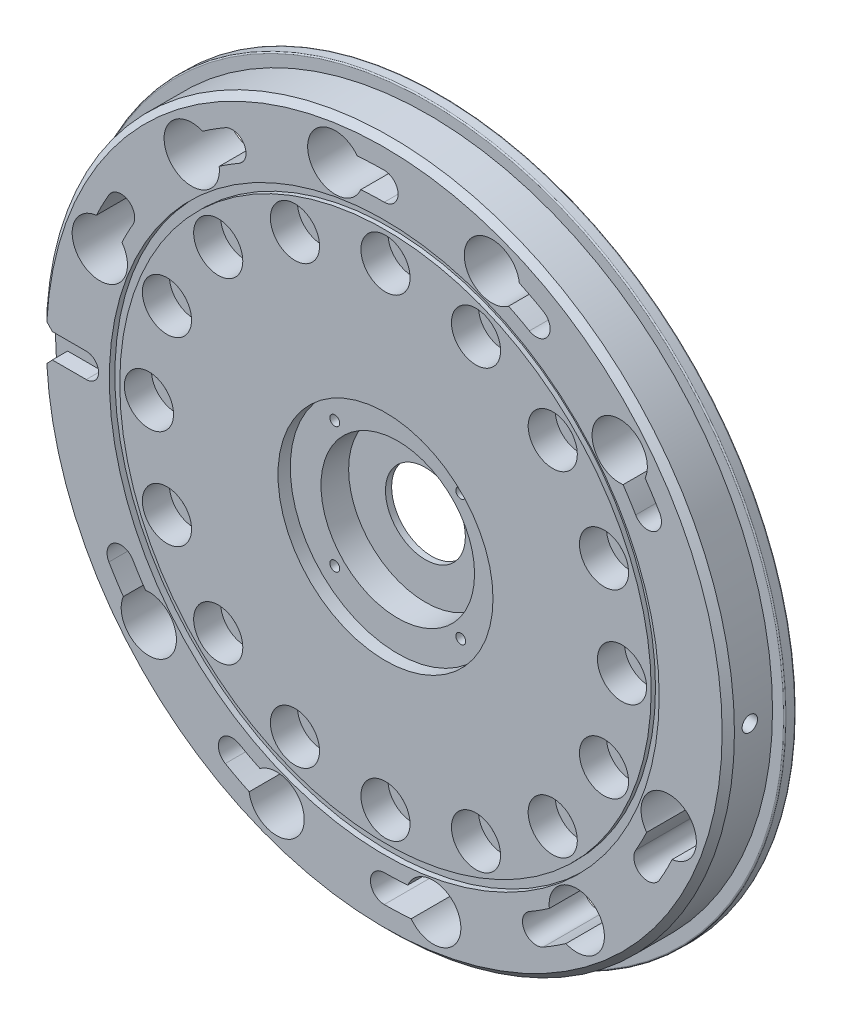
ISO-10303-21;
HEADER;
FILE_DESCRIPTION(('STEP AP214'),'2;1');
FILE_NAME('part.step','',(''),(''),'','','');
FILE_SCHEMA(('AUTOMOTIVE_DESIGN { 1 0 10303 214 1 1 1 1 }'));
ENDSEC;
DATA;
#1=APPLICATION_CONTEXT('core data for automotive mechanical design processes');
#2=APPLICATION_PROTOCOL_DEFINITION('international standard','automotive_design',2000,#1);
#3=PRODUCT_CONTEXT('',#1,'mechanical');
#4=PRODUCT('Part','Part','',(#3));
#5=PRODUCT_RELATED_PRODUCT_CATEGORY('part','',(#4));
#6=PRODUCT_DEFINITION_FORMATION('','',#4);
#7=PRODUCT_DEFINITION_CONTEXT('part definition',#1,'design');
#8=PRODUCT_DEFINITION('design','',#6,#7);
#9=PRODUCT_DEFINITION_SHAPE('','',#8);
#10=(LENGTH_UNIT() NAMED_UNIT(*) SI_UNIT(.MILLI.,.METRE.));
#11=(NAMED_UNIT(*) PLANE_ANGLE_UNIT() SI_UNIT($,.RADIAN.));
#12=(NAMED_UNIT(*) SI_UNIT($,.STERADIAN.) SOLID_ANGLE_UNIT());
#13=UNCERTAINTY_MEASURE_WITH_UNIT(LENGTH_MEASURE(1.E-05),#10,'distance_accuracy_value','');
#14=(GEOMETRIC_REPRESENTATION_CONTEXT(3) GLOBAL_UNCERTAINTY_ASSIGNED_CONTEXT((#13)) GLOBAL_UNIT_ASSIGNED_CONTEXT((#10,
#11,#12)) REPRESENTATION_CONTEXT('',''));
#15=CARTESIAN_POINT('',(0.,0.,0.));
#16=DIRECTION('',(0.,0.,1.));
#17=DIRECTION('',(1.,0.,0.));
#18=AXIS2_PLACEMENT_3D('',#15,#16,#17);
#19=CARTESIAN_POINT('',(0.,0.,4.));
#20=DIRECTION('',(0.,0.,-1.));
#21=DIRECTION('',(-1.,0.,0.));
#22=AXIS2_PLACEMENT_3D('',#19,#20,#21);
#23=PLANE('',#22);
#24=CARTESIAN_POINT('',(0.,0.,4.));
#25=DIRECTION('',(0.,0.,-1.));
#26=DIRECTION('',(-1.,0.,0.));
#27=AXIS2_PLACEMENT_3D('',#24,#25,#26);
#28=CIRCLE('',#27,31.441154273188);
#29=CARTESIAN_POINT('',(-31.441154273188,0.,4.));
#30=VERTEX_POINT('',#29);
#31=EDGE_CURVE('E943',#30,#30,#28,.T.);
#32=ORIENTED_EDGE('',*,*,#31,.T.);
#33=EDGE_LOOP('',(#32));
#34=FACE_BOUND('',#33,.T.);
#35=CARTESIAN_POINT('',(0.,0.,4.));
#36=DIRECTION('',(0.,0.,-1.));
#37=DIRECTION('',(-1.,0.,0.));
#38=AXIS2_PLACEMENT_3D('',#35,#36,#37);
#39=CIRCLE('',#38,17.5);
#40=CARTESIAN_POINT('',(-17.5,0.,4.));
#41=VERTEX_POINT('',#40);
#42=EDGE_CURVE('E404',#41,#41,#39,.T.);
#43=ORIENTED_EDGE('',*,*,#42,.F.);
#44=EDGE_LOOP('',(#43));
#45=FACE_BOUND('',#44,.T.);
#46=ADVANCED_FACE('F46',(#34,#45),#23,.T.);
#47=CARTESIAN_POINT('',(38.5,0.,10.));
#48=DIRECTION('',(0.,0.,1.));
#49=DIRECTION('',(1.,0.,0.));
#50=AXIS2_PLACEMENT_3D('',#47,#48,#49);
#51=CYLINDRICAL_SURFACE('',#50,4.);
#52=CARTESIAN_POINT('',(38.5,0.,5.4));
#53=DIRECTION('',(0.,0.,1.));
#54=DIRECTION('',(1.,0.,0.));
#55=AXIS2_PLACEMENT_3D('',#52,#53,#54);
#56=CIRCLE('',#55,4.);
#57=CARTESIAN_POINT('',(42.5,0.,5.4));
#58=VERTEX_POINT('',#57);
#59=EDGE_CURVE('E920',#58,#58,#56,.T.);
#60=ORIENTED_EDGE('',*,*,#59,.F.);
#61=EDGE_LOOP('',(#60));
#62=FACE_BOUND('',#61,.T.);
#63=CARTESIAN_POINT('',(38.5,0.,9.8));
#64=DIRECTION('',(0.,0.,1.));
#65=DIRECTION('',(1.,0.,0.));
#66=AXIS2_PLACEMENT_3D('',#63,#64,#65);
#67=CIRCLE('',#66,4.);
#68=CARTESIAN_POINT('',(42.5,0.,9.8));
#69=VERTEX_POINT('',#68);
#70=EDGE_CURVE('E474',#69,#69,#67,.F.);
#71=ORIENTED_EDGE('',*,*,#70,.F.);
#72=EDGE_LOOP('',(#71));
#73=FACE_BOUND('',#72,.T.);
#74=ADVANCED_FACE('F1052',(#62,#73),#51,.F.);
#75=CARTESIAN_POINT('',(35.5693620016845,-14.733312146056,10.));
#76=DIRECTION('',(0.,0.,1.));
#77=DIRECTION('',(1.,0.,0.));
#78=AXIS2_PLACEMENT_3D('',#75,#76,#77);
#79=CYLINDRICAL_SURFACE('',#78,3.99999999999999);
#80=CARTESIAN_POINT('',(35.5693620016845,-14.733312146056,5.4));
#81=DIRECTION('',(0.,0.,1.));
#82=DIRECTION('',(1.,0.,0.));
#83=AXIS2_PLACEMENT_3D('',#80,#81,#82);
#84=CIRCLE('',#83,4.);
#85=CARTESIAN_POINT('',(39.5693620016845,-14.733312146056,5.4));
#86=VERTEX_POINT('',#85);
#87=EDGE_CURVE('E913',#86,#86,#84,.T.);
#88=ORIENTED_EDGE('',*,*,#87,.F.);
#89=EDGE_LOOP('',(#88));
#90=FACE_BOUND('',#89,.T.);
#91=CARTESIAN_POINT('',(35.5693620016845,-14.733312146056,9.8));
#92=DIRECTION('',(0.,0.,1.));
#93=DIRECTION('',(1.,0.,0.));
#94=AXIS2_PLACEMENT_3D('',#91,#92,#93);
#95=CIRCLE('',#94,3.99999999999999);
#96=CARTESIAN_POINT('',(39.5693620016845,-14.733312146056,9.8));
#97=VERTEX_POINT('',#96);
#98=EDGE_CURVE('E471',#97,#97,#95,.F.);
#99=ORIENTED_EDGE('',*,*,#98,.F.);
#100=EDGE_LOOP('',(#99));
#101=FACE_BOUND('',#100,.T.);
#102=ADVANCED_FACE('F1058',(#90,#101),#79,.F.);
#103=CARTESIAN_POINT('',(27.223611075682,-27.2236110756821,10.));
#104=DIRECTION('',(0.,0.,1.));
#105=DIRECTION('',(1.,0.,0.));
#106=AXIS2_PLACEMENT_3D('',#103,#104,#105);
#107=CYLINDRICAL_SURFACE('',#106,3.99999999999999);
#108=CARTESIAN_POINT('',(27.223611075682,-27.2236110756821,5.4));
#109=DIRECTION('',(0.,0.,1.));
#110=DIRECTION('',(1.,0.,0.));
#111=AXIS2_PLACEMENT_3D('',#108,#109,#110);
#112=CIRCLE('',#111,4.);
#113=CARTESIAN_POINT('',(31.223611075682,-27.2236110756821,5.4));
#114=VERTEX_POINT('',#113);
#115=EDGE_CURVE('E906',#114,#114,#112,.T.);
#116=ORIENTED_EDGE('',*,*,#115,.F.);
#117=EDGE_LOOP('',(#116));
#118=FACE_BOUND('',#117,.T.);
#119=CARTESIAN_POINT('',(27.223611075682,-27.2236110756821,9.8));
#120=DIRECTION('',(0.,0.,1.));
#121=DIRECTION('',(1.,0.,0.));
#122=AXIS2_PLACEMENT_3D('',#119,#120,#121);
#123=CIRCLE('',#122,3.99999999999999);
#124=CARTESIAN_POINT('',(31.223611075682,-27.2236110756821,9.8));
#125=VERTEX_POINT('',#124);
#126=EDGE_CURVE('E468',#125,#125,#123,.F.);
#127=ORIENTED_EDGE('',*,*,#126,.F.);
#128=EDGE_LOOP('',(#127));
#129=FACE_BOUND('',#128,.T.);
#130=ADVANCED_FACE('F2021',(#118,#129),#107,.F.);
#131=CARTESIAN_POINT('',(14.7333121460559,-35.5693620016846,10.));
#132=DIRECTION('',(0.,0.,1.));
#133=DIRECTION('',(1.,0.,0.));
#134=AXIS2_PLACEMENT_3D('',#131,#132,#133);
#135=CYLINDRICAL_SURFACE('',#134,3.99999999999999);
#136=CARTESIAN_POINT('',(14.7333121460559,-35.5693620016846,5.4));
#137=DIRECTION('',(0.,0.,1.));
#138=DIRECTION('',(1.,0.,0.));
#139=AXIS2_PLACEMENT_3D('',#136,#137,#138);
#140=CIRCLE('',#139,3.99999999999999);
#141=CARTESIAN_POINT('',(18.7333121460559,-35.5693620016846,5.4));
#142=VERTEX_POINT('',#141);
#143=EDGE_CURVE('E899',#142,#142,#140,.T.);
#144=ORIENTED_EDGE('',*,*,#143,.F.);
#145=EDGE_LOOP('',(#144));
#146=FACE_BOUND('',#145,.T.);
#147=CARTESIAN_POINT('',(14.7333121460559,-35.5693620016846,9.8));
#148=DIRECTION('',(0.,0.,1.));
#149=DIRECTION('',(1.,0.,0.));
#150=AXIS2_PLACEMENT_3D('',#147,#148,#149);
#151=CIRCLE('',#150,3.99999999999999);
#152=CARTESIAN_POINT('',(18.7333121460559,-35.5693620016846,9.8));
#153=VERTEX_POINT('',#152);
#154=EDGE_CURVE('E465',#153,#153,#151,.F.);
#155=ORIENTED_EDGE('',*,*,#154,.F.);
#156=EDGE_LOOP('',(#155));
#157=FACE_BOUND('',#156,.T.);
#158=ADVANCED_FACE('F2011',(#146,#157),#135,.F.);
#159=CARTESIAN_POINT('',(-1.34422031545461E-13,-38.5,10.));
#160=DIRECTION('',(0.,0.,1.));
#161=DIRECTION('',(1.,0.,0.));
#162=AXIS2_PLACEMENT_3D('',#159,#160,#161);
#163=CYLINDRICAL_SURFACE('',#162,3.99999999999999);
#164=CARTESIAN_POINT('',(-1.34422031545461E-13,-38.5,5.4));
#165=DIRECTION('',(0.,0.,1.));
#166=DIRECTION('',(1.,0.,0.));
#167=AXIS2_PLACEMENT_3D('',#164,#165,#166);
#168=CIRCLE('',#167,4.);
#169=CARTESIAN_POINT('',(3.99999999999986,-38.5,5.4));
#170=VERTEX_POINT('',#169);
#171=EDGE_CURVE('E892',#170,#170,#168,.T.);
#172=ORIENTED_EDGE('',*,*,#171,.F.);
#173=EDGE_LOOP('',(#172));
#174=FACE_BOUND('',#173,.T.);
#175=CARTESIAN_POINT('',(-1.34422031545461E-13,-38.5,9.8));
#176=DIRECTION('',(0.,0.,1.));
#177=DIRECTION('',(1.,0.,0.));
#178=AXIS2_PLACEMENT_3D('',#175,#176,#177);
#179=CIRCLE('',#178,3.99999999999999);
#180=CARTESIAN_POINT('',(3.99999999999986,-38.5,9.8));
#181=VERTEX_POINT('',#180);
#182=EDGE_CURVE('E462',#181,#181,#179,.F.);
#183=ORIENTED_EDGE('',*,*,#182,.F.);
#184=EDGE_LOOP('',(#183));
#185=FACE_BOUND('',#184,.T.);
#186=ADVANCED_FACE('F2001',(#174,#185),#163,.F.);
#187=CARTESIAN_POINT('',(-14.7333121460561,-35.5693620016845,10.));
#188=DIRECTION('',(0.,0.,1.));
#189=DIRECTION('',(1.,0.,0.));
#190=AXIS2_PLACEMENT_3D('',#187,#188,#189);
#191=CYLINDRICAL_SURFACE('',#190,3.99999999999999);
#192=CARTESIAN_POINT('',(-14.7333121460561,-35.5693620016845,5.4));
#193=DIRECTION('',(0.,0.,1.));
#194=DIRECTION('',(1.,0.,0.));
#195=AXIS2_PLACEMENT_3D('',#192,#193,#194);
#196=CIRCLE('',#195,4.);
#197=CARTESIAN_POINT('',(-10.7333121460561,-35.5693620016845,5.4));
#198=VERTEX_POINT('',#197);
#199=EDGE_CURVE('E885',#198,#198,#196,.T.);
#200=ORIENTED_EDGE('',*,*,#199,.F.);
#201=EDGE_LOOP('',(#200));
#202=FACE_BOUND('',#201,.T.);
#203=CARTESIAN_POINT('',(-14.7333121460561,-35.5693620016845,9.8));
#204=DIRECTION('',(0.,0.,1.));
#205=DIRECTION('',(1.,0.,0.));
#206=AXIS2_PLACEMENT_3D('',#203,#204,#205);
#207=CIRCLE('',#206,3.99999999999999);
#208=CARTESIAN_POINT('',(-10.7333121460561,-35.5693620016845,9.8));
#209=VERTEX_POINT('',#208);
#210=EDGE_CURVE('E459',#209,#209,#207,.F.);
#211=ORIENTED_EDGE('',*,*,#210,.F.);
#212=EDGE_LOOP('',(#211));
#213=FACE_BOUND('',#212,.T.);
#214=ADVANCED_FACE('F1991',(#202,#213),#191,.F.);
#215=CARTESIAN_POINT('',(-27.2236110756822,-27.2236110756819,10.));
#216=DIRECTION('',(0.,0.,1.));
#217=DIRECTION('',(1.,0.,0.));
#218=AXIS2_PLACEMENT_3D('',#215,#216,#217);
#219=CYLINDRICAL_SURFACE('',#218,3.99999999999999);
#220=CARTESIAN_POINT('',(-27.2236110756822,-27.2236110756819,5.4));
#221=DIRECTION('',(0.,0.,1.));
#222=DIRECTION('',(1.,0.,0.));
#223=AXIS2_PLACEMENT_3D('',#220,#221,#222);
#224=CIRCLE('',#223,4.);
#225=CARTESIAN_POINT('',(-23.2236110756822,-27.2236110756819,5.4));
#226=VERTEX_POINT('',#225);
#227=EDGE_CURVE('E878',#226,#226,#224,.T.);
#228=ORIENTED_EDGE('',*,*,#227,.F.);
#229=EDGE_LOOP('',(#228));
#230=FACE_BOUND('',#229,.T.);
#231=CARTESIAN_POINT('',(-27.2236110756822,-27.2236110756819,9.8));
#232=DIRECTION('',(0.,0.,1.));
#233=DIRECTION('',(1.,0.,0.));
#234=AXIS2_PLACEMENT_3D('',#231,#232,#233);
#235=CIRCLE('',#234,3.99999999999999);
#236=CARTESIAN_POINT('',(-23.2236110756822,-27.2236110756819,9.8));
#237=VERTEX_POINT('',#236);
#238=EDGE_CURVE('E456',#237,#237,#235,.F.);
#239=ORIENTED_EDGE('',*,*,#238,.F.);
#240=EDGE_LOOP('',(#239));
#241=FACE_BOUND('',#240,.T.);
#242=ADVANCED_FACE('F1981',(#230,#241),#219,.F.);
#243=CARTESIAN_POINT('',(-35.5693620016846,-14.7333121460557,10.));
#244=DIRECTION('',(0.,0.,1.));
#245=DIRECTION('',(1.,0.,0.));
#246=AXIS2_PLACEMENT_3D('',#243,#244,#245);
#247=CYLINDRICAL_SURFACE('',#246,3.99999999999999);
#248=CARTESIAN_POINT('',(-35.5693620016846,-14.7333121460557,5.4));
#249=DIRECTION('',(0.,0.,1.));
#250=DIRECTION('',(1.,0.,0.));
#251=AXIS2_PLACEMENT_3D('',#248,#249,#250);
#252=CIRCLE('',#251,4.);
#253=CARTESIAN_POINT('',(-31.5693620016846,-14.7333121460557,5.4));
#254=VERTEX_POINT('',#253);
#255=EDGE_CURVE('E871',#254,#254,#252,.T.);
#256=ORIENTED_EDGE('',*,*,#255,.F.);
#257=EDGE_LOOP('',(#256));
#258=FACE_BOUND('',#257,.T.);
#259=CARTESIAN_POINT('',(-35.5693620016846,-14.7333121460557,9.8));
#260=DIRECTION('',(0.,0.,1.));
#261=DIRECTION('',(1.,0.,0.));
#262=AXIS2_PLACEMENT_3D('',#259,#260,#261);
#263=CIRCLE('',#262,3.99999999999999);
#264=CARTESIAN_POINT('',(-31.5693620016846,-14.7333121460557,9.8));
#265=VERTEX_POINT('',#264);
#266=EDGE_CURVE('E453',#265,#265,#263,.F.);
#267=ORIENTED_EDGE('',*,*,#266,.F.);
#268=EDGE_LOOP('',(#267));
#269=FACE_BOUND('',#268,.T.);
#270=ADVANCED_FACE('F1971',(#258,#269),#247,.F.);
#271=CARTESIAN_POINT('',(-38.5,0.,10.));
#272=DIRECTION('',(0.,0.,1.));
#273=DIRECTION('',(1.,0.,0.));
#274=AXIS2_PLACEMENT_3D('',#271,#272,#273);
#275=CYLINDRICAL_SURFACE('',#274,4.);
#276=CARTESIAN_POINT('',(-38.5,0.,5.4));
#277=DIRECTION('',(0.,0.,1.));
#278=DIRECTION('',(1.,0.,0.));
#279=AXIS2_PLACEMENT_3D('',#276,#277,#278);
#280=CIRCLE('',#279,4.);
#281=CARTESIAN_POINT('',(-34.5,0.,5.4));
#282=VERTEX_POINT('',#281);
#283=EDGE_CURVE('E864',#282,#282,#280,.T.);
#284=ORIENTED_EDGE('',*,*,#283,.F.);
#285=EDGE_LOOP('',(#284));
#286=FACE_BOUND('',#285,.T.);
#287=CARTESIAN_POINT('',(-38.5,0.,9.8));
#288=DIRECTION('',(0.,0.,1.));
#289=DIRECTION('',(1.,0.,0.));
#290=AXIS2_PLACEMENT_3D('',#287,#288,#289);
#291=CIRCLE('',#290,4.);
#292=CARTESIAN_POINT('',(-34.5,0.,9.8));
#293=VERTEX_POINT('',#292);
#294=EDGE_CURVE('E450',#293,#293,#291,.F.);
#295=ORIENTED_EDGE('',*,*,#294,.F.);
#296=EDGE_LOOP('',(#295));
#297=FACE_BOUND('',#296,.T.);
#298=ADVANCED_FACE('F1961',(#286,#297),#275,.F.);
#299=CARTESIAN_POINT('',(-35.5693620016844,14.7333121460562,10.));
#300=DIRECTION('',(0.,0.,1.));
#301=DIRECTION('',(1.,0.,0.));
#302=AXIS2_PLACEMENT_3D('',#299,#300,#301);
#303=CYLINDRICAL_SURFACE('',#302,3.99999999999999);
#304=CARTESIAN_POINT('',(-35.5693620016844,14.7333121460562,5.4));
#305=DIRECTION('',(0.,0.,1.));
#306=DIRECTION('',(1.,0.,0.));
#307=AXIS2_PLACEMENT_3D('',#304,#305,#306);
#308=CIRCLE('',#307,4.);
#309=CARTESIAN_POINT('',(-31.5693620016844,14.7333121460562,5.4));
#310=VERTEX_POINT('',#309);
#311=EDGE_CURVE('E857',#310,#310,#308,.T.);
#312=ORIENTED_EDGE('',*,*,#311,.F.);
#313=EDGE_LOOP('',(#312));
#314=FACE_BOUND('',#313,.T.);
#315=CARTESIAN_POINT('',(-35.5693620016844,14.7333121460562,9.8));
#316=DIRECTION('',(0.,0.,1.));
#317=DIRECTION('',(1.,0.,0.));
#318=AXIS2_PLACEMENT_3D('',#315,#316,#317);
#319=CIRCLE('',#318,3.99999999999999);
#320=CARTESIAN_POINT('',(-31.5693620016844,14.7333121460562,9.8));
#321=VERTEX_POINT('',#320);
#322=EDGE_CURVE('E447',#321,#321,#319,.F.);
#323=ORIENTED_EDGE('',*,*,#322,.F.);
#324=EDGE_LOOP('',(#323));
#325=FACE_BOUND('',#324,.T.);
#326=ADVANCED_FACE('F1951',(#314,#325),#303,.F.);
#327=CARTESIAN_POINT('',(-27.2236110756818,27.2236110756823,10.));
#328=DIRECTION('',(0.,0.,1.));
#329=DIRECTION('',(1.,0.,0.));
#330=AXIS2_PLACEMENT_3D('',#327,#328,#329);
#331=CYLINDRICAL_SURFACE('',#330,3.99999999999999);
#332=CARTESIAN_POINT('',(-27.2236110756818,27.2236110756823,5.4));
#333=DIRECTION('',(0.,0.,1.));
#334=DIRECTION('',(1.,0.,0.));
#335=AXIS2_PLACEMENT_3D('',#332,#333,#334);
#336=CIRCLE('',#335,4.);
#337=CARTESIAN_POINT('',(-23.2236110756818,27.2236110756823,5.4));
#338=VERTEX_POINT('',#337);
#339=EDGE_CURVE('E850',#338,#338,#336,.T.);
#340=ORIENTED_EDGE('',*,*,#339,.F.);
#341=EDGE_LOOP('',(#340));
#342=FACE_BOUND('',#341,.T.);
#343=CARTESIAN_POINT('',(-27.2236110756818,27.2236110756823,9.8));
#344=DIRECTION('',(0.,0.,1.));
#345=DIRECTION('',(1.,0.,0.));
#346=AXIS2_PLACEMENT_3D('',#343,#344,#345);
#347=CIRCLE('',#346,3.99999999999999);
#348=CARTESIAN_POINT('',(-23.2236110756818,27.2236110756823,9.8));
#349=VERTEX_POINT('',#348);
#350=EDGE_CURVE('E444',#349,#349,#347,.F.);
#351=ORIENTED_EDGE('',*,*,#350,.F.);
#352=EDGE_LOOP('',(#351));
#353=FACE_BOUND('',#352,.T.);
#354=ADVANCED_FACE('F1941',(#342,#353),#331,.F.);
#355=CARTESIAN_POINT('',(-14.7333121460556,35.5693620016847,10.));
#356=DIRECTION('',(0.,0.,1.));
#357=DIRECTION('',(1.,0.,0.));
#358=AXIS2_PLACEMENT_3D('',#355,#356,#357);
#359=CYLINDRICAL_SURFACE('',#358,3.99999999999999);
#360=CARTESIAN_POINT('',(-14.7333121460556,35.5693620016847,5.4));
#361=DIRECTION('',(0.,0.,1.));
#362=DIRECTION('',(1.,0.,0.));
#363=AXIS2_PLACEMENT_3D('',#360,#361,#362);
#364=CIRCLE('',#363,4.);
#365=CARTESIAN_POINT('',(-10.7333121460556,35.5693620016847,5.4));
#366=VERTEX_POINT('',#365);
#367=EDGE_CURVE('E843',#366,#366,#364,.T.);
#368=ORIENTED_EDGE('',*,*,#367,.F.);
#369=EDGE_LOOP('',(#368));
#370=FACE_BOUND('',#369,.T.);
#371=CARTESIAN_POINT('',(-14.7333121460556,35.5693620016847,9.8));
#372=DIRECTION('',(0.,0.,1.));
#373=DIRECTION('',(1.,0.,0.));
#374=AXIS2_PLACEMENT_3D('',#371,#372,#373);
#375=CIRCLE('',#374,3.99999999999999);
#376=CARTESIAN_POINT('',(-10.7333121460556,35.5693620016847,9.8));
#377=VERTEX_POINT('',#376);
#378=EDGE_CURVE('E441',#377,#377,#375,.F.);
#379=ORIENTED_EDGE('',*,*,#378,.F.);
#380=EDGE_LOOP('',(#379));
#381=FACE_BOUND('',#380,.T.);
#382=ADVANCED_FACE('F1931',(#370,#381),#359,.F.);
#383=CARTESIAN_POINT('',(4.03266094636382E-13,38.5,10.));
#384=DIRECTION('',(0.,0.,1.));
#385=DIRECTION('',(1.,0.,0.));
#386=AXIS2_PLACEMENT_3D('',#383,#384,#385);
#387=CYLINDRICAL_SURFACE('',#386,3.99999999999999);
#388=CARTESIAN_POINT('',(4.03266094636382E-13,38.5,5.4));
#389=DIRECTION('',(0.,0.,1.));
#390=DIRECTION('',(1.,0.,0.));
#391=AXIS2_PLACEMENT_3D('',#388,#389,#390);
#392=CIRCLE('',#391,4.);
#393=CARTESIAN_POINT('',(4.0000000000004,38.5,5.4));
#394=VERTEX_POINT('',#393);
#395=EDGE_CURVE('E836',#394,#394,#392,.T.);
#396=ORIENTED_EDGE('',*,*,#395,.F.);
#397=EDGE_LOOP('',(#396));
#398=FACE_BOUND('',#397,.T.);
#399=CARTESIAN_POINT('',(4.03266094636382E-13,38.5,9.8));
#400=DIRECTION('',(0.,0.,1.));
#401=DIRECTION('',(1.,0.,0.));
#402=AXIS2_PLACEMENT_3D('',#399,#400,#401);
#403=CIRCLE('',#402,3.99999999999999);
#404=CARTESIAN_POINT('',(4.0000000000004,38.5,9.8));
#405=VERTEX_POINT('',#404);
#406=EDGE_CURVE('E438',#405,#405,#403,.F.);
#407=ORIENTED_EDGE('',*,*,#406,.F.);
#408=EDGE_LOOP('',(#407));
#409=FACE_BOUND('',#408,.T.);
#410=ADVANCED_FACE('F1921',(#398,#409),#387,.F.);
#411=CARTESIAN_POINT('',(14.7333121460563,35.5693620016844,10.));
#412=DIRECTION('',(0.,0.,1.));
#413=DIRECTION('',(1.,0.,0.));
#414=AXIS2_PLACEMENT_3D('',#411,#412,#413);
#415=CYLINDRICAL_SURFACE('',#414,3.99999999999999);
#416=CARTESIAN_POINT('',(14.7333121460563,35.5693620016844,5.4));
#417=DIRECTION('',(0.,0.,1.));
#418=DIRECTION('',(1.,0.,0.));
#419=AXIS2_PLACEMENT_3D('',#416,#417,#418);
#420=CIRCLE('',#419,4.);
#421=CARTESIAN_POINT('',(18.7333121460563,35.5693620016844,5.4));
#422=VERTEX_POINT('',#421);
#423=EDGE_CURVE('E829',#422,#422,#420,.T.);
#424=ORIENTED_EDGE('',*,*,#423,.F.);
#425=EDGE_LOOP('',(#424));
#426=FACE_BOUND('',#425,.T.);
#427=CARTESIAN_POINT('',(14.7333121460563,35.5693620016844,9.8));
#428=DIRECTION('',(0.,0.,1.));
#429=DIRECTION('',(1.,0.,0.));
#430=AXIS2_PLACEMENT_3D('',#427,#428,#429);
#431=CIRCLE('',#430,3.99999999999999);
#432=CARTESIAN_POINT('',(18.7333121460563,35.5693620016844,9.8));
#433=VERTEX_POINT('',#432);
#434=EDGE_CURVE('E435',#433,#433,#431,.F.);
#435=ORIENTED_EDGE('',*,*,#434,.F.);
#436=EDGE_LOOP('',(#435));
#437=FACE_BOUND('',#436,.T.);
#438=ADVANCED_FACE('F1911',(#426,#437),#415,.F.);
#439=CARTESIAN_POINT('',(27.2236110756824,27.2236110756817,10.));
#440=DIRECTION('',(0.,0.,1.));
#441=DIRECTION('',(1.,0.,0.));
#442=AXIS2_PLACEMENT_3D('',#439,#440,#441);
#443=CYLINDRICAL_SURFACE('',#442,3.99999999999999);
#444=CARTESIAN_POINT('',(27.2236110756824,27.2236110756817,5.4));
#445=DIRECTION('',(0.,0.,1.));
#446=DIRECTION('',(1.,0.,0.));
#447=AXIS2_PLACEMENT_3D('',#444,#445,#446);
#448=CIRCLE('',#447,4.);
#449=CARTESIAN_POINT('',(31.2236110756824,27.2236110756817,5.4));
#450=VERTEX_POINT('',#449);
#451=EDGE_CURVE('E822',#450,#450,#448,.T.);
#452=ORIENTED_EDGE('',*,*,#451,.F.);
#453=EDGE_LOOP('',(#452));
#454=FACE_BOUND('',#453,.T.);
#455=CARTESIAN_POINT('',(27.2236110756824,27.2236110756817,9.8));
#456=DIRECTION('',(0.,0.,1.));
#457=DIRECTION('',(1.,0.,0.));
#458=AXIS2_PLACEMENT_3D('',#455,#456,#457);
#459=CIRCLE('',#458,3.99999999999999);
#460=CARTESIAN_POINT('',(31.2236110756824,27.2236110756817,9.8));
#461=VERTEX_POINT('',#460);
#462=EDGE_CURVE('E432',#461,#461,#459,.F.);
#463=ORIENTED_EDGE('',*,*,#462,.F.);
#464=EDGE_LOOP('',(#463));
#465=FACE_BOUND('',#464,.T.);
#466=ADVANCED_FACE('F1902',(#454,#465),#443,.F.);
#467=CARTESIAN_POINT('',(35.5693620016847,14.7333121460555,10.));
#468=DIRECTION('',(0.,0.,1.));
#469=DIRECTION('',(1.,0.,0.));
#470=AXIS2_PLACEMENT_3D('',#467,#468,#469);
#471=CYLINDRICAL_SURFACE('',#470,3.99999999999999);
#472=CARTESIAN_POINT('',(35.5693620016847,14.7333121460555,5.4));
#473=DIRECTION('',(0.,0.,1.));
#474=DIRECTION('',(1.,0.,0.));
#475=AXIS2_PLACEMENT_3D('',#472,#473,#474);
#476=CIRCLE('',#475,4.);
#477=CARTESIAN_POINT('',(39.5693620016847,14.7333121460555,5.4));
#478=VERTEX_POINT('',#477);
#479=EDGE_CURVE('E815',#478,#478,#476,.T.);
#480=ORIENTED_EDGE('',*,*,#479,.F.);
#481=EDGE_LOOP('',(#480));
#482=FACE_BOUND('',#481,.T.);
#483=CARTESIAN_POINT('',(35.5693620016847,14.7333121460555,9.8));
#484=DIRECTION('',(0.,0.,1.));
#485=DIRECTION('',(1.,0.,0.));
#486=AXIS2_PLACEMENT_3D('',#483,#484,#485);
#487=CIRCLE('',#486,3.99999999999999);
#488=CARTESIAN_POINT('',(39.5693620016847,14.7333121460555,9.8));
#489=VERTEX_POINT('',#488);
#490=EDGE_CURVE('E429',#489,#489,#487,.F.);
#491=ORIENTED_EDGE('',*,*,#490,.F.);
#492=EDGE_LOOP('',(#491));
#493=FACE_BOUND('',#492,.T.);
#494=ADVANCED_FACE('F1199',(#482,#493),#471,.F.);
#495=CARTESIAN_POINT('',(0.,0.,9.1));
#496=DIRECTION('',(0.,0.,1.));
#497=DIRECTION('',(1.,0.,0.));
#498=AXIS2_PLACEMENT_3D('',#495,#496,#497);
#499=CYLINDRICAL_SURFACE('',#498,43.25);
#500=CARTESIAN_POINT('',(0.,0.,9.1));
#501=DIRECTION('',(0.,0.,1.));
#502=DIRECTION('',(1.,0.,0.));
#503=AXIS2_PLACEMENT_3D('',#500,#501,#502);
#504=CIRCLE('',#503,43.25);
#505=CARTESIAN_POINT('',(43.25,0.,9.1));
#506=VERTEX_POINT('',#505);
#507=EDGE_CURVE('E477',#506,#506,#504,.T.);
#508=ORIENTED_EDGE('',*,*,#507,.T.);
#509=EDGE_LOOP('',(#508));
#510=FACE_BOUND('',#509,.T.);
#511=CARTESIAN_POINT('',(0.,0.,9.8));
#512=DIRECTION('',(0.,0.,1.));
#513=DIRECTION('',(1.,0.,0.));
#514=AXIS2_PLACEMENT_3D('',#511,#512,#513);
#515=CIRCLE('',#514,43.25);
#516=CARTESIAN_POINT('',(43.25,0.,9.8));
#517=VERTEX_POINT('',#516);
#518=EDGE_CURVE('E422',#517,#517,#515,.T.);
#519=ORIENTED_EDGE('',*,*,#518,.F.);
#520=EDGE_LOOP('',(#519));
#521=FACE_BOUND('',#520,.T.);
#522=ADVANCED_FACE('F1085',(#510,#521),#499,.T.);
#523=CARTESIAN_POINT('',(0.,0.,10.));
#524=DIRECTION('',(0.,0.,-1.));
#525=DIRECTION('',(-1.,0.,0.));
#526=AXIS2_PLACEMENT_3D('',#523,#524,#525);
#527=CYLINDRICAL_SURFACE('',#526,58.);
#528=CARTESIAN_POINT('',(0.,0.,1.2));
#529=DIRECTION('',(0.,0.,-1.));
#530=DIRECTION('',(-1.,0.,0.));
#531=AXIS2_PLACEMENT_3D('',#528,#529,#530);
#532=CIRCLE('',#531,58.);
#533=CARTESIAN_POINT('',(-58.,0.,1.2));
#534=VERTEX_POINT('',#533);
#535=EDGE_CURVE('E54',#534,#534,#532,.F.);
#536=ORIENTED_EDGE('',*,*,#535,.T.);
#537=EDGE_LOOP('',(#536));
#538=FACE_BOUND('',#537,.T.);
#539=CARTESIAN_POINT('',(0.,0.,2.6));
#540=DIRECTION('',(0.,0.,1.));
#541=DIRECTION('',(1.,0.,0.));
#542=AXIS2_PLACEMENT_3D('',#539,#540,#541);
#543=CIRCLE('',#542,58.);
#544=CARTESIAN_POINT('',(58.,0.,2.6));
#545=VERTEX_POINT('',#544);
#546=EDGE_CURVE('E2921',#545,#545,#543,.F.);
#547=ORIENTED_EDGE('',*,*,#546,.T.);
#548=EDGE_LOOP('',(#547));
#549=FACE_BOUND('',#548,.T.);
#550=ADVANCED_FACE('F1082',(#538,#549),#527,.T.);
#551=CARTESIAN_POINT('',(0.,0.,0.));
#552=DIRECTION('',(0.,0.,1.));
#553=DIRECTION('',(1.,0.,0.));
#554=AXIS2_PLACEMENT_3D('',#551,#552,#553);
#555=PLANE('',#554);
#556=CARTESIAN_POINT('',(-24.7499999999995,42.86825748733,0.));
#557=DIRECTION('',(0.,0.,1.));
#558=DIRECTION('',(0.866025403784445,0.499999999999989,0.));
#559=AXIS2_PLACEMENT_3D('',#556,#557,#558);
#560=CIRCLE('',#559,2.25);
#561=CARTESIAN_POINT('',(-23.6249999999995,40.919700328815,0.));
#562=VERTEX_POINT('',#561);
#563=CARTESIAN_POINT('',(-25.8749999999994,44.816814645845,0.));
#564=VERTEX_POINT('',#563);
#565=EDGE_CURVE('E497',#562,#564,#560,.T.);
#566=ORIENTED_EDGE('',*,*,#565,.T.);
#567=CARTESIAN_POINT('',(0.,0.,0.));
#568=DIRECTION('',(0.,0.,1.));
#569=DIRECTION('',(0.866025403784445,0.499999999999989,0.));
#570=AXIS2_PLACEMENT_3D('',#567,#568,#569);
#571=CIRCLE('',#570,51.75);
#572=CARTESIAN_POINT('',(-29.5768508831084,42.4649548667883,0.));
#573=VERTEX_POINT('',#572);
#574=EDGE_CURVE('E487',#564,#573,#571,.T.);
#575=ORIENTED_EDGE('',*,*,#574,.T.);
#576=CARTESIAN_POINT('',(-31.3323134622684,38.3214839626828,0.));
#577=DIRECTION('',(0.,0.,1.));
#578=DIRECTION('',(0.866025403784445,0.499999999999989,0.));
#579=AXIS2_PLACEMENT_3D('',#576,#577,#578);
#580=CIRCLE('',#579,4.5);
#581=CARTESIAN_POINT('',(-26.8657386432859,38.8689411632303,0.));
#582=VERTEX_POINT('',#581);
#583=EDGE_CURVE('E490',#573,#582,#580,.T.);
#584=ORIENTED_EDGE('',*,*,#583,.T.);
#585=CARTESIAN_POINT('',(0.,0.,0.));
#586=DIRECTION('',(0.,0.,-1.));
#587=DIRECTION('',(0.866025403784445,0.499999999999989,0.));
#588=AXIS2_PLACEMENT_3D('',#585,#586,#587);
#589=CIRCLE('',#588,47.25);
#590=EDGE_CURVE('E494',#582,#562,#589,.T.);
#591=ORIENTED_EDGE('',*,*,#590,.T.);
#592=EDGE_LOOP('',(#566,#575,#584,#591));
#593=FACE_BOUND('',#592,.T.);
#594=CARTESIAN_POINT('',(-42.8682574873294,24.7500000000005,0.));
#595=DIRECTION('',(0.,0.,1.));
#596=DIRECTION('',(0.50000000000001,0.866025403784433,0.));
#597=AXIS2_PLACEMENT_3D('',#594,#595,#596);
#598=CIRCLE('',#597,2.25);
#599=CARTESIAN_POINT('',(-40.9197003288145,23.6250000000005,0.));
#600=VERTEX_POINT('',#599);
#601=CARTESIAN_POINT('',(-44.8168146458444,25.8750000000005,0.));
#602=VERTEX_POINT('',#601);
#603=EDGE_CURVE('E529',#600,#602,#598,.T.);
#604=ORIENTED_EDGE('',*,*,#603,.T.);
#605=CARTESIAN_POINT('',(0.,0.,0.));
#606=DIRECTION('',(0.,0.,1.));
#607=DIRECTION('',(0.50000000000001,0.866025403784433,0.));
#608=AXIS2_PLACEMENT_3D('',#605,#606,#607);
#609=CIRCLE('',#608,51.75);
#610=CARTESIAN_POINT('',(-46.8467816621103,21.987304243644,0.));
#611=VERTEX_POINT('',#610);
#612=EDGE_CURVE('E519',#602,#611,#609,.T.);
#613=ORIENTED_EDGE('',*,*,#612,.T.);
#614=CARTESIAN_POINT('',(-46.295321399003,17.521221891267,0.));
#615=DIRECTION('',(0.,0.,1.));
#616=DIRECTION('',(0.50000000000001,0.866025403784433,0.));
#617=AXIS2_PLACEMENT_3D('',#614,#615,#616);
#618=CIRCLE('',#617,4.5);
#619=CARTESIAN_POINT('',(-42.700882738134,20.2286211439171,0.));
#620=VERTEX_POINT('',#619);
#621=EDGE_CURVE('E522',#611,#620,#618,.T.);
#622=ORIENTED_EDGE('',*,*,#621,.T.);
#623=CARTESIAN_POINT('',(0.,0.,0.));
#624=DIRECTION('',(0.,0.,-1.));
#625=DIRECTION('',(0.50000000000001,0.866025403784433,0.));
#626=AXIS2_PLACEMENT_3D('',#623,#624,#625);
#627=CIRCLE('',#626,47.25);
#628=EDGE_CURVE('E526',#620,#600,#627,.T.);
#629=ORIENTED_EDGE('',*,*,#628,.T.);
#630=EDGE_LOOP('',(#604,#613,#622,#629));
#631=FACE_BOUND('',#630,.T.);
#632=CARTESIAN_POINT('',(-42.8682574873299,-24.7499999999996,0.));
#633=DIRECTION('',(0.,0.,1.));
#634=DIRECTION('',(-0.499999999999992,0.866025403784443,0.));
#635=AXIS2_PLACEMENT_3D('',#632,#633,#634);
#636=CIRCLE('',#635,2.25);
#637=CARTESIAN_POINT('',(-40.9197003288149,-23.6249999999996,0.));
#638=VERTEX_POINT('',#637);
#639=CARTESIAN_POINT('',(-44.8168146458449,-25.8749999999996,0.));
#640=VERTEX_POINT('',#639);
#641=EDGE_CURVE('E561',#638,#640,#636,.T.);
#642=ORIENTED_EDGE('',*,*,#641,.T.);
#643=CARTESIAN_POINT('',(0.,0.,0.));
#644=DIRECTION('',(0.,0.,1.));
#645=DIRECTION('',(-0.499999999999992,0.866025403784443,0.));
#646=AXIS2_PLACEMENT_3D('',#643,#644,#645);
#647=CIRCLE('',#646,51.75);
#648=CARTESIAN_POINT('',(-42.4649548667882,-29.5768508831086,0.));
#649=VERTEX_POINT('',#648);
#650=EDGE_CURVE('E551',#640,#649,#647,.T.);
#651=ORIENTED_EDGE('',*,*,#650,.T.);
#652=CARTESIAN_POINT('',(-38.3214839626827,-31.3323134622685,0.));
#653=DIRECTION('',(0.,0.,1.));
#654=DIRECTION('',(-0.499999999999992,0.866025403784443,0.));
#655=AXIS2_PLACEMENT_3D('',#652,#653,#654);
#656=CIRCLE('',#655,4.5);
#657=CARTESIAN_POINT('',(-38.8689411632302,-26.865738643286,0.));
#658=VERTEX_POINT('',#657);
#659=EDGE_CURVE('E554',#649,#658,#656,.T.);
#660=ORIENTED_EDGE('',*,*,#659,.T.);
#661=CARTESIAN_POINT('',(0.,0.,0.));
#662=DIRECTION('',(0.,0.,-1.));
#663=DIRECTION('',(-0.499999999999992,0.866025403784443,0.));
#664=AXIS2_PLACEMENT_3D('',#661,#662,#663);
#665=CIRCLE('',#664,47.25);
#666=EDGE_CURVE('E558',#658,#638,#665,.T.);
#667=ORIENTED_EDGE('',*,*,#666,.T.);
#668=EDGE_LOOP('',(#642,#651,#660,#667));
#669=FACE_BOUND('',#668,.T.);
#670=CARTESIAN_POINT('',(-24.7500000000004,-42.8682574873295,0.));
#671=DIRECTION('',(0.,0.,1.));
#672=DIRECTION('',(-0.866025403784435,0.500000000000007,0.));
#673=AXIS2_PLACEMENT_3D('',#670,#671,#672);
#674=CIRCLE('',#673,2.25);
#675=CARTESIAN_POINT('',(-23.6250000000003,-40.9197003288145,0.));
#676=VERTEX_POINT('',#675);
#677=CARTESIAN_POINT('',(-25.8750000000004,-44.8168146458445,0.));
#678=VERTEX_POINT('',#677);
#679=EDGE_CURVE('E593',#676,#678,#674,.T.);
#680=ORIENTED_EDGE('',*,*,#679,.T.);
#681=CARTESIAN_POINT('',(0.,0.,0.));
#682=DIRECTION('',(0.,0.,1.));
#683=DIRECTION('',(-0.866025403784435,0.500000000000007,0.));
#684=AXIS2_PLACEMENT_3D('',#681,#682,#683);
#685=CIRCLE('',#684,51.75);
#686=CARTESIAN_POINT('',(-21.9873042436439,-46.8467816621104,0.));
#687=VERTEX_POINT('',#686);
#688=EDGE_CURVE('E583',#678,#687,#685,.T.);
#689=ORIENTED_EDGE('',*,*,#688,.T.);
#690=CARTESIAN_POINT('',(-17.5212218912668,-46.2953213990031,0.));
#691=DIRECTION('',(0.,0.,1.));
#692=DIRECTION('',(-0.866025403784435,0.500000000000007,0.));
#693=AXIS2_PLACEMENT_3D('',#690,#691,#692);
#694=CIRCLE('',#693,4.5);
#695=CARTESIAN_POINT('',(-20.2286211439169,-42.7008827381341,0.));
#696=VERTEX_POINT('',#695);
#697=EDGE_CURVE('E586',#687,#696,#694,.T.);
#698=ORIENTED_EDGE('',*,*,#697,.T.);
#699=CARTESIAN_POINT('',(0.,0.,0.));
#700=DIRECTION('',(0.,0.,-1.));
#701=DIRECTION('',(-0.866025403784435,0.500000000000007,0.));
#702=AXIS2_PLACEMENT_3D('',#699,#700,#701);
#703=CIRCLE('',#702,47.25);
#704=EDGE_CURVE('E590',#696,#676,#703,.T.);
#705=ORIENTED_EDGE('',*,*,#704,.T.);
#706=EDGE_LOOP('',(#680,#689,#698,#705));
#707=FACE_BOUND('',#706,.T.);
#708=CARTESIAN_POINT('',(0.,-49.5,0.));
#709=DIRECTION('',(0.,0.,1.));
#710=DIRECTION('',(-1.,0.,0.));
#711=AXIS2_PLACEMENT_3D('',#708,#709,#710);
#712=CIRCLE('',#711,2.25);
#713=CARTESIAN_POINT('',(0.,-47.25,0.));
#714=VERTEX_POINT('',#713);
#715=CARTESIAN_POINT('',(0.,-51.75,0.));
#716=VERTEX_POINT('',#715);
#717=EDGE_CURVE('E625',#714,#716,#712,.T.);
#718=ORIENTED_EDGE('',*,*,#717,.T.);
#719=CARTESIAN_POINT('',(0.,0.,0.));
#720=DIRECTION('',(0.,0.,1.));
#721=DIRECTION('',(-1.,0.,0.));
#722=AXIS2_PLACEMENT_3D('',#719,#720,#721);
#723=CIRCLE('',#722,51.75);
#724=CARTESIAN_POINT('',(4.38182679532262,-51.5641551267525,0.));
#725=VERTEX_POINT('',#724);
#726=EDGE_CURVE('E615',#716,#725,#723,.T.);
#727=ORIENTED_EDGE('',*,*,#726,.T.);
#728=CARTESIAN_POINT('',(7.97383743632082,-48.8535353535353,0.));
#729=DIRECTION('',(0.,0.,1.));
#730=DIRECTION('',(-1.,0.,0.));
#731=AXIS2_PLACEMENT_3D('',#728,#729,#730);
#732=CIRCLE('',#731,4.5);
#733=CARTESIAN_POINT('',(3.83194157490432,-47.094359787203,0.));
#734=VERTEX_POINT('',#733);
#735=EDGE_CURVE('E618',#725,#734,#732,.T.);
#736=ORIENTED_EDGE('',*,*,#735,.T.);
#737=CARTESIAN_POINT('',(0.,0.,0.));
#738=DIRECTION('',(0.,0.,-1.));
#739=DIRECTION('',(-1.,0.,0.));
#740=AXIS2_PLACEMENT_3D('',#737,#738,#739);
#741=CIRCLE('',#740,47.25);
#742=EDGE_CURVE('E622',#734,#714,#741,.T.);
#743=ORIENTED_EDGE('',*,*,#742,.T.);
#744=EDGE_LOOP('',(#718,#727,#736,#743));
#745=FACE_BOUND('',#744,.T.);
#746=CARTESIAN_POINT('',(24.7499999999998,-42.8682574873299,0.));
#747=DIRECTION('',(0.,0.,1.));
#748=DIRECTION('',(-0.866025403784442,-0.499999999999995,0.));
#749=AXIS2_PLACEMENT_3D('',#746,#747,#748);
#750=CIRCLE('',#749,2.25);
#751=CARTESIAN_POINT('',(23.6249999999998,-40.9197003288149,0.));
#752=VERTEX_POINT('',#751);
#753=CARTESIAN_POINT('',(25.8749999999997,-44.8168146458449,0.));
#754=VERTEX_POINT('',#753);
#755=EDGE_CURVE('E657',#752,#754,#750,.T.);
#756=ORIENTED_EDGE('',*,*,#755,.T.);
#757=CARTESIAN_POINT('',(0.,0.,0.));
#758=DIRECTION('',(0.,0.,1.));
#759=DIRECTION('',(-0.866025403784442,-0.499999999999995,0.));
#760=AXIS2_PLACEMENT_3D('',#757,#758,#759);
#761=CIRCLE('',#760,51.75);
#762=CARTESIAN_POINT('',(29.5768508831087,-42.4649548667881,0.));
#763=VERTEX_POINT('',#762);
#764=EDGE_CURVE('E647',#754,#763,#761,.T.);
#765=ORIENTED_EDGE('',*,*,#764,.T.);
#766=CARTESIAN_POINT('',(31.3323134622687,-38.3214839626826,0.));
#767=DIRECTION('',(0.,0.,1.));
#768=DIRECTION('',(-0.866025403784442,-0.499999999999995,0.));
#769=AXIS2_PLACEMENT_3D('',#766,#767,#768);
#770=CIRCLE('',#769,4.5);
#771=CARTESIAN_POINT('',(26.8657386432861,-38.8689411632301,0.));
#772=VERTEX_POINT('',#771);
#773=EDGE_CURVE('E650',#763,#772,#770,.T.);
#774=ORIENTED_EDGE('',*,*,#773,.T.);
#775=CARTESIAN_POINT('',(0.,0.,0.));
#776=DIRECTION('',(0.,0.,-1.));
#777=DIRECTION('',(-0.866025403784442,-0.499999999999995,0.));
#778=AXIS2_PLACEMENT_3D('',#775,#776,#777);
#779=CIRCLE('',#778,47.25);
#780=EDGE_CURVE('E654',#772,#752,#779,.T.);
#781=ORIENTED_EDGE('',*,*,#780,.T.);
#782=EDGE_LOOP('',(#756,#765,#774,#781));
#783=FACE_BOUND('',#782,.T.);
#784=CARTESIAN_POINT('',(42.8682574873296,-24.7500000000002,0.));
#785=DIRECTION('',(0.,0.,1.));
#786=DIRECTION('',(-0.500000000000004,-0.866025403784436,0.));
#787=AXIS2_PLACEMENT_3D('',#784,#785,#786);
#788=CIRCLE('',#787,2.25);
#789=CARTESIAN_POINT('',(40.9197003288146,-23.6250000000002,0.));
#790=VERTEX_POINT('',#789);
#791=CARTESIAN_POINT('',(44.8168146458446,-25.8750000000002,0.));
#792=VERTEX_POINT('',#791);
#793=EDGE_CURVE('E689',#790,#792,#788,.T.);
#794=ORIENTED_EDGE('',*,*,#793,.T.);
#795=CARTESIAN_POINT('',(0.,0.,0.));
#796=DIRECTION('',(0.,0.,1.));
#797=DIRECTION('',(-0.500000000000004,-0.866025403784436,0.));
#798=AXIS2_PLACEMENT_3D('',#795,#796,#797);
#799=CIRCLE('',#798,51.75);
#800=CARTESIAN_POINT('',(46.8467816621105,-21.9873042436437,0.));
#801=VERTEX_POINT('',#800);
#802=EDGE_CURVE('E679',#792,#801,#799,.T.);
#803=ORIENTED_EDGE('',*,*,#802,.T.);
#804=CARTESIAN_POINT('',(46.2953213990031,-17.5212218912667,0.));
#805=DIRECTION('',(0.,0.,1.));
#806=DIRECTION('',(-0.500000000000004,-0.866025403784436,0.));
#807=AXIS2_PLACEMENT_3D('',#804,#805,#806);
#808=CIRCLE('',#807,4.5);
#809=CARTESIAN_POINT('',(42.7008827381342,-20.2286211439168,0.));
#810=VERTEX_POINT('',#809);
#811=EDGE_CURVE('E682',#801,#810,#808,.T.);
#812=ORIENTED_EDGE('',*,*,#811,.T.);
#813=CARTESIAN_POINT('',(0.,0.,0.));
#814=DIRECTION('',(0.,0.,-1.));
#815=DIRECTION('',(-0.500000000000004,-0.866025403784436,0.));
#816=AXIS2_PLACEMENT_3D('',#813,#814,#815);
#817=CIRCLE('',#816,47.25);
#818=EDGE_CURVE('E686',#810,#790,#817,.T.);
#819=ORIENTED_EDGE('',*,*,#818,.T.);
#820=EDGE_LOOP('',(#794,#803,#812,#819));
#821=FACE_BOUND('',#820,.T.);
#822=CARTESIAN_POINT('',(42.8682574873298,24.7499999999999,0.));
#823=DIRECTION('',(0.,0.,1.));
#824=DIRECTION('',(0.499999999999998,-0.86602540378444,0.));
#825=AXIS2_PLACEMENT_3D('',#822,#823,#824);
#826=CIRCLE('',#825,2.25);
#827=CARTESIAN_POINT('',(40.9197003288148,23.6249999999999,0.));
#828=VERTEX_POINT('',#827);
#829=CARTESIAN_POINT('',(44.8168146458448,25.8749999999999,0.));
#830=VERTEX_POINT('',#829);
#831=EDGE_CURVE('E721',#828,#830,#826,.T.);
#832=ORIENTED_EDGE('',*,*,#831,.T.);
#833=CARTESIAN_POINT('',(0.,0.,0.));
#834=DIRECTION('',(0.,0.,1.));
#835=DIRECTION('',(0.499999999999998,-0.86602540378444,0.));
#836=AXIS2_PLACEMENT_3D('',#833,#834,#835);
#837=CIRCLE('',#836,51.75);
#838=CARTESIAN_POINT('',(42.464954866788,29.5768508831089,0.));
#839=VERTEX_POINT('',#838);
#840=EDGE_CURVE('E711',#830,#839,#837,.T.);
#841=ORIENTED_EDGE('',*,*,#840,.T.);
#842=CARTESIAN_POINT('',(38.3214839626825,31.3323134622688,0.));
#843=DIRECTION('',(0.,0.,1.));
#844=DIRECTION('',(0.499999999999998,-0.86602540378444,0.));
#845=AXIS2_PLACEMENT_3D('',#842,#843,#844);
#846=CIRCLE('',#845,4.5);
#847=CARTESIAN_POINT('',(38.86894116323,26.8657386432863,0.));
#848=VERTEX_POINT('',#847);
#849=EDGE_CURVE('E714',#839,#848,#846,.T.);
#850=ORIENTED_EDGE('',*,*,#849,.T.);
#851=CARTESIAN_POINT('',(0.,0.,0.));
#852=DIRECTION('',(0.,0.,-1.));
#853=DIRECTION('',(0.499999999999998,-0.86602540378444,0.));
#854=AXIS2_PLACEMENT_3D('',#851,#852,#853);
#855=CIRCLE('',#854,47.25);
#856=EDGE_CURVE('E718',#848,#828,#855,.T.);
#857=ORIENTED_EDGE('',*,*,#856,.T.);
#858=EDGE_LOOP('',(#832,#841,#850,#857));
#859=FACE_BOUND('',#858,.T.);
#860=CARTESIAN_POINT('',(24.75,42.8682574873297,0.));
#861=DIRECTION('',(0.,0.,1.));
#862=DIRECTION('',(0.866025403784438,-0.500000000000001,0.));
#863=AXIS2_PLACEMENT_3D('',#860,#861,#862);
#864=CIRCLE('',#863,2.25);
#865=CARTESIAN_POINT('',(23.6250000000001,40.9197003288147,0.));
#866=VERTEX_POINT('',#865);
#867=CARTESIAN_POINT('',(25.875,44.8168146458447,0.));
#868=VERTEX_POINT('',#867);
#869=EDGE_CURVE('E753',#866,#868,#864,.T.);
#870=ORIENTED_EDGE('',*,*,#869,.T.);
#871=CARTESIAN_POINT('',(0.,0.,0.));
#872=DIRECTION('',(0.,0.,1.));
#873=DIRECTION('',(0.866025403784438,-0.500000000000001,0.));
#874=AXIS2_PLACEMENT_3D('',#871,#872,#873);
#875=CIRCLE('',#874,51.75);
#876=CARTESIAN_POINT('',(21.9873042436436,46.8467816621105,0.));
#877=VERTEX_POINT('',#876);
#878=EDGE_CURVE('E743',#868,#877,#875,.T.);
#879=ORIENTED_EDGE('',*,*,#878,.T.);
#880=CARTESIAN_POINT('',(17.5212218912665,46.2953213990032,0.));
#881=DIRECTION('',(0.,0.,1.));
#882=DIRECTION('',(0.866025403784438,-0.500000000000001,0.));
#883=AXIS2_PLACEMENT_3D('',#880,#881,#882);
#884=CIRCLE('',#883,4.5);
#885=CARTESIAN_POINT('',(20.2286211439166,42.7008827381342,0.));
#886=VERTEX_POINT('',#885);
#887=EDGE_CURVE('E746',#877,#886,#884,.T.);
#888=ORIENTED_EDGE('',*,*,#887,.T.);
#889=CARTESIAN_POINT('',(0.,0.,0.));
#890=DIRECTION('',(0.,0.,-1.));
#891=DIRECTION('',(0.866025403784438,-0.500000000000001,0.));
#892=AXIS2_PLACEMENT_3D('',#889,#890,#891);
#893=CIRCLE('',#892,47.25);
#894=EDGE_CURVE('E750',#886,#866,#893,.T.);
#895=ORIENTED_EDGE('',*,*,#894,.T.);
#896=EDGE_LOOP('',(#870,#879,#888,#895));
#897=FACE_BOUND('',#896,.T.);
#898=CARTESIAN_POINT('',(0.,49.5,0.));
#899=DIRECTION('',(0.,0.,1.));
#900=DIRECTION('',(1.,0.,0.));
#901=AXIS2_PLACEMENT_3D('',#898,#899,#900);
#902=CIRCLE('',#901,2.25);
#903=CARTESIAN_POINT('',(0.,47.25,0.));
#904=VERTEX_POINT('',#903);
#905=CARTESIAN_POINT('',(0.,51.75,0.));
#906=VERTEX_POINT('',#905);
#907=EDGE_CURVE('E785',#904,#906,#902,.T.);
#908=ORIENTED_EDGE('',*,*,#907,.T.);
#909=CARTESIAN_POINT('',(0.,0.,0.));
#910=DIRECTION('',(0.,0.,1.));
#911=DIRECTION('',(1.,0.,0.));
#912=AXIS2_PLACEMENT_3D('',#909,#910,#911);
#913=CIRCLE('',#912,51.75);
#914=CARTESIAN_POINT('',(-4.38182679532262,51.5641551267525,0.));
#915=VERTEX_POINT('',#914);
#916=EDGE_CURVE('E775',#906,#915,#913,.T.);
#917=ORIENTED_EDGE('',*,*,#916,.T.);
#918=CARTESIAN_POINT('',(-7.97383743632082,48.8535353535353,0.));
#919=DIRECTION('',(0.,0.,1.));
#920=DIRECTION('',(1.,0.,0.));
#921=AXIS2_PLACEMENT_3D('',#918,#919,#920);
#922=CIRCLE('',#921,4.5);
#923=CARTESIAN_POINT('',(-3.83194157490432,47.094359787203,0.));
#924=VERTEX_POINT('',#923);
#925=EDGE_CURVE('E778',#915,#924,#922,.T.);
#926=ORIENTED_EDGE('',*,*,#925,.T.);
#927=CARTESIAN_POINT('',(0.,0.,0.));
#928=DIRECTION('',(0.,0.,-1.));
#929=DIRECTION('',(1.,0.,0.));
#930=AXIS2_PLACEMENT_3D('',#927,#928,#929);
#931=CIRCLE('',#930,47.25);
#932=EDGE_CURVE('E782',#924,#904,#931,.T.);
#933=ORIENTED_EDGE('',*,*,#932,.T.);
#934=EDGE_LOOP('',(#908,#917,#926,#933));
#935=FACE_BOUND('',#934,.T.);
#936=CARTESIAN_POINT('',(0.,0.,0.));
#937=DIRECTION('',(0.,0.,-1.));
#938=DIRECTION('',(-1.,0.,0.));
#939=AXIS2_PLACEMENT_3D('',#936,#937,#938);
#940=CIRCLE('',#939,42.5);
#941=CARTESIAN_POINT('',(-42.5,0.,0.));
#942=VERTEX_POINT('',#941);
#943=EDGE_CURVE('E937',#942,#942,#940,.T.);
#944=ORIENTED_EDGE('',*,*,#943,.F.);
#945=EDGE_LOOP('',(#944));
#946=FACE_BOUND('',#945,.T.);
#947=CARTESIAN_POINT('',(0.,0.,0.));
#948=DIRECTION('',(0.,0.,-1.));
#949=DIRECTION('',(-1.,0.,0.));
#950=AXIS2_PLACEMENT_3D('',#947,#948,#949);
#951=CIRCLE('',#950,55.);
#952=CARTESIAN_POINT('',(-55.,0.,0.));
#953=VERTEX_POINT('',#952);
#954=EDGE_CURVE('E800',#953,#953,#951,.T.);
#955=ORIENTED_EDGE('',*,*,#954,.T.);
#956=EDGE_LOOP('',(#955));
#957=FACE_BOUND('',#956,.T.);
#958=ADVANCED_FACE('F1078',(#593,#631,#669,#707,#745,#783,#821,#859,#897,#935,#946,#957),#555,.F.);
#959=CARTESIAN_POINT('',(0.,0.,10.));
#960=DIRECTION('',(0.,0.,1.));
#961=DIRECTION('',(1.,0.,0.));
#962=AXIS2_PLACEMENT_3D('',#959,#960,#961);
#963=PLANE('',#962);
#964=DIRECTION('',(1.,0.,0.));
#965=VECTOR('',#964,1.);
#966=CARTESIAN_POINT('',(-56.,-2.,10.));
#967=LINE('',#966,#965);
#968=CARTESIAN_POINT('',(-54.0320496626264,-2.,10.));
#969=VERTEX_POINT('',#968);
#970=CARTESIAN_POINT('',(-48.5,-2.,10.));
#971=VERTEX_POINT('',#970);
#972=EDGE_CURVE('E423',#969,#971,#967,.T.);
#973=ORIENTED_EDGE('',*,*,#972,.F.);
#974=DIRECTION('',(0.681401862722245,0.731909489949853,0.));
#975=VECTOR('',#974,1.);
#976=CARTESIAN_POINT('',(-27.9470608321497,26.0184894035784,10.));
#977=LINE('',#976,#975);
#978=CARTESIAN_POINT('',(-54.9205926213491,-2.95440452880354,10.));
#979=VERTEX_POINT('',#978);
#980=EDGE_CURVE('E1011',#969,#979,#977,.F.);
#981=ORIENTED_EDGE('',*,*,#980,.T.);
#982=CARTESIAN_POINT('',(0.,0.,10.));
#983=DIRECTION('',(0.,0.,1.));
#984=DIRECTION('',(1.,0.,0.));
#985=AXIS2_PLACEMENT_3D('',#982,#983,#984);
#986=CIRCLE('',#985,55.);
#987=CARTESIAN_POINT('',(-54.9205926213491,2.95440452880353,10.));
#988=VERTEX_POINT('',#987);
#989=EDGE_CURVE('E951',#979,#988,#986,.T.);
#990=ORIENTED_EDGE('',*,*,#989,.T.);
#991=DIRECTION('',(0.681401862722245,-0.731909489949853,0.));
#992=VECTOR('',#991,1.);
#993=CARTESIAN_POINT('',(-27.9470608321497,-26.0184894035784,10.));
#994=LINE('',#993,#992);
#995=CARTESIAN_POINT('',(-54.0320496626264,2.,10.));
#996=VERTEX_POINT('',#995);
#997=EDGE_CURVE('E1009',#988,#996,#994,.T.);
#998=ORIENTED_EDGE('',*,*,#997,.T.);
#999=DIRECTION('',(-1.,0.,0.));
#1000=VECTOR('',#999,1.);
#1001=CARTESIAN_POINT('',(-56.,2.,10.));
#1002=LINE('',#1001,#1000);
#1003=CARTESIAN_POINT('',(-48.5,2.,10.));
#1004=VERTEX_POINT('',#1003);
#1005=EDGE_CURVE('E419',#1004,#996,#1002,.T.);
#1006=ORIENTED_EDGE('',*,*,#1005,.F.);
#1007=CARTESIAN_POINT('',(-48.5,0.,10.));
#1008=DIRECTION('',(0.,0.,1.));
#1009=DIRECTION('',(1.,0.,0.));
#1010=AXIS2_PLACEMENT_3D('',#1007,#1008,#1009);
#1011=CIRCLE('',#1010,2.);
#1012=CARTESIAN_POINT('',(-46.5,0.,10.));
#1013=VERTEX_POINT('',#1012);
#1014=EDGE_CURVE('E1002',#1004,#1013,#1011,.F.);
#1015=ORIENTED_EDGE('',*,*,#1014,.T.);
#1016=CARTESIAN_POINT('',(-48.5,0.,10.));
#1017=DIRECTION('',(0.,0.,1.));
#1018=DIRECTION('',(1.,0.,0.));
#1019=AXIS2_PLACEMENT_3D('',#1016,#1017,#1018);
#1020=CIRCLE('',#1019,2.);
#1021=EDGE_CURVE('E999',#1013,#971,#1020,.F.);
#1022=ORIENTED_EDGE('',*,*,#1021,.T.);
#1023=EDGE_LOOP('',(#973,#981,#990,#998,#1006,#1015,#1022));
#1024=FACE_BOUND('',#1023,.T.);
#1025=CARTESIAN_POINT('',(0.,0.,10.));
#1026=DIRECTION('',(0.,0.,1.));
#1027=DIRECTION('',(1.,0.,0.));
#1028=AXIS2_PLACEMENT_3D('',#1025,#1026,#1027);
#1029=CIRCLE('',#1028,44.75);
#1030=CARTESIAN_POINT('',(44.75,0.,10.));
#1031=VERTEX_POINT('',#1030);
#1032=EDGE_CURVE('E480',#1031,#1031,#1029,.T.);
#1033=ORIENTED_EDGE('',*,*,#1032,.F.);
#1034=EDGE_LOOP('',(#1033));
#1035=FACE_BOUND('',#1034,.T.);
#1036=CARTESIAN_POINT('',(0.,0.,10.));
#1037=DIRECTION('',(0.,0.,1.));
#1038=DIRECTION('',(0.866025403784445,0.499999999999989,0.));
#1039=AXIS2_PLACEMENT_3D('',#1036,#1037,#1038);
#1040=CIRCLE('',#1039,51.75);
#1041=CARTESIAN_POINT('',(-25.8749999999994,44.816814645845,10.));
#1042=VERTEX_POINT('',#1041);
#1043=CARTESIAN_POINT('',(-29.5768508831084,42.4649548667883,10.));
#1044=VERTEX_POINT('',#1043);
#1045=EDGE_CURVE('E484',#1042,#1044,#1040,.T.);
#1046=ORIENTED_EDGE('',*,*,#1045,.F.);
#1047=CARTESIAN_POINT('',(-24.7499999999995,42.86825748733,10.));
#1048=DIRECTION('',(0.,0.,1.));
#1049=DIRECTION('',(0.866025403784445,0.499999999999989,0.));
#1050=AXIS2_PLACEMENT_3D('',#1047,#1048,#1049);
#1051=CIRCLE('',#1050,2.25);
#1052=CARTESIAN_POINT('',(-23.6249999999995,40.919700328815,10.));
#1053=VERTEX_POINT('',#1052);
#1054=EDGE_CURVE('E491',#1053,#1042,#1051,.T.);
#1055=ORIENTED_EDGE('',*,*,#1054,.F.);
#1056=CARTESIAN_POINT('',(0.,0.,10.));
#1057=DIRECTION('',(0.,0.,-1.));
#1058=DIRECTION('',(0.866025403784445,0.499999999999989,0.));
#1059=AXIS2_PLACEMENT_3D('',#1056,#1057,#1058);
#1060=CIRCLE('',#1059,47.25);
#1061=CARTESIAN_POINT('',(-26.8657386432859,38.8689411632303,10.));
#1062=VERTEX_POINT('',#1061);
#1063=EDGE_CURVE('E505',#1062,#1053,#1060,.T.);
#1064=ORIENTED_EDGE('',*,*,#1063,.F.);
#1065=CARTESIAN_POINT('',(-31.3323134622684,38.3214839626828,10.));
#1066=DIRECTION('',(0.,0.,1.));
#1067=DIRECTION('',(0.866025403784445,0.499999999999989,0.));
#1068=AXIS2_PLACEMENT_3D('',#1065,#1066,#1067);
#1069=CIRCLE('',#1068,4.5);
#1070=EDGE_CURVE('E502',#1044,#1062,#1069,.T.);
#1071=ORIENTED_EDGE('',*,*,#1070,.F.);
#1072=EDGE_LOOP('',(#1046,#1055,#1064,#1071));
#1073=FACE_BOUND('',#1072,.T.);
#1074=CARTESIAN_POINT('',(0.,0.,10.));
#1075=DIRECTION('',(0.,0.,1.));
#1076=DIRECTION('',(0.50000000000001,0.866025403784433,0.));
#1077=AXIS2_PLACEMENT_3D('',#1074,#1075,#1076);
#1078=CIRCLE('',#1077,51.75);
#1079=CARTESIAN_POINT('',(-44.8168146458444,25.8750000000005,10.));
#1080=VERTEX_POINT('',#1079);
#1081=CARTESIAN_POINT('',(-46.8467816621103,21.987304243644,10.));
#1082=VERTEX_POINT('',#1081);
#1083=EDGE_CURVE('E512',#1080,#1082,#1078,.T.);
#1084=ORIENTED_EDGE('',*,*,#1083,.F.);
#1085=CARTESIAN_POINT('',(-42.8682574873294,24.7500000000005,10.));
#1086=DIRECTION('',(0.,0.,1.));
#1087=DIRECTION('',(0.50000000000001,0.866025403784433,0.));
#1088=AXIS2_PLACEMENT_3D('',#1085,#1086,#1087);
#1089=CIRCLE('',#1088,2.25);
#1090=CARTESIAN_POINT('',(-40.9197003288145,23.6250000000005,10.));
#1091=VERTEX_POINT('',#1090);
#1092=EDGE_CURVE('E523',#1091,#1080,#1089,.T.);
#1093=ORIENTED_EDGE('',*,*,#1092,.F.);
#1094=CARTESIAN_POINT('',(0.,0.,10.));
#1095=DIRECTION('',(0.,0.,-1.));
#1096=DIRECTION('',(0.50000000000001,0.866025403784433,0.));
#1097=AXIS2_PLACEMENT_3D('',#1094,#1095,#1096);
#1098=CIRCLE('',#1097,47.25);
#1099=CARTESIAN_POINT('',(-42.700882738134,20.2286211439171,10.));
#1100=VERTEX_POINT('',#1099);
#1101=EDGE_CURVE('E537',#1100,#1091,#1098,.T.);
#1102=ORIENTED_EDGE('',*,*,#1101,.F.);
#1103=CARTESIAN_POINT('',(-46.295321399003,17.521221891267,10.));
#1104=DIRECTION('',(0.,0.,1.));
#1105=DIRECTION('',(0.50000000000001,0.866025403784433,0.));
#1106=AXIS2_PLACEMENT_3D('',#1103,#1104,#1105);
#1107=CIRCLE('',#1106,4.5);
#1108=EDGE_CURVE('E534',#1082,#1100,#1107,.T.);
#1109=ORIENTED_EDGE('',*,*,#1108,.F.);
#1110=EDGE_LOOP('',(#1084,#1093,#1102,#1109));
#1111=FACE_BOUND('',#1110,.T.);
#1112=CARTESIAN_POINT('',(0.,0.,10.));
#1113=DIRECTION('',(0.,0.,1.));
#1114=DIRECTION('',(-0.499999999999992,0.866025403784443,0.));
#1115=AXIS2_PLACEMENT_3D('',#1112,#1113,#1114);
#1116=CIRCLE('',#1115,51.75);
#1117=CARTESIAN_POINT('',(-44.8168146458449,-25.8749999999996,10.));
#1118=VERTEX_POINT('',#1117);
#1119=CARTESIAN_POINT('',(-42.4649548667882,-29.5768508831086,10.));
#1120=VERTEX_POINT('',#1119);
#1121=EDGE_CURVE('E544',#1118,#1120,#1116,.T.);
#1122=ORIENTED_EDGE('',*,*,#1121,.F.);
#1123=CARTESIAN_POINT('',(-42.8682574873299,-24.7499999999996,10.));
#1124=DIRECTION('',(0.,0.,1.));
#1125=DIRECTION('',(-0.499999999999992,0.866025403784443,0.));
#1126=AXIS2_PLACEMENT_3D('',#1123,#1124,#1125);
#1127=CIRCLE('',#1126,2.25);
#1128=CARTESIAN_POINT('',(-40.9197003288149,-23.6249999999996,10.));
#1129=VERTEX_POINT('',#1128);
#1130=EDGE_CURVE('E555',#1129,#1118,#1127,.T.);
#1131=ORIENTED_EDGE('',*,*,#1130,.F.);
#1132=CARTESIAN_POINT('',(0.,0.,10.));
#1133=DIRECTION('',(0.,0.,-1.));
#1134=DIRECTION('',(-0.499999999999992,0.866025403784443,0.));
#1135=AXIS2_PLACEMENT_3D('',#1132,#1133,#1134);
#1136=CIRCLE('',#1135,47.25);
#1137=CARTESIAN_POINT('',(-38.8689411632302,-26.865738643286,10.));
#1138=VERTEX_POINT('',#1137);
#1139=EDGE_CURVE('E569',#1138,#1129,#1136,.T.);
#1140=ORIENTED_EDGE('',*,*,#1139,.F.);
#1141=CARTESIAN_POINT('',(-38.3214839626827,-31.3323134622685,10.));
#1142=DIRECTION('',(0.,0.,1.));
#1143=DIRECTION('',(-0.499999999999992,0.866025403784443,0.));
#1144=AXIS2_PLACEMENT_3D('',#1141,#1142,#1143);
#1145=CIRCLE('',#1144,4.5);
#1146=EDGE_CURVE('E566',#1120,#1138,#1145,.T.);
#1147=ORIENTED_EDGE('',*,*,#1146,.F.);
#1148=EDGE_LOOP('',(#1122,#1131,#1140,#1147));
#1149=FACE_BOUND('',#1148,.T.);
#1150=CARTESIAN_POINT('',(0.,0.,10.));
#1151=DIRECTION('',(0.,0.,1.));
#1152=DIRECTION('',(-0.866025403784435,0.500000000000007,0.));
#1153=AXIS2_PLACEMENT_3D('',#1150,#1151,#1152);
#1154=CIRCLE('',#1153,51.75);
#1155=CARTESIAN_POINT('',(-25.8750000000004,-44.8168146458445,10.));
#1156=VERTEX_POINT('',#1155);
#1157=CARTESIAN_POINT('',(-21.9873042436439,-46.8467816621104,10.));
#1158=VERTEX_POINT('',#1157);
#1159=EDGE_CURVE('E576',#1156,#1158,#1154,.T.);
#1160=ORIENTED_EDGE('',*,*,#1159,.F.);
#1161=CARTESIAN_POINT('',(-24.7500000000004,-42.8682574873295,10.));
#1162=DIRECTION('',(0.,0.,1.));
#1163=DIRECTION('',(-0.866025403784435,0.500000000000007,0.));
#1164=AXIS2_PLACEMENT_3D('',#1161,#1162,#1163);
#1165=CIRCLE('',#1164,2.25);
#1166=CARTESIAN_POINT('',(-23.6250000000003,-40.9197003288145,10.));
#1167=VERTEX_POINT('',#1166);
#1168=EDGE_CURVE('E587',#1167,#1156,#1165,.T.);
#1169=ORIENTED_EDGE('',*,*,#1168,.F.);
#1170=CARTESIAN_POINT('',(0.,0.,10.));
#1171=DIRECTION('',(0.,0.,-1.));
#1172=DIRECTION('',(-0.866025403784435,0.500000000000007,0.));
#1173=AXIS2_PLACEMENT_3D('',#1170,#1171,#1172);
#1174=CIRCLE('',#1173,47.25);
#1175=CARTESIAN_POINT('',(-20.2286211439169,-42.7008827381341,10.));
#1176=VERTEX_POINT('',#1175);
#1177=EDGE_CURVE('E601',#1176,#1167,#1174,.T.);
#1178=ORIENTED_EDGE('',*,*,#1177,.F.);
#1179=CARTESIAN_POINT('',(-17.5212218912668,-46.2953213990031,10.));
#1180=DIRECTION('',(0.,0.,1.));
#1181=DIRECTION('',(-0.866025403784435,0.500000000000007,0.));
#1182=AXIS2_PLACEMENT_3D('',#1179,#1180,#1181);
#1183=CIRCLE('',#1182,4.5);
#1184=EDGE_CURVE('E598',#1158,#1176,#1183,.T.);
#1185=ORIENTED_EDGE('',*,*,#1184,.F.);
#1186=EDGE_LOOP('',(#1160,#1169,#1178,#1185));
#1187=FACE_BOUND('',#1186,.T.);
#1188=CARTESIAN_POINT('',(0.,0.,10.));
#1189=DIRECTION('',(0.,0.,1.));
#1190=DIRECTION('',(-1.,0.,0.));
#1191=AXIS2_PLACEMENT_3D('',#1188,#1189,#1190);
#1192=CIRCLE('',#1191,51.75);
#1193=CARTESIAN_POINT('',(0.,-51.75,10.));
#1194=VERTEX_POINT('',#1193);
#1195=CARTESIAN_POINT('',(4.38182679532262,-51.5641551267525,10.));
#1196=VERTEX_POINT('',#1195);
#1197=EDGE_CURVE('E608',#1194,#1196,#1192,.T.);
#1198=ORIENTED_EDGE('',*,*,#1197,.F.);
#1199=CARTESIAN_POINT('',(0.,-49.5,10.));
#1200=DIRECTION('',(0.,0.,1.));
#1201=DIRECTION('',(-1.,0.,0.));
#1202=AXIS2_PLACEMENT_3D('',#1199,#1200,#1201);
#1203=CIRCLE('',#1202,2.25);
#1204=CARTESIAN_POINT('',(0.,-47.25,10.));
#1205=VERTEX_POINT('',#1204);
#1206=EDGE_CURVE('E619',#1205,#1194,#1203,.T.);
#1207=ORIENTED_EDGE('',*,*,#1206,.F.);
#1208=CARTESIAN_POINT('',(0.,0.,10.));
#1209=DIRECTION('',(0.,0.,-1.));
#1210=DIRECTION('',(-1.,0.,0.));
#1211=AXIS2_PLACEMENT_3D('',#1208,#1209,#1210);
#1212=CIRCLE('',#1211,47.25);
#1213=CARTESIAN_POINT('',(3.83194157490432,-47.094359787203,10.));
#1214=VERTEX_POINT('',#1213);
#1215=EDGE_CURVE('E633',#1214,#1205,#1212,.T.);
#1216=ORIENTED_EDGE('',*,*,#1215,.F.);
#1217=CARTESIAN_POINT('',(7.97383743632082,-48.8535353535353,10.));
#1218=DIRECTION('',(0.,0.,1.));
#1219=DIRECTION('',(-1.,0.,0.));
#1220=AXIS2_PLACEMENT_3D('',#1217,#1218,#1219);
#1221=CIRCLE('',#1220,4.5);
#1222=EDGE_CURVE('E630',#1196,#1214,#1221,.T.);
#1223=ORIENTED_EDGE('',*,*,#1222,.F.);
#1224=EDGE_LOOP('',(#1198,#1207,#1216,#1223));
#1225=FACE_BOUND('',#1224,.T.);
#1226=CARTESIAN_POINT('',(0.,0.,10.));
#1227=DIRECTION('',(0.,0.,1.));
#1228=DIRECTION('',(-0.866025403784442,-0.499999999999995,0.));
#1229=AXIS2_PLACEMENT_3D('',#1226,#1227,#1228);
#1230=CIRCLE('',#1229,51.75);
#1231=CARTESIAN_POINT('',(25.8749999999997,-44.8168146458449,10.));
#1232=VERTEX_POINT('',#1231);
#1233=CARTESIAN_POINT('',(29.5768508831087,-42.4649548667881,10.));
#1234=VERTEX_POINT('',#1233);
#1235=EDGE_CURVE('E640',#1232,#1234,#1230,.T.);
#1236=ORIENTED_EDGE('',*,*,#1235,.F.);
#1237=CARTESIAN_POINT('',(24.7499999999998,-42.8682574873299,10.));
#1238=DIRECTION('',(0.,0.,1.));
#1239=DIRECTION('',(-0.866025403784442,-0.499999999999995,0.));
#1240=AXIS2_PLACEMENT_3D('',#1237,#1238,#1239);
#1241=CIRCLE('',#1240,2.25);
#1242=CARTESIAN_POINT('',(23.6249999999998,-40.9197003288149,10.));
#1243=VERTEX_POINT('',#1242);
#1244=EDGE_CURVE('E651',#1243,#1232,#1241,.T.);
#1245=ORIENTED_EDGE('',*,*,#1244,.F.);
#1246=CARTESIAN_POINT('',(0.,0.,10.));
#1247=DIRECTION('',(0.,0.,-1.));
#1248=DIRECTION('',(-0.866025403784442,-0.499999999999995,0.));
#1249=AXIS2_PLACEMENT_3D('',#1246,#1247,#1248);
#1250=CIRCLE('',#1249,47.25);
#1251=CARTESIAN_POINT('',(26.8657386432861,-38.8689411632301,10.));
#1252=VERTEX_POINT('',#1251);
#1253=EDGE_CURVE('E665',#1252,#1243,#1250,.T.);
#1254=ORIENTED_EDGE('',*,*,#1253,.F.);
#1255=CARTESIAN_POINT('',(31.3323134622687,-38.3214839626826,10.));
#1256=DIRECTION('',(0.,0.,1.));
#1257=DIRECTION('',(-0.866025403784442,-0.499999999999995,0.));
#1258=AXIS2_PLACEMENT_3D('',#1255,#1256,#1257);
#1259=CIRCLE('',#1258,4.5);
#1260=EDGE_CURVE('E662',#1234,#1252,#1259,.T.);
#1261=ORIENTED_EDGE('',*,*,#1260,.F.);
#1262=EDGE_LOOP('',(#1236,#1245,#1254,#1261));
#1263=FACE_BOUND('',#1262,.T.);
#1264=CARTESIAN_POINT('',(0.,0.,10.));
#1265=DIRECTION('',(0.,0.,1.));
#1266=DIRECTION('',(-0.500000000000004,-0.866025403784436,0.));
#1267=AXIS2_PLACEMENT_3D('',#1264,#1265,#1266);
#1268=CIRCLE('',#1267,51.75);
#1269=CARTESIAN_POINT('',(44.8168146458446,-25.8750000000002,10.));
#1270=VERTEX_POINT('',#1269);
#1271=CARTESIAN_POINT('',(46.8467816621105,-21.9873042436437,10.));
#1272=VERTEX_POINT('',#1271);
#1273=EDGE_CURVE('E672',#1270,#1272,#1268,.T.);
#1274=ORIENTED_EDGE('',*,*,#1273,.F.);
#1275=CARTESIAN_POINT('',(42.8682574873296,-24.7500000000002,10.));
#1276=DIRECTION('',(0.,0.,1.));
#1277=DIRECTION('',(-0.500000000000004,-0.866025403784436,0.));
#1278=AXIS2_PLACEMENT_3D('',#1275,#1276,#1277);
#1279=CIRCLE('',#1278,2.25);
#1280=CARTESIAN_POINT('',(40.9197003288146,-23.6250000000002,10.));
#1281=VERTEX_POINT('',#1280);
#1282=EDGE_CURVE('E683',#1281,#1270,#1279,.T.);
#1283=ORIENTED_EDGE('',*,*,#1282,.F.);
#1284=CARTESIAN_POINT('',(0.,0.,10.));
#1285=DIRECTION('',(0.,0.,-1.));
#1286=DIRECTION('',(-0.500000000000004,-0.866025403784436,0.));
#1287=AXIS2_PLACEMENT_3D('',#1284,#1285,#1286);
#1288=CIRCLE('',#1287,47.25);
#1289=CARTESIAN_POINT('',(42.7008827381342,-20.2286211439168,10.));
#1290=VERTEX_POINT('',#1289);
#1291=EDGE_CURVE('E697',#1290,#1281,#1288,.T.);
#1292=ORIENTED_EDGE('',*,*,#1291,.F.);
#1293=CARTESIAN_POINT('',(46.2953213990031,-17.5212218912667,10.));
#1294=DIRECTION('',(0.,0.,1.));
#1295=DIRECTION('',(-0.500000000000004,-0.866025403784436,0.));
#1296=AXIS2_PLACEMENT_3D('',#1293,#1294,#1295);
#1297=CIRCLE('',#1296,4.5);
#1298=EDGE_CURVE('E694',#1272,#1290,#1297,.T.);
#1299=ORIENTED_EDGE('',*,*,#1298,.F.);
#1300=EDGE_LOOP('',(#1274,#1283,#1292,#1299));
#1301=FACE_BOUND('',#1300,.T.);
#1302=CARTESIAN_POINT('',(0.,0.,10.));
#1303=DIRECTION('',(0.,0.,1.));
#1304=DIRECTION('',(0.499999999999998,-0.86602540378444,0.));
#1305=AXIS2_PLACEMENT_3D('',#1302,#1303,#1304);
#1306=CIRCLE('',#1305,51.75);
#1307=CARTESIAN_POINT('',(44.8168146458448,25.8749999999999,10.));
#1308=VERTEX_POINT('',#1307);
#1309=CARTESIAN_POINT('',(42.464954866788,29.5768508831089,10.));
#1310=VERTEX_POINT('',#1309);
#1311=EDGE_CURVE('E704',#1308,#1310,#1306,.T.);
#1312=ORIENTED_EDGE('',*,*,#1311,.F.);
#1313=CARTESIAN_POINT('',(42.8682574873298,24.7499999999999,10.));
#1314=DIRECTION('',(0.,0.,1.));
#1315=DIRECTION('',(0.499999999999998,-0.86602540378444,0.));
#1316=AXIS2_PLACEMENT_3D('',#1313,#1314,#1315);
#1317=CIRCLE('',#1316,2.25);
#1318=CARTESIAN_POINT('',(40.9197003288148,23.6249999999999,10.));
#1319=VERTEX_POINT('',#1318);
#1320=EDGE_CURVE('E715',#1319,#1308,#1317,.T.);
#1321=ORIENTED_EDGE('',*,*,#1320,.F.);
#1322=CARTESIAN_POINT('',(0.,0.,10.));
#1323=DIRECTION('',(0.,0.,-1.));
#1324=DIRECTION('',(0.499999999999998,-0.86602540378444,0.));
#1325=AXIS2_PLACEMENT_3D('',#1322,#1323,#1324);
#1326=CIRCLE('',#1325,47.25);
#1327=CARTESIAN_POINT('',(38.86894116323,26.8657386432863,10.));
#1328=VERTEX_POINT('',#1327);
#1329=EDGE_CURVE('E729',#1328,#1319,#1326,.T.);
#1330=ORIENTED_EDGE('',*,*,#1329,.F.);
#1331=CARTESIAN_POINT('',(38.3214839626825,31.3323134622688,10.));
#1332=DIRECTION('',(0.,0.,1.));
#1333=DIRECTION('',(0.499999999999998,-0.86602540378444,0.));
#1334=AXIS2_PLACEMENT_3D('',#1331,#1332,#1333);
#1335=CIRCLE('',#1334,4.5);
#1336=EDGE_CURVE('E726',#1310,#1328,#1335,.T.);
#1337=ORIENTED_EDGE('',*,*,#1336,.F.);
#1338=EDGE_LOOP('',(#1312,#1321,#1330,#1337));
#1339=FACE_BOUND('',#1338,.T.);
#1340=CARTESIAN_POINT('',(0.,0.,10.));
#1341=DIRECTION('',(0.,0.,1.));
#1342=DIRECTION('',(0.866025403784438,-0.500000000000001,0.));
#1343=AXIS2_PLACEMENT_3D('',#1340,#1341,#1342);
#1344=CIRCLE('',#1343,51.75);
#1345=CARTESIAN_POINT('',(25.875,44.8168146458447,10.));
#1346=VERTEX_POINT('',#1345);
#1347=CARTESIAN_POINT('',(21.9873042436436,46.8467816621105,10.));
#1348=VERTEX_POINT('',#1347);
#1349=EDGE_CURVE('E736',#1346,#1348,#1344,.T.);
#1350=ORIENTED_EDGE('',*,*,#1349,.F.);
#1351=CARTESIAN_POINT('',(24.75,42.8682574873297,10.));
#1352=DIRECTION('',(0.,0.,1.));
#1353=DIRECTION('',(0.866025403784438,-0.500000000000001,0.));
#1354=AXIS2_PLACEMENT_3D('',#1351,#1352,#1353);
#1355=CIRCLE('',#1354,2.25);
#1356=CARTESIAN_POINT('',(23.6250000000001,40.9197003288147,10.));
#1357=VERTEX_POINT('',#1356);
#1358=EDGE_CURVE('E747',#1357,#1346,#1355,.T.);
#1359=ORIENTED_EDGE('',*,*,#1358,.F.);
#1360=CARTESIAN_POINT('',(0.,0.,10.));
#1361=DIRECTION('',(0.,0.,-1.));
#1362=DIRECTION('',(0.866025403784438,-0.500000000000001,0.));
#1363=AXIS2_PLACEMENT_3D('',#1360,#1361,#1362);
#1364=CIRCLE('',#1363,47.25);
#1365=CARTESIAN_POINT('',(20.2286211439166,42.7008827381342,10.));
#1366=VERTEX_POINT('',#1365);
#1367=EDGE_CURVE('E761',#1366,#1357,#1364,.T.);
#1368=ORIENTED_EDGE('',*,*,#1367,.F.);
#1369=CARTESIAN_POINT('',(17.5212218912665,46.2953213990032,10.));
#1370=DIRECTION('',(0.,0.,1.));
#1371=DIRECTION('',(0.866025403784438,-0.500000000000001,0.));
#1372=AXIS2_PLACEMENT_3D('',#1369,#1370,#1371);
#1373=CIRCLE('',#1372,4.5);
#1374=EDGE_CURVE('E758',#1348,#1366,#1373,.T.);
#1375=ORIENTED_EDGE('',*,*,#1374,.F.);
#1376=EDGE_LOOP('',(#1350,#1359,#1368,#1375));
#1377=FACE_BOUND('',#1376,.T.);
#1378=CARTESIAN_POINT('',(0.,0.,10.));
#1379=DIRECTION('',(0.,0.,1.));
#1380=DIRECTION('',(1.,0.,0.));
#1381=AXIS2_PLACEMENT_3D('',#1378,#1379,#1380);
#1382=CIRCLE('',#1381,51.75);
#1383=CARTESIAN_POINT('',(0.,51.75,10.));
#1384=VERTEX_POINT('',#1383);
#1385=CARTESIAN_POINT('',(-4.38182679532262,51.5641551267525,10.));
#1386=VERTEX_POINT('',#1385);
#1387=EDGE_CURVE('E768',#1384,#1386,#1382,.T.);
#1388=ORIENTED_EDGE('',*,*,#1387,.F.);
#1389=CARTESIAN_POINT('',(0.,49.5,10.));
#1390=DIRECTION('',(0.,0.,1.));
#1391=DIRECTION('',(1.,0.,0.));
#1392=AXIS2_PLACEMENT_3D('',#1389,#1390,#1391);
#1393=CIRCLE('',#1392,2.25);
#1394=CARTESIAN_POINT('',(0.,47.25,10.));
#1395=VERTEX_POINT('',#1394);
#1396=EDGE_CURVE('E779',#1395,#1384,#1393,.T.);
#1397=ORIENTED_EDGE('',*,*,#1396,.F.);
#1398=CARTESIAN_POINT('',(0.,0.,10.));
#1399=DIRECTION('',(0.,0.,-1.));
#1400=DIRECTION('',(1.,0.,0.));
#1401=AXIS2_PLACEMENT_3D('',#1398,#1399,#1400);
#1402=CIRCLE('',#1401,47.25);
#1403=CARTESIAN_POINT('',(-3.83194157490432,47.094359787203,10.));
#1404=VERTEX_POINT('',#1403);
#1405=EDGE_CURVE('E793',#1404,#1395,#1402,.T.);
#1406=ORIENTED_EDGE('',*,*,#1405,.F.);
#1407=CARTESIAN_POINT('',(-7.97383743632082,48.8535353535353,10.));
#1408=DIRECTION('',(0.,0.,1.));
#1409=DIRECTION('',(1.,0.,0.));
#1410=AXIS2_PLACEMENT_3D('',#1407,#1408,#1409);
#1411=CIRCLE('',#1410,4.5);
#1412=EDGE_CURVE('E790',#1386,#1404,#1411,.T.);
#1413=ORIENTED_EDGE('',*,*,#1412,.F.);
#1414=EDGE_LOOP('',(#1388,#1397,#1406,#1413));
#1415=FACE_BOUND('',#1414,.T.);
#1416=ADVANCED_FACE('F1075',(#1024,#1035,#1073,#1111,#1149,#1187,#1225,#1263,#1301,#1339,#1377,
#1415),#963,.T.);
#1417=CARTESIAN_POINT('',(0.,0.,3.2));
#1418=DIRECTION('',(0.,0.,-1.));
#1419=DIRECTION('',(-1.,0.,0.));
#1420=AXIS2_PLACEMENT_3D('',#1417,#1418,#1419);
#1421=CYLINDRICAL_SURFACE('',#1420,33.4);
#1422=CARTESIAN_POINT('',(0.,0.,3.2));
#1423=DIRECTION('',(0.,0.,-1.));
#1424=DIRECTION('',(-1.,0.,0.));
#1425=AXIS2_PLACEMENT_3D('',#1422,#1423,#1424);
#1426=CIRCLE('',#1425,33.4);
#1427=CARTESIAN_POINT('',(-33.4,0.,3.2));
#1428=VERTEX_POINT('',#1427);
#1429=EDGE_CURVE('E930',#1428,#1428,#1426,.T.);
#1430=ORIENTED_EDGE('',*,*,#1429,.T.);
#1431=EDGE_LOOP('',(#1430));
#1432=FACE_BOUND('',#1431,.T.);
#1433=CARTESIAN_POINT('',(0.,0.,2.3));
#1434=DIRECTION('',(0.,0.,-1.));
#1435=DIRECTION('',(-1.,0.,0.));
#1436=AXIS2_PLACEMENT_3D('',#1433,#1434,#1435);
#1437=CIRCLE('',#1436,33.4);
#1438=CARTESIAN_POINT('',(-33.4,0.,2.3));
#1439=VERTEX_POINT('',#1438);
#1440=EDGE_CURVE('E927',#1439,#1439,#1437,.T.);
#1441=ORIENTED_EDGE('',*,*,#1440,.F.);
#1442=EDGE_LOOP('',(#1441));
#1443=FACE_BOUND('',#1442,.T.);
#1444=ADVANCED_FACE('F1073',(#1432,#1443),#1421,.T.);
#1445=CARTESIAN_POINT('',(0.,0.,2.));
#1446=DIRECTION('',(0.,0.,-1.));
#1447=DIRECTION('',(-1.,0.,0.));
#1448=AXIS2_PLACEMENT_3D('',#1445,#1446,#1447);
#1449=CYLINDRICAL_SURFACE('',#1448,42.5);
#1450=CARTESIAN_POINT('',(0.,0.,2.));
#1451=DIRECTION('',(0.,0.,-1.));
#1452=DIRECTION('',(-1.,0.,0.));
#1453=AXIS2_PLACEMENT_3D('',#1450,#1451,#1452);
#1454=CIRCLE('',#1453,42.5);
#1455=CARTESIAN_POINT('',(-42.5,0.,2.));
#1456=VERTEX_POINT('',#1455);
#1457=EDGE_CURVE('E940',#1456,#1456,#1454,.T.);
#1458=ORIENTED_EDGE('',*,*,#1457,.F.);
#1459=EDGE_LOOP('',(#1458));
#1460=FACE_BOUND('',#1459,.T.);
#1461=ORIENTED_EDGE('',*,*,#943,.T.);
#1462=EDGE_LOOP('',(#1461));
#1463=FACE_BOUND('',#1462,.T.);
#1464=ADVANCED_FACE('F1069',(#1460,#1463),#1449,.F.);
#1465=CARTESIAN_POINT('',(0.,0.,2.));
#1466=DIRECTION('',(0.,0.,-1.));
#1467=DIRECTION('',(-1.,0.,0.));
#1468=AXIS2_PLACEMENT_3D('',#1465,#1466,#1467);
#1469=PLANE('',#1468);
#1470=CARTESIAN_POINT('',(35.5693620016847,14.7333121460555,2.));
#1471=DIRECTION('',(0.,0.,-1.));
#1472=DIRECTION('',(-1.,0.,0.));
#1473=AXIS2_PLACEMENT_3D('',#1470,#1471,#1472);
#1474=CIRCLE('',#1473,2.24999999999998);
#1475=CARTESIAN_POINT('',(33.3193620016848,14.7333121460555,2.));
#1476=VERTEX_POINT('',#1475);
#1477=EDGE_CURVE('E821',#1476,#1476,#1474,.T.);
#1478=ORIENTED_EDGE('',*,*,#1477,.F.);
#1479=EDGE_LOOP('',(#1478));
#1480=FACE_BOUND('',#1479,.T.);
#1481=CARTESIAN_POINT('',(27.2236110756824,27.2236110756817,2.));
#1482=DIRECTION('',(0.,0.,-1.));
#1483=DIRECTION('',(-1.,0.,0.));
#1484=AXIS2_PLACEMENT_3D('',#1481,#1482,#1483);
#1485=CIRCLE('',#1484,2.24999999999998);
#1486=CARTESIAN_POINT('',(24.9736110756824,27.2236110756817,2.));
#1487=VERTEX_POINT('',#1486);
#1488=EDGE_CURVE('E828',#1487,#1487,#1485,.T.);
#1489=ORIENTED_EDGE('',*,*,#1488,.F.);
#1490=EDGE_LOOP('',(#1489));
#1491=FACE_BOUND('',#1490,.T.);
#1492=CARTESIAN_POINT('',(14.7333121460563,35.5693620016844,2.));
#1493=DIRECTION('',(0.,0.,-1.));
#1494=DIRECTION('',(-1.,0.,0.));
#1495=AXIS2_PLACEMENT_3D('',#1492,#1493,#1494);
#1496=CIRCLE('',#1495,2.24999999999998);
#1497=CARTESIAN_POINT('',(12.4833121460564,35.5693620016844,2.));
#1498=VERTEX_POINT('',#1497);
#1499=EDGE_CURVE('E835',#1498,#1498,#1496,.T.);
#1500=ORIENTED_EDGE('',*,*,#1499,.F.);
#1501=EDGE_LOOP('',(#1500));
#1502=FACE_BOUND('',#1501,.T.);
#1503=CARTESIAN_POINT('',(4.03266094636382E-13,38.5,2.));
#1504=DIRECTION('',(0.,0.,-1.));
#1505=DIRECTION('',(-1.,0.,0.));
#1506=AXIS2_PLACEMENT_3D('',#1503,#1504,#1505);
#1507=CIRCLE('',#1506,2.24999999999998);
#1508=CARTESIAN_POINT('',(-2.24999999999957,38.5,2.));
#1509=VERTEX_POINT('',#1508);
#1510=EDGE_CURVE('E842',#1509,#1509,#1507,.T.);
#1511=ORIENTED_EDGE('',*,*,#1510,.F.);
#1512=EDGE_LOOP('',(#1511));
#1513=FACE_BOUND('',#1512,.T.);
#1514=CARTESIAN_POINT('',(-14.7333121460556,35.5693620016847,2.));
#1515=DIRECTION('',(0.,0.,-1.));
#1516=DIRECTION('',(-1.,0.,0.));
#1517=AXIS2_PLACEMENT_3D('',#1514,#1515,#1516);
#1518=CIRCLE('',#1517,2.24999999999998);
#1519=CARTESIAN_POINT('',(-16.9833121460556,35.5693620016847,2.));
#1520=VERTEX_POINT('',#1519);
#1521=EDGE_CURVE('E849',#1520,#1520,#1518,.T.);
#1522=ORIENTED_EDGE('',*,*,#1521,.F.);
#1523=EDGE_LOOP('',(#1522));
#1524=FACE_BOUND('',#1523,.T.);
#1525=CARTESIAN_POINT('',(-27.2236110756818,27.2236110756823,2.));
#1526=DIRECTION('',(0.,0.,-1.));
#1527=DIRECTION('',(-1.,0.,0.));
#1528=AXIS2_PLACEMENT_3D('',#1525,#1526,#1527);
#1529=CIRCLE('',#1528,2.24999999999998);
#1530=CARTESIAN_POINT('',(-29.4736110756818,27.2236110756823,2.));
#1531=VERTEX_POINT('',#1530);
#1532=EDGE_CURVE('E856',#1531,#1531,#1529,.T.);
#1533=ORIENTED_EDGE('',*,*,#1532,.F.);
#1534=EDGE_LOOP('',(#1533));
#1535=FACE_BOUND('',#1534,.T.);
#1536=CARTESIAN_POINT('',(-35.5693620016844,14.7333121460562,2.));
#1537=DIRECTION('',(0.,0.,-1.));
#1538=DIRECTION('',(-1.,0.,0.));
#1539=AXIS2_PLACEMENT_3D('',#1536,#1537,#1538);
#1540=CIRCLE('',#1539,2.24999999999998);
#1541=CARTESIAN_POINT('',(-37.8193620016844,14.7333121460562,2.));
#1542=VERTEX_POINT('',#1541);
#1543=EDGE_CURVE('E863',#1542,#1542,#1540,.T.);
#1544=ORIENTED_EDGE('',*,*,#1543,.F.);
#1545=EDGE_LOOP('',(#1544));
#1546=FACE_BOUND('',#1545,.T.);
#1547=CARTESIAN_POINT('',(-38.5,0.,2.));
#1548=DIRECTION('',(0.,0.,-1.));
#1549=DIRECTION('',(-1.,0.,0.));
#1550=AXIS2_PLACEMENT_3D('',#1547,#1548,#1549);
#1551=CIRCLE('',#1550,2.24999999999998);
#1552=CARTESIAN_POINT('',(-40.75,0.,2.));
#1553=VERTEX_POINT('',#1552);
#1554=EDGE_CURVE('E870',#1553,#1553,#1551,.T.);
#1555=ORIENTED_EDGE('',*,*,#1554,.F.);
#1556=EDGE_LOOP('',(#1555));
#1557=FACE_BOUND('',#1556,.T.);
#1558=CARTESIAN_POINT('',(-35.5693620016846,-14.7333121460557,2.));
#1559=DIRECTION('',(0.,0.,-1.));
#1560=DIRECTION('',(-1.,0.,0.));
#1561=AXIS2_PLACEMENT_3D('',#1558,#1559,#1560);
#1562=CIRCLE('',#1561,2.24999999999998);
#1563=CARTESIAN_POINT('',(-37.8193620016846,-14.7333121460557,2.));
#1564=VERTEX_POINT('',#1563);
#1565=EDGE_CURVE('E877',#1564,#1564,#1562,.T.);
#1566=ORIENTED_EDGE('',*,*,#1565,.F.);
#1567=EDGE_LOOP('',(#1566));
#1568=FACE_BOUND('',#1567,.T.);
#1569=CARTESIAN_POINT('',(-27.2236110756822,-27.2236110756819,2.));
#1570=DIRECTION('',(0.,0.,-1.));
#1571=DIRECTION('',(-1.,0.,0.));
#1572=AXIS2_PLACEMENT_3D('',#1569,#1570,#1571);
#1573=CIRCLE('',#1572,2.24999999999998);
#1574=CARTESIAN_POINT('',(-29.4736110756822,-27.2236110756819,2.));
#1575=VERTEX_POINT('',#1574);
#1576=EDGE_CURVE('E884',#1575,#1575,#1573,.T.);
#1577=ORIENTED_EDGE('',*,*,#1576,.F.);
#1578=EDGE_LOOP('',(#1577));
#1579=FACE_BOUND('',#1578,.T.);
#1580=CARTESIAN_POINT('',(-14.7333121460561,-35.5693620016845,2.));
#1581=DIRECTION('',(0.,0.,-1.));
#1582=DIRECTION('',(-1.,0.,0.));
#1583=AXIS2_PLACEMENT_3D('',#1580,#1581,#1582);
#1584=CIRCLE('',#1583,2.24999999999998);
#1585=CARTESIAN_POINT('',(-16.9833121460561,-35.5693620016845,2.));
#1586=VERTEX_POINT('',#1585);
#1587=EDGE_CURVE('E891',#1586,#1586,#1584,.T.);
#1588=ORIENTED_EDGE('',*,*,#1587,.F.);
#1589=EDGE_LOOP('',(#1588));
#1590=FACE_BOUND('',#1589,.T.);
#1591=CARTESIAN_POINT('',(-1.34422031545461E-13,-38.5,2.));
#1592=DIRECTION('',(0.,0.,-1.));
#1593=DIRECTION('',(-1.,0.,0.));
#1594=AXIS2_PLACEMENT_3D('',#1591,#1592,#1593);
#1595=CIRCLE('',#1594,2.24999999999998);
#1596=CARTESIAN_POINT('',(-2.25000000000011,-38.5,2.));
#1597=VERTEX_POINT('',#1596);
#1598=EDGE_CURVE('E898',#1597,#1597,#1595,.T.);
#1599=ORIENTED_EDGE('',*,*,#1598,.F.);
#1600=EDGE_LOOP('',(#1599));
#1601=FACE_BOUND('',#1600,.T.);
#1602=CARTESIAN_POINT('',(14.7333121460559,-35.5693620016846,2.));
#1603=DIRECTION('',(0.,0.,-1.));
#1604=DIRECTION('',(-1.,0.,0.));
#1605=AXIS2_PLACEMENT_3D('',#1602,#1603,#1604);
#1606=CIRCLE('',#1605,2.24999999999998);
#1607=CARTESIAN_POINT('',(12.4833121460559,-35.5693620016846,2.));
#1608=VERTEX_POINT('',#1607);
#1609=EDGE_CURVE('E905',#1608,#1608,#1606,.T.);
#1610=ORIENTED_EDGE('',*,*,#1609,.F.);
#1611=EDGE_LOOP('',(#1610));
#1612=FACE_BOUND('',#1611,.T.);
#1613=CARTESIAN_POINT('',(27.223611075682,-27.2236110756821,2.));
#1614=DIRECTION('',(0.,0.,-1.));
#1615=DIRECTION('',(-1.,0.,0.));
#1616=AXIS2_PLACEMENT_3D('',#1613,#1614,#1615);
#1617=CIRCLE('',#1616,2.24999999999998);
#1618=CARTESIAN_POINT('',(24.9736110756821,-27.2236110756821,2.));
#1619=VERTEX_POINT('',#1618);
#1620=EDGE_CURVE('E912',#1619,#1619,#1617,.T.);
#1621=ORIENTED_EDGE('',*,*,#1620,.F.);
#1622=EDGE_LOOP('',(#1621));
#1623=FACE_BOUND('',#1622,.T.);
#1624=CARTESIAN_POINT('',(35.5693620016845,-14.733312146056,2.));
#1625=DIRECTION('',(0.,0.,-1.));
#1626=DIRECTION('',(-1.,0.,0.));
#1627=AXIS2_PLACEMENT_3D('',#1624,#1625,#1626);
#1628=CIRCLE('',#1627,2.24999999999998);
#1629=CARTESIAN_POINT('',(33.3193620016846,-14.733312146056,2.));
#1630=VERTEX_POINT('',#1629);
#1631=EDGE_CURVE('E919',#1630,#1630,#1628,.T.);
#1632=ORIENTED_EDGE('',*,*,#1631,.F.);
#1633=EDGE_LOOP('',(#1632));
#1634=FACE_BOUND('',#1633,.T.);
#1635=CARTESIAN_POINT('',(38.5,0.,2.));
#1636=DIRECTION('',(0.,0.,-1.));
#1637=DIRECTION('',(-1.,0.,0.));
#1638=AXIS2_PLACEMENT_3D('',#1635,#1636,#1637);
#1639=CIRCLE('',#1638,2.24999999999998);
#1640=CARTESIAN_POINT('',(36.25,0.,2.));
#1641=VERTEX_POINT('',#1640);
#1642=EDGE_CURVE('E926',#1641,#1641,#1639,.T.);
#1643=ORIENTED_EDGE('',*,*,#1642,.F.);
#1644=EDGE_LOOP('',(#1643));
#1645=FACE_BOUND('',#1644,.T.);
#1646=CARTESIAN_POINT('',(0.,0.,2.));
#1647=DIRECTION('',(0.,0.,-1.));
#1648=DIRECTION('',(-1.,0.,0.));
#1649=AXIS2_PLACEMENT_3D('',#1646,#1647,#1648);
#1650=CIRCLE('',#1649,35.25);
#1651=CARTESIAN_POINT('',(-35.25,0.,2.));
#1652=VERTEX_POINT('',#1651);
#1653=EDGE_CURVE('E933',#1652,#1652,#1650,.T.);
#1654=ORIENTED_EDGE('',*,*,#1653,.F.);
#1655=EDGE_LOOP('',(#1654));
#1656=FACE_BOUND('',#1655,.T.);
#1657=ORIENTED_EDGE('',*,*,#1457,.T.);
#1658=EDGE_LOOP('',(#1657));
#1659=FACE_BOUND('',#1658,.T.);
#1660=ADVANCED_FACE('F1066',(#1480,#1491,#1502,#1513,#1524,#1535,#1546,#1557,#1568,#1579,#1590,
#1601,#1612,#1623,#1634,#1645,#1656,#1659),#1469,.T.);
#1661=CARTESIAN_POINT('',(0.,0.,3.2));
#1662=DIRECTION('',(0.,0.,-1.));
#1663=DIRECTION('',(-1.,0.,0.));
#1664=AXIS2_PLACEMENT_3D('',#1661,#1662,#1663);
#1665=CYLINDRICAL_SURFACE('',#1664,35.25);
#1666=CARTESIAN_POINT('',(0.,0.,3.2));
#1667=DIRECTION('',(0.,0.,-1.));
#1668=DIRECTION('',(-1.,0.,0.));
#1669=AXIS2_PLACEMENT_3D('',#1666,#1667,#1668);
#1670=CIRCLE('',#1669,35.25);
#1671=CARTESIAN_POINT('',(-35.25,0.,3.2));
#1672=VERTEX_POINT('',#1671);
#1673=EDGE_CURVE('E934',#1672,#1672,#1670,.T.);
#1674=ORIENTED_EDGE('',*,*,#1673,.F.);
#1675=EDGE_LOOP('',(#1674));
#1676=FACE_BOUND('',#1675,.T.);
#1677=ORIENTED_EDGE('',*,*,#1653,.T.);
#1678=EDGE_LOOP('',(#1677));
#1679=FACE_BOUND('',#1678,.T.);
#1680=ADVANCED_FACE('F1064',(#1676,#1679),#1665,.F.);
#1681=CARTESIAN_POINT('',(0.,0.,3.2));
#1682=DIRECTION('',(0.,0.,-1.));
#1683=DIRECTION('',(-1.,0.,0.));
#1684=AXIS2_PLACEMENT_3D('',#1681,#1682,#1683);
#1685=PLANE('',#1684);
#1686=ORIENTED_EDGE('',*,*,#1429,.F.);
#1687=EDGE_LOOP('',(#1686));
#1688=FACE_BOUND('',#1687,.T.);
#1689=ORIENTED_EDGE('',*,*,#1673,.T.);
#1690=EDGE_LOOP('',(#1689));
#1691=FACE_BOUND('',#1690,.T.);
#1692=ADVANCED_FACE('F1099',(#1688,#1691),#1685,.T.);
#1693=CARTESIAN_POINT('',(0.,0.,2.3));
#1694=DIRECTION('',(0.,0.,-1.));
#1695=DIRECTION('',(-1.,0.,0.));
#1696=AXIS2_PLACEMENT_3D('',#1693,#1694,#1695);
#1697=PLANE('',#1696);
#1698=CARTESIAN_POINT('',(0.,0.,2.3));
#1699=DIRECTION('',(0.,0.,-1.));
#1700=DIRECTION('',(-1.,0.,0.));
#1701=AXIS2_PLACEMENT_3D('',#1698,#1699,#1700);
#1702=CIRCLE('',#1701,32.4226497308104);
#1703=CARTESIAN_POINT('',(-32.4226497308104,0.,2.3));
#1704=VERTEX_POINT('',#1703);
#1705=EDGE_CURVE('E948',#1704,#1704,#1702,.F.);
#1706=ORIENTED_EDGE('',*,*,#1705,.T.);
#1707=EDGE_LOOP('',(#1706));
#1708=FACE_BOUND('',#1707,.T.);
#1709=ORIENTED_EDGE('',*,*,#1440,.T.);
#1710=EDGE_LOOP('',(#1709));
#1711=FACE_BOUND('',#1710,.T.);
#1712=ADVANCED_FACE('F1090',(#1708,#1711),#1697,.T.);
#1713=CARTESIAN_POINT('',(0.,0.,4.));
#1714=DIRECTION('',(0.,0.,-1.));
#1715=DIRECTION('',(-1.,0.,0.));
#1716=AXIS2_PLACEMENT_3D('',#1713,#1714,#1715);
#1717=CONICAL_SURFACE('',#1716,31.441154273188,0.523598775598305);
#1718=ORIENTED_EDGE('',*,*,#1705,.F.);
#1719=EDGE_LOOP('',(#1718));
#1720=FACE_BOUND('',#1719,.T.);
#1721=ORIENTED_EDGE('',*,*,#31,.F.);
#1722=EDGE_LOOP('',(#1721));
#1723=FACE_BOUND('',#1722,.T.);
#1724=ADVANCED_FACE('F1087',(#1720,#1723),#1717,.F.);
#1725=CARTESIAN_POINT('',(38.5,0.,10.));
#1726=DIRECTION('',(0.,0.,1.));
#1727=DIRECTION('',(1.,0.,0.));
#1728=AXIS2_PLACEMENT_3D('',#1725,#1726,#1727);
#1729=CYLINDRICAL_SURFACE('',#1728,2.24999999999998);
#1730=ORIENTED_EDGE('',*,*,#1642,.T.);
#1731=EDGE_LOOP('',(#1730));
#1732=FACE_BOUND('',#1731,.T.);
#1733=CARTESIAN_POINT('',(38.5,0.,5.4));
#1734=DIRECTION('',(0.,0.,1.));
#1735=DIRECTION('',(1.,0.,0.));
#1736=AXIS2_PLACEMENT_3D('',#1733,#1734,#1735);
#1737=CIRCLE('',#1736,2.25);
#1738=CARTESIAN_POINT('',(40.75,0.,5.4));
#1739=VERTEX_POINT('',#1738);
#1740=EDGE_CURVE('E923',#1739,#1739,#1737,.T.);
#1741=ORIENTED_EDGE('',*,*,#1740,.T.);
#1742=EDGE_LOOP('',(#1741));
#1743=FACE_BOUND('',#1742,.T.);
#1744=ADVANCED_FACE('F1089',(#1732,#1743),#1729,.F.);
#1745=CARTESIAN_POINT('',(40.75,0.,5.4));
#1746=DIRECTION('',(0.,0.,-1.));
#1747=DIRECTION('',(-1.,0.,0.));
#1748=AXIS2_PLACEMENT_3D('',#1745,#1746,#1747);
#1749=PLANE('',#1748);
#1750=ORIENTED_EDGE('',*,*,#1740,.F.);
#1751=EDGE_LOOP('',(#1750));
#1752=FACE_BOUND('',#1751,.T.);
#1753=ORIENTED_EDGE('',*,*,#59,.T.);
#1754=EDGE_LOOP('',(#1753));
#1755=FACE_BOUND('',#1754,.T.);
#1756=ADVANCED_FACE('F1096',(#1752,#1755),#1749,.F.);
#1757=CARTESIAN_POINT('',(35.5693620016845,-14.733312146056,10.));
#1758=DIRECTION('',(0.,0.,1.));
#1759=DIRECTION('',(1.,0.,0.));
#1760=AXIS2_PLACEMENT_3D('',#1757,#1758,#1759);
#1761=CYLINDRICAL_SURFACE('',#1760,2.24999999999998);
#1762=ORIENTED_EDGE('',*,*,#1631,.T.);
#1763=EDGE_LOOP('',(#1762));
#1764=FACE_BOUND('',#1763,.T.);
#1765=CARTESIAN_POINT('',(35.5693620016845,-14.733312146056,5.4));
#1766=DIRECTION('',(0.,0.,1.));
#1767=DIRECTION('',(1.,0.,0.));
#1768=AXIS2_PLACEMENT_3D('',#1765,#1766,#1767);
#1769=CIRCLE('',#1768,2.25);
#1770=CARTESIAN_POINT('',(37.8193620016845,-14.733312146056,5.4));
#1771=VERTEX_POINT('',#1770);
#1772=EDGE_CURVE('E916',#1771,#1771,#1769,.T.);
#1773=ORIENTED_EDGE('',*,*,#1772,.T.);
#1774=EDGE_LOOP('',(#1773));
#1775=FACE_BOUND('',#1774,.T.);
#1776=ADVANCED_FACE('F2177',(#1764,#1775),#1761,.F.);
#1777=CARTESIAN_POINT('',(37.8193620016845,-14.733312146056,5.4));
#1778=DIRECTION('',(0.,0.,-1.));
#1779=DIRECTION('',(-1.,0.,0.));
#1780=AXIS2_PLACEMENT_3D('',#1777,#1778,#1779);
#1781=PLANE('',#1780);
#1782=ORIENTED_EDGE('',*,*,#1772,.F.);
#1783=EDGE_LOOP('',(#1782));
#1784=FACE_BOUND('',#1783,.T.);
#1785=ORIENTED_EDGE('',*,*,#87,.T.);
#1786=EDGE_LOOP('',(#1785));
#1787=FACE_BOUND('',#1786,.T.);
#1788=ADVANCED_FACE('F2174',(#1784,#1787),#1781,.F.);
#1789=CARTESIAN_POINT('',(27.223611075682,-27.2236110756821,10.));
#1790=DIRECTION('',(0.,0.,1.));
#1791=DIRECTION('',(1.,0.,0.));
#1792=AXIS2_PLACEMENT_3D('',#1789,#1790,#1791);
#1793=CYLINDRICAL_SURFACE('',#1792,2.24999999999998);
#1794=ORIENTED_EDGE('',*,*,#1620,.T.);
#1795=EDGE_LOOP('',(#1794));
#1796=FACE_BOUND('',#1795,.T.);
#1797=CARTESIAN_POINT('',(27.223611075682,-27.2236110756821,5.4));
#1798=DIRECTION('',(0.,0.,1.));
#1799=DIRECTION('',(1.,0.,0.));
#1800=AXIS2_PLACEMENT_3D('',#1797,#1798,#1799);
#1801=CIRCLE('',#1800,2.25);
#1802=CARTESIAN_POINT('',(29.473611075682,-27.2236110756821,5.4));
#1803=VERTEX_POINT('',#1802);
#1804=EDGE_CURVE('E909',#1803,#1803,#1801,.T.);
#1805=ORIENTED_EDGE('',*,*,#1804,.T.);
#1806=EDGE_LOOP('',(#1805));
#1807=FACE_BOUND('',#1806,.T.);
#1808=ADVANCED_FACE('F2172',(#1796,#1807),#1793,.F.);
#1809=CARTESIAN_POINT('',(29.473611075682,-27.2236110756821,5.4));
#1810=DIRECTION('',(0.,0.,-1.));
#1811=DIRECTION('',(-1.,0.,0.));
#1812=AXIS2_PLACEMENT_3D('',#1809,#1810,#1811);
#1813=PLANE('',#1812);
#1814=ORIENTED_EDGE('',*,*,#1804,.F.);
#1815=EDGE_LOOP('',(#1814));
#1816=FACE_BOUND('',#1815,.T.);
#1817=ORIENTED_EDGE('',*,*,#115,.T.);
#1818=EDGE_LOOP('',(#1817));
#1819=FACE_BOUND('',#1818,.T.);
#1820=ADVANCED_FACE('F2211',(#1816,#1819),#1813,.F.);
#1821=CARTESIAN_POINT('',(14.7333121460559,-35.5693620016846,10.));
#1822=DIRECTION('',(0.,0.,1.));
#1823=DIRECTION('',(1.,0.,0.));
#1824=AXIS2_PLACEMENT_3D('',#1821,#1822,#1823);
#1825=CYLINDRICAL_SURFACE('',#1824,2.24999999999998);
#1826=ORIENTED_EDGE('',*,*,#1609,.T.);
#1827=EDGE_LOOP('',(#1826));
#1828=FACE_BOUND('',#1827,.T.);
#1829=CARTESIAN_POINT('',(14.7333121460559,-35.5693620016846,5.4));
#1830=DIRECTION('',(0.,0.,1.));
#1831=DIRECTION('',(1.,0.,0.));
#1832=AXIS2_PLACEMENT_3D('',#1829,#1830,#1831);
#1833=CIRCLE('',#1832,2.25);
#1834=CARTESIAN_POINT('',(16.9833121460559,-35.5693620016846,5.4));
#1835=VERTEX_POINT('',#1834);
#1836=EDGE_CURVE('E902',#1835,#1835,#1833,.T.);
#1837=ORIENTED_EDGE('',*,*,#1836,.T.);
#1838=EDGE_LOOP('',(#1837));
#1839=FACE_BOUND('',#1838,.T.);
#1840=ADVANCED_FACE('F2218',(#1828,#1839),#1825,.F.);
#1841=CARTESIAN_POINT('',(16.9833121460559,-35.5693620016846,5.4));
#1842=DIRECTION('',(0.,0.,-1.));
#1843=DIRECTION('',(-1.,0.,0.));
#1844=AXIS2_PLACEMENT_3D('',#1841,#1842,#1843);
#1845=PLANE('',#1844);
#1846=ORIENTED_EDGE('',*,*,#1836,.F.);
#1847=EDGE_LOOP('',(#1846));
#1848=FACE_BOUND('',#1847,.T.);
#1849=ORIENTED_EDGE('',*,*,#143,.T.);
#1850=EDGE_LOOP('',(#1849));
#1851=FACE_BOUND('',#1850,.T.);
#1852=ADVANCED_FACE('F2225',(#1848,#1851),#1845,.F.);
#1853=CARTESIAN_POINT('',(-1.34422031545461E-13,-38.5,10.));
#1854=DIRECTION('',(0.,0.,1.));
#1855=DIRECTION('',(1.,0.,0.));
#1856=AXIS2_PLACEMENT_3D('',#1853,#1854,#1855);
#1857=CYLINDRICAL_SURFACE('',#1856,2.24999999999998);
#1858=ORIENTED_EDGE('',*,*,#1598,.T.);
#1859=EDGE_LOOP('',(#1858));
#1860=FACE_BOUND('',#1859,.T.);
#1861=CARTESIAN_POINT('',(-1.34422031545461E-13,-38.5,5.4));
#1862=DIRECTION('',(0.,0.,1.));
#1863=DIRECTION('',(1.,0.,0.));
#1864=AXIS2_PLACEMENT_3D('',#1861,#1862,#1863);
#1865=CIRCLE('',#1864,2.25);
#1866=CARTESIAN_POINT('',(2.24999999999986,-38.5,5.4));
#1867=VERTEX_POINT('',#1866);
#1868=EDGE_CURVE('E895',#1867,#1867,#1865,.T.);
#1869=ORIENTED_EDGE('',*,*,#1868,.T.);
#1870=EDGE_LOOP('',(#1869));
#1871=FACE_BOUND('',#1870,.T.);
#1872=ADVANCED_FACE('F2233',(#1860,#1871),#1857,.F.);
#1873=CARTESIAN_POINT('',(2.24999999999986,-38.5,5.4));
#1874=DIRECTION('',(0.,0.,-1.));
#1875=DIRECTION('',(-1.,0.,0.));
#1876=AXIS2_PLACEMENT_3D('',#1873,#1874,#1875);
#1877=PLANE('',#1876);
#1878=ORIENTED_EDGE('',*,*,#1868,.F.);
#1879=EDGE_LOOP('',(#1878));
#1880=FACE_BOUND('',#1879,.T.);
#1881=ORIENTED_EDGE('',*,*,#171,.T.);
#1882=EDGE_LOOP('',(#1881));
#1883=FACE_BOUND('',#1882,.T.);
#1884=ADVANCED_FACE('F2241',(#1880,#1883),#1877,.F.);
#1885=CARTESIAN_POINT('',(-14.7333121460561,-35.5693620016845,10.));
#1886=DIRECTION('',(0.,0.,1.));
#1887=DIRECTION('',(1.,0.,0.));
#1888=AXIS2_PLACEMENT_3D('',#1885,#1886,#1887);
#1889=CYLINDRICAL_SURFACE('',#1888,2.24999999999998);
#1890=ORIENTED_EDGE('',*,*,#1587,.T.);
#1891=EDGE_LOOP('',(#1890));
#1892=FACE_BOUND('',#1891,.T.);
#1893=CARTESIAN_POINT('',(-14.7333121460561,-35.5693620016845,5.4));
#1894=DIRECTION('',(0.,0.,1.));
#1895=DIRECTION('',(1.,0.,0.));
#1896=AXIS2_PLACEMENT_3D('',#1893,#1894,#1895);
#1897=CIRCLE('',#1896,2.25);
#1898=CARTESIAN_POINT('',(-12.4833121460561,-35.5693620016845,5.4));
#1899=VERTEX_POINT('',#1898);
#1900=EDGE_CURVE('E888',#1899,#1899,#1897,.T.);
#1901=ORIENTED_EDGE('',*,*,#1900,.T.);
#1902=EDGE_LOOP('',(#1901));
#1903=FACE_BOUND('',#1902,.T.);
#1904=ADVANCED_FACE('F2249',(#1892,#1903),#1889,.F.);
#1905=CARTESIAN_POINT('',(-12.4833121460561,-35.5693620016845,5.4));
#1906=DIRECTION('',(0.,0.,-1.));
#1907=DIRECTION('',(-1.,0.,0.));
#1908=AXIS2_PLACEMENT_3D('',#1905,#1906,#1907);
#1909=PLANE('',#1908);
#1910=ORIENTED_EDGE('',*,*,#1900,.F.);
#1911=EDGE_LOOP('',(#1910));
#1912=FACE_BOUND('',#1911,.T.);
#1913=ORIENTED_EDGE('',*,*,#199,.T.);
#1914=EDGE_LOOP('',(#1913));
#1915=FACE_BOUND('',#1914,.T.);
#1916=ADVANCED_FACE('F2257',(#1912,#1915),#1909,.F.);
#1917=CARTESIAN_POINT('',(-27.2236110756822,-27.2236110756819,10.));
#1918=DIRECTION('',(0.,0.,1.));
#1919=DIRECTION('',(1.,0.,0.));
#1920=AXIS2_PLACEMENT_3D('',#1917,#1918,#1919);
#1921=CYLINDRICAL_SURFACE('',#1920,2.24999999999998);
#1922=ORIENTED_EDGE('',*,*,#1576,.T.);
#1923=EDGE_LOOP('',(#1922));
#1924=FACE_BOUND('',#1923,.T.);
#1925=CARTESIAN_POINT('',(-27.2236110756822,-27.2236110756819,5.4));
#1926=DIRECTION('',(0.,0.,1.));
#1927=DIRECTION('',(1.,0.,0.));
#1928=AXIS2_PLACEMENT_3D('',#1925,#1926,#1927);
#1929=CIRCLE('',#1928,2.25);
#1930=CARTESIAN_POINT('',(-24.9736110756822,-27.2236110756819,5.4));
#1931=VERTEX_POINT('',#1930);
#1932=EDGE_CURVE('E881',#1931,#1931,#1929,.T.);
#1933=ORIENTED_EDGE('',*,*,#1932,.T.);
#1934=EDGE_LOOP('',(#1933));
#1935=FACE_BOUND('',#1934,.T.);
#1936=ADVANCED_FACE('F2265',(#1924,#1935),#1921,.F.);
#1937=CARTESIAN_POINT('',(-24.9736110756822,-27.2236110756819,5.4));
#1938=DIRECTION('',(0.,0.,-1.));
#1939=DIRECTION('',(-1.,0.,0.));
#1940=AXIS2_PLACEMENT_3D('',#1937,#1938,#1939);
#1941=PLANE('',#1940);
#1942=ORIENTED_EDGE('',*,*,#1932,.F.);
#1943=EDGE_LOOP('',(#1942));
#1944=FACE_BOUND('',#1943,.T.);
#1945=ORIENTED_EDGE('',*,*,#227,.T.);
#1946=EDGE_LOOP('',(#1945));
#1947=FACE_BOUND('',#1946,.T.);
#1948=ADVANCED_FACE('F2273',(#1944,#1947),#1941,.F.);
#1949=CARTESIAN_POINT('',(-35.5693620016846,-14.7333121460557,10.));
#1950=DIRECTION('',(0.,0.,1.));
#1951=DIRECTION('',(1.,0.,0.));
#1952=AXIS2_PLACEMENT_3D('',#1949,#1950,#1951);
#1953=CYLINDRICAL_SURFACE('',#1952,2.24999999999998);
#1954=ORIENTED_EDGE('',*,*,#1565,.T.);
#1955=EDGE_LOOP('',(#1954));
#1956=FACE_BOUND('',#1955,.T.);
#1957=CARTESIAN_POINT('',(-35.5693620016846,-14.7333121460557,5.4));
#1958=DIRECTION('',(0.,0.,1.));
#1959=DIRECTION('',(1.,0.,0.));
#1960=AXIS2_PLACEMENT_3D('',#1957,#1958,#1959);
#1961=CIRCLE('',#1960,2.25);
#1962=CARTESIAN_POINT('',(-33.3193620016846,-14.7333121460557,5.4));
#1963=VERTEX_POINT('',#1962);
#1964=EDGE_CURVE('E874',#1963,#1963,#1961,.T.);
#1965=ORIENTED_EDGE('',*,*,#1964,.T.);
#1966=EDGE_LOOP('',(#1965));
#1967=FACE_BOUND('',#1966,.T.);
#1968=ADVANCED_FACE('F2281',(#1956,#1967),#1953,.F.);
#1969=CARTESIAN_POINT('',(-33.3193620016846,-14.7333121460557,5.4));
#1970=DIRECTION('',(0.,0.,-1.));
#1971=DIRECTION('',(-1.,0.,0.));
#1972=AXIS2_PLACEMENT_3D('',#1969,#1970,#1971);
#1973=PLANE('',#1972);
#1974=ORIENTED_EDGE('',*,*,#1964,.F.);
#1975=EDGE_LOOP('',(#1974));
#1976=FACE_BOUND('',#1975,.T.);
#1977=ORIENTED_EDGE('',*,*,#255,.T.);
#1978=EDGE_LOOP('',(#1977));
#1979=FACE_BOUND('',#1978,.T.);
#1980=ADVANCED_FACE('F2289',(#1976,#1979),#1973,.F.);
#1981=CARTESIAN_POINT('',(-38.5,0.,10.));
#1982=DIRECTION('',(0.,0.,1.));
#1983=DIRECTION('',(1.,0.,0.));
#1984=AXIS2_PLACEMENT_3D('',#1981,#1982,#1983);
#1985=CYLINDRICAL_SURFACE('',#1984,2.24999999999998);
#1986=ORIENTED_EDGE('',*,*,#1554,.T.);
#1987=EDGE_LOOP('',(#1986));
#1988=FACE_BOUND('',#1987,.T.);
#1989=CARTESIAN_POINT('',(-38.5,0.,5.4));
#1990=DIRECTION('',(0.,0.,1.));
#1991=DIRECTION('',(1.,0.,0.));
#1992=AXIS2_PLACEMENT_3D('',#1989,#1990,#1991);
#1993=CIRCLE('',#1992,2.25);
#1994=CARTESIAN_POINT('',(-36.25,0.,5.4));
#1995=VERTEX_POINT('',#1994);
#1996=EDGE_CURVE('E867',#1995,#1995,#1993,.T.);
#1997=ORIENTED_EDGE('',*,*,#1996,.T.);
#1998=EDGE_LOOP('',(#1997));
#1999=FACE_BOUND('',#1998,.T.);
#2000=ADVANCED_FACE('F2297',(#1988,#1999),#1985,.F.);
#2001=CARTESIAN_POINT('',(-36.25,0.,5.4));
#2002=DIRECTION('',(0.,0.,-1.));
#2003=DIRECTION('',(-1.,0.,0.));
#2004=AXIS2_PLACEMENT_3D('',#2001,#2002,#2003);
#2005=PLANE('',#2004);
#2006=ORIENTED_EDGE('',*,*,#1996,.F.);
#2007=EDGE_LOOP('',(#2006));
#2008=FACE_BOUND('',#2007,.T.);
#2009=ORIENTED_EDGE('',*,*,#283,.T.);
#2010=EDGE_LOOP('',(#2009));
#2011=FACE_BOUND('',#2010,.T.);
#2012=ADVANCED_FACE('F2305',(#2008,#2011),#2005,.F.);
#2013=CARTESIAN_POINT('',(-35.5693620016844,14.7333121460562,10.));
#2014=DIRECTION('',(0.,0.,1.));
#2015=DIRECTION('',(1.,0.,0.));
#2016=AXIS2_PLACEMENT_3D('',#2013,#2014,#2015);
#2017=CYLINDRICAL_SURFACE('',#2016,2.24999999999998);
#2018=ORIENTED_EDGE('',*,*,#1543,.T.);
#2019=EDGE_LOOP('',(#2018));
#2020=FACE_BOUND('',#2019,.T.);
#2021=CARTESIAN_POINT('',(-35.5693620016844,14.7333121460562,5.4));
#2022=DIRECTION('',(0.,0.,1.));
#2023=DIRECTION('',(1.,0.,0.));
#2024=AXIS2_PLACEMENT_3D('',#2021,#2022,#2023);
#2025=CIRCLE('',#2024,2.25);
#2026=CARTESIAN_POINT('',(-33.3193620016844,14.7333121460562,5.4));
#2027=VERTEX_POINT('',#2026);
#2028=EDGE_CURVE('E860',#2027,#2027,#2025,.T.);
#2029=ORIENTED_EDGE('',*,*,#2028,.T.);
#2030=EDGE_LOOP('',(#2029));
#2031=FACE_BOUND('',#2030,.T.);
#2032=ADVANCED_FACE('F2313',(#2020,#2031),#2017,.F.);
#2033=CARTESIAN_POINT('',(-33.3193620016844,14.7333121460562,5.4));
#2034=DIRECTION('',(0.,0.,-1.));
#2035=DIRECTION('',(-1.,0.,0.));
#2036=AXIS2_PLACEMENT_3D('',#2033,#2034,#2035);
#2037=PLANE('',#2036);
#2038=ORIENTED_EDGE('',*,*,#2028,.F.);
#2039=EDGE_LOOP('',(#2038));
#2040=FACE_BOUND('',#2039,.T.);
#2041=ORIENTED_EDGE('',*,*,#311,.T.);
#2042=EDGE_LOOP('',(#2041));
#2043=FACE_BOUND('',#2042,.T.);
#2044=ADVANCED_FACE('F2321',(#2040,#2043),#2037,.F.);
#2045=CARTESIAN_POINT('',(-27.2236110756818,27.2236110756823,10.));
#2046=DIRECTION('',(0.,0.,1.));
#2047=DIRECTION('',(1.,0.,0.));
#2048=AXIS2_PLACEMENT_3D('',#2045,#2046,#2047);
#2049=CYLINDRICAL_SURFACE('',#2048,2.24999999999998);
#2050=ORIENTED_EDGE('',*,*,#1532,.T.);
#2051=EDGE_LOOP('',(#2050));
#2052=FACE_BOUND('',#2051,.T.);
#2053=CARTESIAN_POINT('',(-27.2236110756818,27.2236110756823,5.4));
#2054=DIRECTION('',(0.,0.,1.));
#2055=DIRECTION('',(1.,0.,0.));
#2056=AXIS2_PLACEMENT_3D('',#2053,#2054,#2055);
#2057=CIRCLE('',#2056,2.25);
#2058=CARTESIAN_POINT('',(-24.9736110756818,27.2236110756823,5.4));
#2059=VERTEX_POINT('',#2058);
#2060=EDGE_CURVE('E853',#2059,#2059,#2057,.T.);
#2061=ORIENTED_EDGE('',*,*,#2060,.T.);
#2062=EDGE_LOOP('',(#2061));
#2063=FACE_BOUND('',#2062,.T.);
#2064=ADVANCED_FACE('F2329',(#2052,#2063),#2049,.F.);
#2065=CARTESIAN_POINT('',(-24.9736110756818,27.2236110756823,5.4));
#2066=DIRECTION('',(0.,0.,-1.));
#2067=DIRECTION('',(-1.,0.,0.));
#2068=AXIS2_PLACEMENT_3D('',#2065,#2066,#2067);
#2069=PLANE('',#2068);
#2070=ORIENTED_EDGE('',*,*,#2060,.F.);
#2071=EDGE_LOOP('',(#2070));
#2072=FACE_BOUND('',#2071,.T.);
#2073=ORIENTED_EDGE('',*,*,#339,.T.);
#2074=EDGE_LOOP('',(#2073));
#2075=FACE_BOUND('',#2074,.T.);
#2076=ADVANCED_FACE('F2337',(#2072,#2075),#2069,.F.);
#2077=CARTESIAN_POINT('',(-14.7333121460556,35.5693620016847,10.));
#2078=DIRECTION('',(0.,0.,1.));
#2079=DIRECTION('',(1.,0.,0.));
#2080=AXIS2_PLACEMENT_3D('',#2077,#2078,#2079);
#2081=CYLINDRICAL_SURFACE('',#2080,2.24999999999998);
#2082=ORIENTED_EDGE('',*,*,#1521,.T.);
#2083=EDGE_LOOP('',(#2082));
#2084=FACE_BOUND('',#2083,.T.);
#2085=CARTESIAN_POINT('',(-14.7333121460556,35.5693620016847,5.4));
#2086=DIRECTION('',(0.,0.,1.));
#2087=DIRECTION('',(1.,0.,0.));
#2088=AXIS2_PLACEMENT_3D('',#2085,#2086,#2087);
#2089=CIRCLE('',#2088,2.25);
#2090=CARTESIAN_POINT('',(-12.4833121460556,35.5693620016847,5.4));
#2091=VERTEX_POINT('',#2090);
#2092=EDGE_CURVE('E846',#2091,#2091,#2089,.T.);
#2093=ORIENTED_EDGE('',*,*,#2092,.T.);
#2094=EDGE_LOOP('',(#2093));
#2095=FACE_BOUND('',#2094,.T.);
#2096=ADVANCED_FACE('F2345',(#2084,#2095),#2081,.F.);
#2097=CARTESIAN_POINT('',(-12.4833121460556,35.5693620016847,5.4));
#2098=DIRECTION('',(0.,0.,-1.));
#2099=DIRECTION('',(-1.,0.,0.));
#2100=AXIS2_PLACEMENT_3D('',#2097,#2098,#2099);
#2101=PLANE('',#2100);
#2102=ORIENTED_EDGE('',*,*,#2092,.F.);
#2103=EDGE_LOOP('',(#2102));
#2104=FACE_BOUND('',#2103,.T.);
#2105=ORIENTED_EDGE('',*,*,#367,.T.);
#2106=EDGE_LOOP('',(#2105));
#2107=FACE_BOUND('',#2106,.T.);
#2108=ADVANCED_FACE('F2353',(#2104,#2107),#2101,.F.);
#2109=CARTESIAN_POINT('',(4.03266094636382E-13,38.5,10.));
#2110=DIRECTION('',(0.,0.,1.));
#2111=DIRECTION('',(1.,0.,0.));
#2112=AXIS2_PLACEMENT_3D('',#2109,#2110,#2111);
#2113=CYLINDRICAL_SURFACE('',#2112,2.24999999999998);
#2114=ORIENTED_EDGE('',*,*,#1510,.T.);
#2115=EDGE_LOOP('',(#2114));
#2116=FACE_BOUND('',#2115,.T.);
#2117=CARTESIAN_POINT('',(4.03266094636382E-13,38.5,5.4));
#2118=DIRECTION('',(0.,0.,1.));
#2119=DIRECTION('',(1.,0.,0.));
#2120=AXIS2_PLACEMENT_3D('',#2117,#2118,#2119);
#2121=CIRCLE('',#2120,2.25);
#2122=CARTESIAN_POINT('',(2.2500000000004,38.5,5.4));
#2123=VERTEX_POINT('',#2122);
#2124=EDGE_CURVE('E839',#2123,#2123,#2121,.T.);
#2125=ORIENTED_EDGE('',*,*,#2124,.T.);
#2126=EDGE_LOOP('',(#2125));
#2127=FACE_BOUND('',#2126,.T.);
#2128=ADVANCED_FACE('F2361',(#2116,#2127),#2113,.F.);
#2129=CARTESIAN_POINT('',(2.2500000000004,38.5,5.4));
#2130=DIRECTION('',(0.,0.,-1.));
#2131=DIRECTION('',(-1.,0.,0.));
#2132=AXIS2_PLACEMENT_3D('',#2129,#2130,#2131);
#2133=PLANE('',#2132);
#2134=ORIENTED_EDGE('',*,*,#2124,.F.);
#2135=EDGE_LOOP('',(#2134));
#2136=FACE_BOUND('',#2135,.T.);
#2137=ORIENTED_EDGE('',*,*,#395,.T.);
#2138=EDGE_LOOP('',(#2137));
#2139=FACE_BOUND('',#2138,.T.);
#2140=ADVANCED_FACE('F2369',(#2136,#2139),#2133,.F.);
#2141=CARTESIAN_POINT('',(14.7333121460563,35.5693620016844,10.));
#2142=DIRECTION('',(0.,0.,1.));
#2143=DIRECTION('',(1.,0.,0.));
#2144=AXIS2_PLACEMENT_3D('',#2141,#2142,#2143);
#2145=CYLINDRICAL_SURFACE('',#2144,2.24999999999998);
#2146=ORIENTED_EDGE('',*,*,#1499,.T.);
#2147=EDGE_LOOP('',(#2146));
#2148=FACE_BOUND('',#2147,.T.);
#2149=CARTESIAN_POINT('',(14.7333121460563,35.5693620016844,5.4));
#2150=DIRECTION('',(0.,0.,1.));
#2151=DIRECTION('',(1.,0.,0.));
#2152=AXIS2_PLACEMENT_3D('',#2149,#2150,#2151);
#2153=CIRCLE('',#2152,2.25);
#2154=CARTESIAN_POINT('',(16.9833121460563,35.5693620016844,5.4));
#2155=VERTEX_POINT('',#2154);
#2156=EDGE_CURVE('E832',#2155,#2155,#2153,.T.);
#2157=ORIENTED_EDGE('',*,*,#2156,.T.);
#2158=EDGE_LOOP('',(#2157));
#2159=FACE_BOUND('',#2158,.T.);
#2160=ADVANCED_FACE('F2377',(#2148,#2159),#2145,.F.);
#2161=CARTESIAN_POINT('',(16.9833121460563,35.5693620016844,5.4));
#2162=DIRECTION('',(0.,0.,-1.));
#2163=DIRECTION('',(-1.,0.,0.));
#2164=AXIS2_PLACEMENT_3D('',#2161,#2162,#2163);
#2165=PLANE('',#2164);
#2166=ORIENTED_EDGE('',*,*,#2156,.F.);
#2167=EDGE_LOOP('',(#2166));
#2168=FACE_BOUND('',#2167,.T.);
#2169=ORIENTED_EDGE('',*,*,#423,.T.);
#2170=EDGE_LOOP('',(#2169));
#2171=FACE_BOUND('',#2170,.T.);
#2172=ADVANCED_FACE('F2385',(#2168,#2171),#2165,.F.);
#2173=CARTESIAN_POINT('',(27.2236110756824,27.2236110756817,10.));
#2174=DIRECTION('',(0.,0.,1.));
#2175=DIRECTION('',(1.,0.,0.));
#2176=AXIS2_PLACEMENT_3D('',#2173,#2174,#2175);
#2177=CYLINDRICAL_SURFACE('',#2176,2.24999999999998);
#2178=ORIENTED_EDGE('',*,*,#1488,.T.);
#2179=EDGE_LOOP('',(#2178));
#2180=FACE_BOUND('',#2179,.T.);
#2181=CARTESIAN_POINT('',(27.2236110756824,27.2236110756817,5.4));
#2182=DIRECTION('',(0.,0.,1.));
#2183=DIRECTION('',(1.,0.,0.));
#2184=AXIS2_PLACEMENT_3D('',#2181,#2182,#2183);
#2185=CIRCLE('',#2184,2.25);
#2186=CARTESIAN_POINT('',(29.4736110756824,27.2236110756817,5.4));
#2187=VERTEX_POINT('',#2186);
#2188=EDGE_CURVE('E825',#2187,#2187,#2185,.T.);
#2189=ORIENTED_EDGE('',*,*,#2188,.T.);
#2190=EDGE_LOOP('',(#2189));
#2191=FACE_BOUND('',#2190,.T.);
#2192=ADVANCED_FACE('F2393',(#2180,#2191),#2177,.F.);
#2193=CARTESIAN_POINT('',(29.4736110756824,27.2236110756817,5.4));
#2194=DIRECTION('',(0.,0.,-1.));
#2195=DIRECTION('',(-1.,0.,0.));
#2196=AXIS2_PLACEMENT_3D('',#2193,#2194,#2195);
#2197=PLANE('',#2196);
#2198=ORIENTED_EDGE('',*,*,#2188,.F.);
#2199=EDGE_LOOP('',(#2198));
#2200=FACE_BOUND('',#2199,.T.);
#2201=ORIENTED_EDGE('',*,*,#451,.T.);
#2202=EDGE_LOOP('',(#2201));
#2203=FACE_BOUND('',#2202,.T.);
#2204=ADVANCED_FACE('F2401',(#2200,#2203),#2197,.F.);
#2205=CARTESIAN_POINT('',(35.5693620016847,14.7333121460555,10.));
#2206=DIRECTION('',(0.,0.,1.));
#2207=DIRECTION('',(1.,0.,0.));
#2208=AXIS2_PLACEMENT_3D('',#2205,#2206,#2207);
#2209=CYLINDRICAL_SURFACE('',#2208,2.24999999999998);
#2210=ORIENTED_EDGE('',*,*,#1477,.T.);
#2211=EDGE_LOOP('',(#2210));
#2212=FACE_BOUND('',#2211,.T.);
#2213=CARTESIAN_POINT('',(35.5693620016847,14.7333121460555,5.4));
#2214=DIRECTION('',(0.,0.,1.));
#2215=DIRECTION('',(1.,0.,0.));
#2216=AXIS2_PLACEMENT_3D('',#2213,#2214,#2215);
#2217=CIRCLE('',#2216,2.25);
#2218=CARTESIAN_POINT('',(37.8193620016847,14.7333121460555,5.4));
#2219=VERTEX_POINT('',#2218);
#2220=EDGE_CURVE('E818',#2219,#2219,#2217,.T.);
#2221=ORIENTED_EDGE('',*,*,#2220,.T.);
#2222=EDGE_LOOP('',(#2221));
#2223=FACE_BOUND('',#2222,.T.);
#2224=ADVANCED_FACE('F2409',(#2212,#2223),#2209,.F.);
#2225=CARTESIAN_POINT('',(37.8193620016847,14.7333121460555,5.4));
#2226=DIRECTION('',(0.,0.,-1.));
#2227=DIRECTION('',(-1.,0.,0.));
#2228=AXIS2_PLACEMENT_3D('',#2225,#2226,#2227);
#2229=PLANE('',#2228);
#2230=ORIENTED_EDGE('',*,*,#2220,.F.);
#2231=EDGE_LOOP('',(#2230));
#2232=FACE_BOUND('',#2231,.T.);
#2233=ORIENTED_EDGE('',*,*,#479,.T.);
#2234=EDGE_LOOP('',(#2233));
#2235=FACE_BOUND('',#2234,.T.);
#2236=ADVANCED_FACE('F1709',(#2232,#2235),#2229,.F.);
#2237=CARTESIAN_POINT('',(0.,0.,2.8));
#2238=DIRECTION('',(0.,0.,1.));
#2239=DIRECTION('',(1.,0.,0.));
#2240=AXIS2_PLACEMENT_3D('',#2237,#2238,#2239);
#2241=PLANE('',#2240);
#2242=CARTESIAN_POINT('',(0.,0.,2.8));
#2243=DIRECTION('',(0.,0.,1.));
#2244=DIRECTION('',(1.,0.,0.));
#2245=AXIS2_PLACEMENT_3D('',#2242,#2243,#2244);
#2246=CIRCLE('',#2245,57.8);
#2247=CARTESIAN_POINT('',(57.8,0.,2.8));
#2248=VERTEX_POINT('',#2247);
#2249=EDGE_CURVE('E13',#2248,#2248,#2246,.T.);
#2250=ORIENTED_EDGE('',*,*,#2249,.T.);
#2251=EDGE_LOOP('',(#2250));
#2252=FACE_BOUND('',#2251,.T.);
#2253=CARTESIAN_POINT('',(0.,0.,2.8));
#2254=DIRECTION('',(0.,0.,1.));
#2255=DIRECTION('',(1.,0.,0.));
#2256=AXIS2_PLACEMENT_3D('',#2253,#2254,#2255);
#2257=CIRCLE('',#2256,56.);
#2258=CARTESIAN_POINT('',(56.,0.,2.8));
#2259=VERTEX_POINT('',#2258);
#2260=EDGE_CURVE('E810',#2259,#2259,#2257,.T.);
#2261=ORIENTED_EDGE('',*,*,#2260,.F.);
#2262=EDGE_LOOP('',(#2261));
#2263=FACE_BOUND('',#2262,.T.);
#2264=ADVANCED_FACE('F1155',(#2252,#2263),#2241,.T.);
#2265=CARTESIAN_POINT('',(0.,0.,2.8));
#2266=DIRECTION('',(0.,0.,1.));
#2267=DIRECTION('',(1.,0.,0.));
#2268=AXIS2_PLACEMENT_3D('',#2265,#2266,#2267);
#2269=CYLINDRICAL_SURFACE('',#2268,56.);
#2270=CARTESIAN_POINT('',(56.,0.,5.25000000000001));
#2271=CARTESIAN_POINT('',(55.9999998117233,0.070203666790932,5.2500031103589));
#2272=CARTESIAN_POINT('',(55.9998665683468,0.140458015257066,5.25593411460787));
#2273=CARTESIAN_POINT('',(55.9993478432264,0.27903122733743,5.27951140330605));
#2274=CARTESIAN_POINT('',(55.99896205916,0.347347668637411,5.29717172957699));
#2275=CARTESIAN_POINT('',(55.9979819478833,0.480017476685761,5.34370408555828));
#2276=CARTESIAN_POINT('',(55.9973877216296,0.544372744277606,5.37257068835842));
#2277=CARTESIAN_POINT('',(55.9960577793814,0.667305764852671,5.44068854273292));
#2278=CARTESIAN_POINT('',(55.9953220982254,0.725884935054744,5.4799372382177));
#2279=CARTESIAN_POINT('',(55.9937918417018,0.835639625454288,5.56772031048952));
#2280=CARTESIAN_POINT('',(55.9929972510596,0.886813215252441,5.61625710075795));
#2281=CARTESIAN_POINT('',(55.9914388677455,0.980288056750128,5.72123490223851));
#2282=CARTESIAN_POINT('',(55.9906750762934,1.02258895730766,5.77767622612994));
#2283=CARTESIAN_POINT('',(55.9892643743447,1.09711871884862,5.89686560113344));
#2284=CARTESIAN_POINT('',(55.9886174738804,1.12934671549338,5.95961419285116));
#2285=CARTESIAN_POINT('',(55.9875136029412,1.18281008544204,6.08963298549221));
#2286=CARTESIAN_POINT('',(55.9870566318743,1.20404549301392,6.15690317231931));
#2287=CARTESIAN_POINT('',(55.9863842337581,1.23491754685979,6.29404374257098));
#2288=CARTESIAN_POINT('',(55.9861687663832,1.24455612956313,6.36391368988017));
#2289=CARTESIAN_POINT('',(55.986003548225,1.25196688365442,6.50428022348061));
#2290=CARTESIAN_POINT('',(55.9860537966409,1.24973909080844,6.5747768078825));
#2291=CARTESIAN_POINT('',(55.9864143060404,1.23348200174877,6.71438232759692));
#2292=CARTESIAN_POINT('',(55.9867245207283,1.21945480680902,6.78349150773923));
#2293=CARTESIAN_POINT('',(55.9875699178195,1.18000033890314,6.91837386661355));
#2294=CARTESIAN_POINT('',(55.988105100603,1.1545730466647,6.9841470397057));
#2295=CARTESIAN_POINT('',(55.9893401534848,1.09303776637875,7.11049702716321));
#2296=CARTESIAN_POINT('',(55.9900400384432,1.05692881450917,7.17107337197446));
#2297=CARTESIAN_POINT('',(55.9915255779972,0.975055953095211,7.28530498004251));
#2298=CARTESIAN_POINT('',(55.9923112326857,0.929292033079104,7.33896023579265));
#2299=CARTESIAN_POINT('',(55.9938799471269,0.82939640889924,7.43783884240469));
#2300=CARTESIAN_POINT('',(55.9946630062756,0.775262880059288,7.48306034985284));
#2301=CARTESIAN_POINT('',(55.9961380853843,0.660171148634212,7.56377358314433));
#2302=CARTESIAN_POINT('',(55.9968301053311,0.599212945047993,7.59926530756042));
#2303=CARTESIAN_POINT('',(55.9980450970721,0.472201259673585,7.6595112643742));
#2304=CARTESIAN_POINT('',(55.9985680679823,0.406147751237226,7.6842654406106));
#2305=CARTESIAN_POINT('',(55.9993859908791,0.270820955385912,7.72233244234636));
#2306=CARTESIAN_POINT('',(55.9996809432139,0.201547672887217,7.73564528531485));
#2307=CARTESIAN_POINT('',(56.000009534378,0.0617637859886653,7.75044945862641));
#2308=CARTESIAN_POINT('',(56.0000432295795,-0.00874654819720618,7.75194333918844));
#2309=CARTESIAN_POINT('',(55.9998456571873,-0.149017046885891,7.74307382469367));
#2310=CARTESIAN_POINT('',(55.999614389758,-0.218777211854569,7.73271043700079));
#2311=CARTESIAN_POINT('',(55.9989129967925,-0.355560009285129,7.70042267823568));
#2312=CARTESIAN_POINT('',(55.9984428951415,-0.422582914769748,7.67849946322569));
#2313=CARTESIAN_POINT('',(55.9973168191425,-0.551997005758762,7.6237155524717));
#2314=CARTESIAN_POINT('',(55.9966608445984,-0.614388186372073,7.59085484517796));
#2315=CARTESIAN_POINT('',(55.9952368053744,-0.732779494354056,7.51512218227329));
#2316=CARTESIAN_POINT('',(55.9944687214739,-0.788778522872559,7.47224850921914));
#2317=CARTESIAN_POINT('',(55.9929071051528,-0.892784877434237,7.37770947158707));
#2318=CARTESIAN_POINT('',(55.9921135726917,-0.940792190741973,7.32604409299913));
#2319=CARTESIAN_POINT('',(55.9905903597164,-1.0274608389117,7.2153773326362));
#2320=CARTESIAN_POINT('',(55.9898606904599,-1.06612052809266,7.15637466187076));
#2321=CARTESIAN_POINT('',(55.9885476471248,-1.13298524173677,7.03271482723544));
#2322=CARTESIAN_POINT('',(55.9879642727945,-1.1611902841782,6.9680576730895));
#2323=CARTESIAN_POINT('',(55.98700967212,-1.20634219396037,6.83493047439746));
#2324=CARTESIAN_POINT('',(55.986638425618,-1.22329013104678,6.76646079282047));
#2325=CARTESIAN_POINT('',(55.9861498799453,-1.24545025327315,6.62764695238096));
#2326=CARTESIAN_POINT('',(55.9860325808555,-1.25066243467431,6.55730279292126));
#2327=CARTESIAN_POINT('',(55.9860651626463,-1.24920294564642,6.41675341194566));
#2328=CARTESIAN_POINT('',(55.9862149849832,-1.24253387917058,6.34654816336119));
#2329=CARTESIAN_POINT('',(55.9867647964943,-1.21750653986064,6.20825397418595));
#2330=CARTESIAN_POINT('',(55.9871647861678,-1.19914824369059,6.14016503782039));
#2331=CARTESIAN_POINT('',(55.988169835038,-1.15126373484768,6.00803479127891));
#2332=CARTESIAN_POINT('',(55.9887748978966,-1.12173732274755,5.94399355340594));
#2333=CARTESIAN_POINT('',(55.9901218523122,-1.0523561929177,5.82177900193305));
#2334=CARTESIAN_POINT('',(55.9908637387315,-1.01250186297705,5.76360546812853));
#2335=CARTESIAN_POINT('',(55.9924008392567,-0.923590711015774,5.65476703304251));
#2336=CARTESIAN_POINT('',(55.9931960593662,-0.874532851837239,5.60410297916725));
#2337=CARTESIAN_POINT('',(55.9947503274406,-0.768593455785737,5.51171657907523));
#2338=CARTESIAN_POINT('',(55.9955093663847,-0.71170998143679,5.46999645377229));
#2339=CARTESIAN_POINT('',(55.9969058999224,-0.591717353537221,5.39667816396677));
#2340=CARTESIAN_POINT('',(55.9975433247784,-0.528604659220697,5.36508580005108));
#2341=CARTESIAN_POINT('',(55.9986234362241,-0.398018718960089,5.31298200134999));
#2342=CARTESIAN_POINT('',(55.9990663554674,-0.330550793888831,5.29245732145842));
#2343=CARTESIAN_POINT('',(55.9995888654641,-0.218879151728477,5.2685246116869));
#2344=CARTESIAN_POINT('',(55.9997423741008,-0.175400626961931,5.26158659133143));
#2345=CARTESIAN_POINT('',(55.9999480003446,-0.0879547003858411,5.25232331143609));
#2346=CARTESIAN_POINT('',(56.000000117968,-0.0439872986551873,5.24999805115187));
#2347=CARTESIAN_POINT('',(56.,0.,5.25000000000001));
#2348=B_SPLINE_CURVE_WITH_KNOTS('',3,(#2270,#2271,#2272,#2273,#2274,#2275,#2276,#2277,#2278,
#2279,#2280,#2281,#2282,#2283,#2284,#2285,#2286,#2287,#2288,#2289,#2290,#2291,#2292,#2293,#2294,
#2295,#2296,#2297,#2298,#2299,#2300,#2301,#2302,#2303,#2304,#2305,#2306,#2307,#2308,#2309,#2310,
#2311,#2312,#2313,#2314,#2315,#2316,#2317,#2318,#2319,#2320,#2321,#2322,#2323,#2324,#2325,#2326,
#2327,#2328,#2329,#2330,#2331,#2332,#2333,#2334,#2335,#2336,#2337,#2338,#2339,#2340,#2341,#2342,
#2343,#2344,#2345,#2346,#2347),.UNSPECIFIED.,.T.,.F.,(4,2,2,2,2,2,2,2,2,2,2,2,2,2,2,2,2,2,2,2,2,
2,2,2,2,2,2,2,2,2,2,2,2,2,2,2,2,2,4),(0.,0.210450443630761,0.421153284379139,0.631754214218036,
0.842303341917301,1.05290725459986,1.2635195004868,1.47414981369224,1.68477947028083,
1.89537395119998,2.10596779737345,2.31652414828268,2.52708085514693,2.7376565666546,
2.94823250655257,3.15885441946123,3.36947636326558,3.58009940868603,3.7907221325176,
4.00129940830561,4.21187655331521,4.42243264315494,4.63298895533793,4.84358140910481,
5.0541741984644,5.26480403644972,5.47543351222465,5.68604296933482,5.89665249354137,
6.10721586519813,6.31777965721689,6.52834720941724,6.73890685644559,6.94949024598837,
7.16012586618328,7.37088191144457,7.58138517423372,7.71324649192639,7.84510778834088),.UNSPECIFIED.);
#2349=CARTESIAN_POINT('',(56.,0.,5.25000000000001));
#2350=VERTEX_POINT('',#2349);
#2351=EDGE_CURVE('E1159',#2350,#2350,#2348,.T.);
#2352=ORIENTED_EDGE('',*,*,#2351,.F.);
#2353=EDGE_LOOP('',(#2352));
#2354=FACE_BOUND('',#2353,.T.);
#2355=CARTESIAN_POINT('',(0.,0.,8.99999999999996));
#2356=DIRECTION('',(0.,0.,1.));
#2357=DIRECTION('',(1.,0.,0.));
#2358=AXIS2_PLACEMENT_3D('',#2355,#2356,#2357);
#2359=CIRCLE('',#2358,56.);
#2360=CARTESIAN_POINT('',(-55.8595967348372,3.96301055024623,8.99999999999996));
#2361=VERTEX_POINT('',#2360);
#2362=CARTESIAN_POINT('',(-55.8595967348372,-3.96301055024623,8.99999999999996));
#2363=VERTEX_POINT('',#2362);
#2364=EDGE_CURVE('E986',#2361,#2363,#2359,.F.);
#2365=ORIENTED_EDGE('',*,*,#2364,.T.);
#2366=DIRECTION('',(0.,0.,1.));
#2367=VECTOR('',#2366,1.);
#2368=CARTESIAN_POINT('',(-55.8595967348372,-3.96301055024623,2.8));
#2369=LINE('',#2368,#2367);
#2370=CARTESIAN_POINT('',(-55.8595967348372,-3.96301055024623,7.5));
#2371=VERTEX_POINT('',#2370);
#2372=EDGE_CURVE('E2800',#2363,#2371,#2369,.F.);
#2373=ORIENTED_EDGE('',*,*,#2372,.T.);
#2374=CARTESIAN_POINT('',(0.,0.,7.5));
#2375=DIRECTION('',(0.,0.,1.));
#2376=DIRECTION('',(1.,0.,0.));
#2377=AXIS2_PLACEMENT_3D('',#2374,#2375,#2376);
#2378=CIRCLE('',#2377,56.);
#2379=CARTESIAN_POINT('',(-55.8595967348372,3.96301055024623,7.5));
#2380=VERTEX_POINT('',#2379);
#2381=EDGE_CURVE('E68',#2371,#2380,#2378,.F.);
#2382=ORIENTED_EDGE('',*,*,#2381,.T.);
#2383=DIRECTION('',(0.,0.,1.));
#2384=VECTOR('',#2383,1.);
#2385=CARTESIAN_POINT('',(-55.8595967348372,3.96301055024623,2.8));
#2386=LINE('',#2385,#2384);
#2387=EDGE_CURVE('E2805',#2380,#2361,#2386,.T.);
#2388=ORIENTED_EDGE('',*,*,#2387,.T.);
#2389=EDGE_LOOP('',(#2365,#2373,#2382,#2388));
#2390=FACE_BOUND('',#2389,.T.);
#2391=ORIENTED_EDGE('',*,*,#2260,.T.);
#2392=EDGE_LOOP('',(#2391));
#2393=FACE_BOUND('',#2392,.T.);
#2394=ADVANCED_FACE('F1147',(#2354,#2390,#2393),#2269,.T.);
#2395=CARTESIAN_POINT('',(0.,0.,1.));
#2396=DIRECTION('',(0.,0.,-1.));
#2397=DIRECTION('',(-1.,0.,0.));
#2398=AXIS2_PLACEMENT_3D('',#2395,#2396,#2397);
#2399=PLANE('',#2398);
#2400=CARTESIAN_POINT('',(0.,0.,1.));
#2401=DIRECTION('',(0.,0.,-1.));
#2402=DIRECTION('',(-1.,0.,0.));
#2403=AXIS2_PLACEMENT_3D('',#2400,#2401,#2402);
#2404=CIRCLE('',#2403,57.8);
#2405=CARTESIAN_POINT('',(-57.8,0.,1.));
#2406=VERTEX_POINT('',#2405);
#2407=EDGE_CURVE('E1166',#2406,#2406,#2404,.T.);
#2408=ORIENTED_EDGE('',*,*,#2407,.T.);
#2409=EDGE_LOOP('',(#2408));
#2410=FACE_BOUND('',#2409,.T.);
#2411=CARTESIAN_POINT('',(0.,0.,1.));
#2412=DIRECTION('',(0.,0.,-1.));
#2413=DIRECTION('',(-1.,0.,0.));
#2414=AXIS2_PLACEMENT_3D('',#2411,#2412,#2413);
#2415=CIRCLE('',#2414,55.);
#2416=CARTESIAN_POINT('',(-55.,0.,1.));
#2417=VERTEX_POINT('',#2416);
#2418=EDGE_CURVE('E807',#2417,#2417,#2415,.T.);
#2419=ORIENTED_EDGE('',*,*,#2418,.F.);
#2420=EDGE_LOOP('',(#2419));
#2421=FACE_BOUND('',#2420,.T.);
#2422=ADVANCED_FACE('F1136',(#2410,#2421),#2399,.T.);
#2423=CARTESIAN_POINT('',(0.,0.,1.));
#2424=DIRECTION('',(0.,0.,-1.));
#2425=DIRECTION('',(-1.,0.,0.));
#2426=AXIS2_PLACEMENT_3D('',#2423,#2424,#2425);
#2427=CYLINDRICAL_SURFACE('',#2426,55.);
#2428=ORIENTED_EDGE('',*,*,#2418,.T.);
#2429=EDGE_LOOP('',(#2428));
#2430=FACE_BOUND('',#2429,.T.);
#2431=ORIENTED_EDGE('',*,*,#954,.F.);
#2432=EDGE_LOOP('',(#2431));
#2433=FACE_BOUND('',#2432,.T.);
#2434=ADVANCED_FACE('F1133',(#2430,#2433),#2427,.T.);
#2435=CARTESIAN_POINT('',(0.,0.,0.));
#2436=DIRECTION('',(0.,0.,1.));
#2437=DIRECTION('',(1.,0.,0.));
#2438=AXIS2_PLACEMENT_3D('',#2435,#2436,#2437);
#2439=CYLINDRICAL_SURFACE('',#2438,51.75);
#2440=ORIENTED_EDGE('',*,*,#1387,.T.);
#2441=DIRECTION('',(0.,0.,1.));
#2442=VECTOR('',#2441,1.);
#2443=CARTESIAN_POINT('',(-4.38182679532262,51.5641551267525,0.));
#2444=LINE('',#2443,#2442);
#2445=EDGE_CURVE('E788',#915,#1386,#2444,.T.);
#2446=ORIENTED_EDGE('',*,*,#2445,.F.);
#2447=ORIENTED_EDGE('',*,*,#916,.F.);
#2448=DIRECTION('',(0.,0.,1.));
#2449=VECTOR('',#2448,1.);
#2450=CARTESIAN_POINT('',(0.,51.75,0.));
#2451=LINE('',#2450,#2449);
#2452=EDGE_CURVE('E798',#906,#1384,#2451,.T.);
#2453=ORIENTED_EDGE('',*,*,#2452,.T.);
#2454=EDGE_LOOP('',(#2440,#2446,#2447,#2453));
#2455=FACE_BOUND('',#2454,.T.);
#2456=ADVANCED_FACE('F1135',(#2455),#2439,.F.);
#2457=CARTESIAN_POINT('',(0.,49.5,0.));
#2458=DIRECTION('',(0.,0.,1.));
#2459=DIRECTION('',(1.,0.,0.));
#2460=AXIS2_PLACEMENT_3D('',#2457,#2458,#2459);
#2461=CYLINDRICAL_SURFACE('',#2460,2.25);
#2462=ORIENTED_EDGE('',*,*,#1396,.T.);
#2463=ORIENTED_EDGE('',*,*,#2452,.F.);
#2464=ORIENTED_EDGE('',*,*,#907,.F.);
#2465=DIRECTION('',(0.,0.,1.));
#2466=VECTOR('',#2465,1.);
#2467=CARTESIAN_POINT('',(0.,47.25,0.));
#2468=LINE('',#2467,#2466);
#2469=EDGE_CURVE('E801',#904,#1395,#2468,.T.);
#2470=ORIENTED_EDGE('',*,*,#2469,.T.);
#2471=EDGE_LOOP('',(#2462,#2463,#2464,#2470));
#2472=FACE_BOUND('',#2471,.T.);
#2473=ADVANCED_FACE('F1143',(#2472),#2461,.F.);
#2474=CARTESIAN_POINT('',(0.,0.,0.));
#2475=DIRECTION('',(0.,0.,1.));
#2476=DIRECTION('',(1.,0.,0.));
#2477=AXIS2_PLACEMENT_3D('',#2474,#2475,#2476);
#2478=CYLINDRICAL_SURFACE('',#2477,47.25);
#2479=ORIENTED_EDGE('',*,*,#1405,.T.);
#2480=ORIENTED_EDGE('',*,*,#2469,.F.);
#2481=ORIENTED_EDGE('',*,*,#932,.F.);
#2482=DIRECTION('',(0.,0.,1.));
#2483=VECTOR('',#2482,1.);
#2484=CARTESIAN_POINT('',(-3.83194157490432,47.094359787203,0.));
#2485=LINE('',#2484,#2483);
#2486=EDGE_CURVE('E803',#924,#1404,#2485,.T.);
#2487=ORIENTED_EDGE('',*,*,#2486,.T.);
#2488=EDGE_LOOP('',(#2479,#2480,#2481,#2487));
#2489=FACE_BOUND('',#2488,.T.);
#2490=ADVANCED_FACE('F1355',(#2489),#2478,.T.);
#2491=CARTESIAN_POINT('',(-7.97383743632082,48.8535353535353,0.));
#2492=DIRECTION('',(0.,0.,1.));
#2493=DIRECTION('',(1.,0.,0.));
#2494=AXIS2_PLACEMENT_3D('',#2491,#2492,#2493);
#2495=CYLINDRICAL_SURFACE('',#2494,4.5);
#2496=ORIENTED_EDGE('',*,*,#1412,.T.);
#2497=ORIENTED_EDGE('',*,*,#2486,.F.);
#2498=ORIENTED_EDGE('',*,*,#925,.F.);
#2499=ORIENTED_EDGE('',*,*,#2445,.T.);
#2500=EDGE_LOOP('',(#2496,#2497,#2498,#2499));
#2501=FACE_BOUND('',#2500,.T.);
#2502=ADVANCED_FACE('F1351',(#2501),#2495,.F.);
#2503=CARTESIAN_POINT('',(0.,0.,0.));
#2504=DIRECTION('',(0.,0.,1.));
#2505=DIRECTION('',(1.,0.,0.));
#2506=AXIS2_PLACEMENT_3D('',#2503,#2504,#2505);
#2507=CYLINDRICAL_SURFACE('',#2506,51.75);
#2508=ORIENTED_EDGE('',*,*,#1349,.T.);
#2509=DIRECTION('',(0.,0.,1.));
#2510=VECTOR('',#2509,1.);
#2511=CARTESIAN_POINT('',(21.9873042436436,46.8467816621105,0.));
#2512=LINE('',#2511,#2510);
#2513=EDGE_CURVE('E756',#877,#1348,#2512,.T.);
#2514=ORIENTED_EDGE('',*,*,#2513,.F.);
#2515=ORIENTED_EDGE('',*,*,#878,.F.);
#2516=DIRECTION('',(0.,0.,1.));
#2517=VECTOR('',#2516,1.);
#2518=CARTESIAN_POINT('',(25.875,44.8168146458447,0.));
#2519=LINE('',#2518,#2517);
#2520=EDGE_CURVE('E766',#868,#1346,#2519,.T.);
#2521=ORIENTED_EDGE('',*,*,#2520,.T.);
#2522=EDGE_LOOP('',(#2508,#2514,#2515,#2521));
#2523=FACE_BOUND('',#2522,.T.);
#2524=ADVANCED_FACE('F1341',(#2523),#2507,.F.);
#2525=CARTESIAN_POINT('',(24.75,42.8682574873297,0.));
#2526=DIRECTION('',(0.,0.,1.));
#2527=DIRECTION('',(1.,0.,0.));
#2528=AXIS2_PLACEMENT_3D('',#2525,#2526,#2527);
#2529=CYLINDRICAL_SURFACE('',#2528,2.25);
#2530=ORIENTED_EDGE('',*,*,#1358,.T.);
#2531=ORIENTED_EDGE('',*,*,#2520,.F.);
#2532=ORIENTED_EDGE('',*,*,#869,.F.);
#2533=DIRECTION('',(0.,0.,1.));
#2534=VECTOR('',#2533,1.);
#2535=CARTESIAN_POINT('',(23.6250000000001,40.9197003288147,0.));
#2536=LINE('',#2535,#2534);
#2537=EDGE_CURVE('E769',#866,#1357,#2536,.T.);
#2538=ORIENTED_EDGE('',*,*,#2537,.T.);
#2539=EDGE_LOOP('',(#2530,#2531,#2532,#2538));
#2540=FACE_BOUND('',#2539,.T.);
#2541=ADVANCED_FACE('F1337',(#2540),#2529,.F.);
#2542=CARTESIAN_POINT('',(0.,0.,0.));
#2543=DIRECTION('',(0.,0.,1.));
#2544=DIRECTION('',(1.,0.,0.));
#2545=AXIS2_PLACEMENT_3D('',#2542,#2543,#2544);
#2546=CYLINDRICAL_SURFACE('',#2545,47.25);
#2547=ORIENTED_EDGE('',*,*,#1367,.T.);
#2548=ORIENTED_EDGE('',*,*,#2537,.F.);
#2549=ORIENTED_EDGE('',*,*,#894,.F.);
#2550=DIRECTION('',(0.,0.,1.));
#2551=VECTOR('',#2550,1.);
#2552=CARTESIAN_POINT('',(20.2286211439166,42.7008827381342,0.));
#2553=LINE('',#2552,#2551);
#2554=EDGE_CURVE('E771',#886,#1366,#2553,.T.);
#2555=ORIENTED_EDGE('',*,*,#2554,.T.);
#2556=EDGE_LOOP('',(#2547,#2548,#2549,#2555));
#2557=FACE_BOUND('',#2556,.T.);
#2558=ADVANCED_FACE('F1340',(#2557),#2546,.T.);
#2559=CARTESIAN_POINT('',(17.5212218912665,46.2953213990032,0.));
#2560=DIRECTION('',(0.,0.,1.));
#2561=DIRECTION('',(1.,0.,0.));
#2562=AXIS2_PLACEMENT_3D('',#2559,#2560,#2561);
#2563=CYLINDRICAL_SURFACE('',#2562,4.5);
#2564=ORIENTED_EDGE('',*,*,#1374,.T.);
#2565=ORIENTED_EDGE('',*,*,#2554,.F.);
#2566=ORIENTED_EDGE('',*,*,#887,.F.);
#2567=ORIENTED_EDGE('',*,*,#2513,.T.);
#2568=EDGE_LOOP('',(#2564,#2565,#2566,#2567));
#2569=FACE_BOUND('',#2568,.T.);
#2570=ADVANCED_FACE('F1335',(#2569),#2563,.F.);
#2571=CARTESIAN_POINT('',(0.,0.,0.));
#2572=DIRECTION('',(0.,0.,1.));
#2573=DIRECTION('',(1.,0.,0.));
#2574=AXIS2_PLACEMENT_3D('',#2571,#2572,#2573);
#2575=CYLINDRICAL_SURFACE('',#2574,51.75);
#2576=ORIENTED_EDGE('',*,*,#1311,.T.);
#2577=DIRECTION('',(0.,0.,1.));
#2578=VECTOR('',#2577,1.);
#2579=CARTESIAN_POINT('',(42.464954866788,29.5768508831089,0.));
#2580=LINE('',#2579,#2578);
#2581=EDGE_CURVE('E724',#839,#1310,#2580,.T.);
#2582=ORIENTED_EDGE('',*,*,#2581,.F.);
#2583=ORIENTED_EDGE('',*,*,#840,.F.);
#2584=DIRECTION('',(0.,0.,1.));
#2585=VECTOR('',#2584,1.);
#2586=CARTESIAN_POINT('',(44.8168146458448,25.8749999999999,0.));
#2587=LINE('',#2586,#2585);
#2588=EDGE_CURVE('E734',#830,#1308,#2587,.T.);
#2589=ORIENTED_EDGE('',*,*,#2588,.T.);
#2590=EDGE_LOOP('',(#2576,#2582,#2583,#2589));
#2591=FACE_BOUND('',#2590,.T.);
#2592=ADVANCED_FACE('F1325',(#2591),#2575,.F.);
#2593=CARTESIAN_POINT('',(42.8682574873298,24.7499999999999,0.));
#2594=DIRECTION('',(0.,0.,1.));
#2595=DIRECTION('',(1.,0.,0.));
#2596=AXIS2_PLACEMENT_3D('',#2593,#2594,#2595);
#2597=CYLINDRICAL_SURFACE('',#2596,2.25);
#2598=ORIENTED_EDGE('',*,*,#1320,.T.);
#2599=ORIENTED_EDGE('',*,*,#2588,.F.);
#2600=ORIENTED_EDGE('',*,*,#831,.F.);
#2601=DIRECTION('',(0.,0.,1.));
#2602=VECTOR('',#2601,1.);
#2603=CARTESIAN_POINT('',(40.9197003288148,23.6249999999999,0.));
#2604=LINE('',#2603,#2602);
#2605=EDGE_CURVE('E737',#828,#1319,#2604,.T.);
#2606=ORIENTED_EDGE('',*,*,#2605,.T.);
#2607=EDGE_LOOP('',(#2598,#2599,#2600,#2606));
#2608=FACE_BOUND('',#2607,.T.);
#2609=ADVANCED_FACE('F1321',(#2608),#2597,.F.);
#2610=CARTESIAN_POINT('',(0.,0.,0.));
#2611=DIRECTION('',(0.,0.,1.));
#2612=DIRECTION('',(1.,0.,0.));
#2613=AXIS2_PLACEMENT_3D('',#2610,#2611,#2612);
#2614=CYLINDRICAL_SURFACE('',#2613,47.25);
#2615=ORIENTED_EDGE('',*,*,#1329,.T.);
#2616=ORIENTED_EDGE('',*,*,#2605,.F.);
#2617=ORIENTED_EDGE('',*,*,#856,.F.);
#2618=DIRECTION('',(0.,0.,1.));
#2619=VECTOR('',#2618,1.);
#2620=CARTESIAN_POINT('',(38.86894116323,26.8657386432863,0.));
#2621=LINE('',#2620,#2619);
#2622=EDGE_CURVE('E739',#848,#1328,#2621,.T.);
#2623=ORIENTED_EDGE('',*,*,#2622,.T.);
#2624=EDGE_LOOP('',(#2615,#2616,#2617,#2623));
#2625=FACE_BOUND('',#2624,.T.);
#2626=ADVANCED_FACE('F1324',(#2625),#2614,.T.);
#2627=CARTESIAN_POINT('',(38.3214839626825,31.3323134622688,0.));
#2628=DIRECTION('',(0.,0.,1.));
#2629=DIRECTION('',(1.,0.,0.));
#2630=AXIS2_PLACEMENT_3D('',#2627,#2628,#2629);
#2631=CYLINDRICAL_SURFACE('',#2630,4.5);
#2632=ORIENTED_EDGE('',*,*,#1336,.T.);
#2633=ORIENTED_EDGE('',*,*,#2622,.F.);
#2634=ORIENTED_EDGE('',*,*,#849,.F.);
#2635=ORIENTED_EDGE('',*,*,#2581,.T.);
#2636=EDGE_LOOP('',(#2632,#2633,#2634,#2635));
#2637=FACE_BOUND('',#2636,.T.);
#2638=ADVANCED_FACE('F1319',(#2637),#2631,.F.);
#2639=CARTESIAN_POINT('',(0.,0.,0.));
#2640=DIRECTION('',(0.,0.,1.));
#2641=DIRECTION('',(1.,0.,0.));
#2642=AXIS2_PLACEMENT_3D('',#2639,#2640,#2641);
#2643=CYLINDRICAL_SURFACE('',#2642,51.75);
#2644=ORIENTED_EDGE('',*,*,#1273,.T.);
#2645=DIRECTION('',(0.,0.,1.));
#2646=VECTOR('',#2645,1.);
#2647=CARTESIAN_POINT('',(46.8467816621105,-21.9873042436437,0.));
#2648=LINE('',#2647,#2646);
#2649=EDGE_CURVE('E692',#801,#1272,#2648,.T.);
#2650=ORIENTED_EDGE('',*,*,#2649,.F.);
#2651=ORIENTED_EDGE('',*,*,#802,.F.);
#2652=DIRECTION('',(0.,0.,1.));
#2653=VECTOR('',#2652,1.);
#2654=CARTESIAN_POINT('',(44.8168146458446,-25.8750000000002,0.));
#2655=LINE('',#2654,#2653);
#2656=EDGE_CURVE('E702',#792,#1270,#2655,.T.);
#2657=ORIENTED_EDGE('',*,*,#2656,.T.);
#2658=EDGE_LOOP('',(#2644,#2650,#2651,#2657));
#2659=FACE_BOUND('',#2658,.T.);
#2660=ADVANCED_FACE('F1309',(#2659),#2643,.F.);
#2661=CARTESIAN_POINT('',(42.8682574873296,-24.7500000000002,0.));
#2662=DIRECTION('',(0.,0.,1.));
#2663=DIRECTION('',(1.,0.,0.));
#2664=AXIS2_PLACEMENT_3D('',#2661,#2662,#2663);
#2665=CYLINDRICAL_SURFACE('',#2664,2.25);
#2666=ORIENTED_EDGE('',*,*,#1282,.T.);
#2667=ORIENTED_EDGE('',*,*,#2656,.F.);
#2668=ORIENTED_EDGE('',*,*,#793,.F.);
#2669=DIRECTION('',(0.,0.,1.));
#2670=VECTOR('',#2669,1.);
#2671=CARTESIAN_POINT('',(40.9197003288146,-23.6250000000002,0.));
#2672=LINE('',#2671,#2670);
#2673=EDGE_CURVE('E705',#790,#1281,#2672,.T.);
#2674=ORIENTED_EDGE('',*,*,#2673,.T.);
#2675=EDGE_LOOP('',(#2666,#2667,#2668,#2674));
#2676=FACE_BOUND('',#2675,.T.);
#2677=ADVANCED_FACE('F1305',(#2676),#2665,.F.);
#2678=CARTESIAN_POINT('',(0.,0.,0.));
#2679=DIRECTION('',(0.,0.,1.));
#2680=DIRECTION('',(1.,0.,0.));
#2681=AXIS2_PLACEMENT_3D('',#2678,#2679,#2680);
#2682=CYLINDRICAL_SURFACE('',#2681,47.25);
#2683=ORIENTED_EDGE('',*,*,#1291,.T.);
#2684=ORIENTED_EDGE('',*,*,#2673,.F.);
#2685=ORIENTED_EDGE('',*,*,#818,.F.);
#2686=DIRECTION('',(0.,0.,1.));
#2687=VECTOR('',#2686,1.);
#2688=CARTESIAN_POINT('',(42.7008827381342,-20.2286211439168,0.));
#2689=LINE('',#2688,#2687);
#2690=EDGE_CURVE('E707',#810,#1290,#2689,.T.);
#2691=ORIENTED_EDGE('',*,*,#2690,.T.);
#2692=EDGE_LOOP('',(#2683,#2684,#2685,#2691));
#2693=FACE_BOUND('',#2692,.T.);
#2694=ADVANCED_FACE('F1308',(#2693),#2682,.T.);
#2695=CARTESIAN_POINT('',(46.2953213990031,-17.5212218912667,0.));
#2696=DIRECTION('',(0.,0.,1.));
#2697=DIRECTION('',(1.,0.,0.));
#2698=AXIS2_PLACEMENT_3D('',#2695,#2696,#2697);
#2699=CYLINDRICAL_SURFACE('',#2698,4.5);
#2700=ORIENTED_EDGE('',*,*,#1298,.T.);
#2701=ORIENTED_EDGE('',*,*,#2690,.F.);
#2702=ORIENTED_EDGE('',*,*,#811,.F.);
#2703=ORIENTED_EDGE('',*,*,#2649,.T.);
#2704=EDGE_LOOP('',(#2700,#2701,#2702,#2703));
#2705=FACE_BOUND('',#2704,.T.);
#2706=ADVANCED_FACE('F1303',(#2705),#2699,.F.);
#2707=CARTESIAN_POINT('',(0.,0.,0.));
#2708=DIRECTION('',(0.,0.,1.));
#2709=DIRECTION('',(1.,0.,0.));
#2710=AXIS2_PLACEMENT_3D('',#2707,#2708,#2709);
#2711=CYLINDRICAL_SURFACE('',#2710,51.75);
#2712=ORIENTED_EDGE('',*,*,#1235,.T.);
#2713=DIRECTION('',(0.,0.,1.));
#2714=VECTOR('',#2713,1.);
#2715=CARTESIAN_POINT('',(29.5768508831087,-42.4649548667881,0.));
#2716=LINE('',#2715,#2714);
#2717=EDGE_CURVE('E660',#763,#1234,#2716,.T.);
#2718=ORIENTED_EDGE('',*,*,#2717,.F.);
#2719=ORIENTED_EDGE('',*,*,#764,.F.);
#2720=DIRECTION('',(0.,0.,1.));
#2721=VECTOR('',#2720,1.);
#2722=CARTESIAN_POINT('',(25.8749999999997,-44.8168146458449,0.));
#2723=LINE('',#2722,#2721);
#2724=EDGE_CURVE('E670',#754,#1232,#2723,.T.);
#2725=ORIENTED_EDGE('',*,*,#2724,.T.);
#2726=EDGE_LOOP('',(#2712,#2718,#2719,#2725));
#2727=FACE_BOUND('',#2726,.T.);
#2728=ADVANCED_FACE('F1293',(#2727),#2711,.F.);
#2729=CARTESIAN_POINT('',(24.7499999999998,-42.8682574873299,0.));
#2730=DIRECTION('',(0.,0.,1.));
#2731=DIRECTION('',(1.,0.,0.));
#2732=AXIS2_PLACEMENT_3D('',#2729,#2730,#2731);
#2733=CYLINDRICAL_SURFACE('',#2732,2.25);
#2734=ORIENTED_EDGE('',*,*,#1244,.T.);
#2735=ORIENTED_EDGE('',*,*,#2724,.F.);
#2736=ORIENTED_EDGE('',*,*,#755,.F.);
#2737=DIRECTION('',(0.,0.,1.));
#2738=VECTOR('',#2737,1.);
#2739=CARTESIAN_POINT('',(23.6249999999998,-40.9197003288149,0.));
#2740=LINE('',#2739,#2738);
#2741=EDGE_CURVE('E673',#752,#1243,#2740,.T.);
#2742=ORIENTED_EDGE('',*,*,#2741,.T.);
#2743=EDGE_LOOP('',(#2734,#2735,#2736,#2742));
#2744=FACE_BOUND('',#2743,.T.);
#2745=ADVANCED_FACE('F1289',(#2744),#2733,.F.);
#2746=CARTESIAN_POINT('',(0.,0.,0.));
#2747=DIRECTION('',(0.,0.,1.));
#2748=DIRECTION('',(1.,0.,0.));
#2749=AXIS2_PLACEMENT_3D('',#2746,#2747,#2748);
#2750=CYLINDRICAL_SURFACE('',#2749,47.25);
#2751=ORIENTED_EDGE('',*,*,#1253,.T.);
#2752=ORIENTED_EDGE('',*,*,#2741,.F.);
#2753=ORIENTED_EDGE('',*,*,#780,.F.);
#2754=DIRECTION('',(0.,0.,1.));
#2755=VECTOR('',#2754,1.);
#2756=CARTESIAN_POINT('',(26.8657386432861,-38.8689411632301,0.));
#2757=LINE('',#2756,#2755);
#2758=EDGE_CURVE('E675',#772,#1252,#2757,.T.);
#2759=ORIENTED_EDGE('',*,*,#2758,.T.);
#2760=EDGE_LOOP('',(#2751,#2752,#2753,#2759));
#2761=FACE_BOUND('',#2760,.T.);
#2762=ADVANCED_FACE('F1292',(#2761),#2750,.T.);
#2763=CARTESIAN_POINT('',(31.3323134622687,-38.3214839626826,0.));
#2764=DIRECTION('',(0.,0.,1.));
#2765=DIRECTION('',(1.,0.,0.));
#2766=AXIS2_PLACEMENT_3D('',#2763,#2764,#2765);
#2767=CYLINDRICAL_SURFACE('',#2766,4.5);
#2768=ORIENTED_EDGE('',*,*,#1260,.T.);
#2769=ORIENTED_EDGE('',*,*,#2758,.F.);
#2770=ORIENTED_EDGE('',*,*,#773,.F.);
#2771=ORIENTED_EDGE('',*,*,#2717,.T.);
#2772=EDGE_LOOP('',(#2768,#2769,#2770,#2771));
#2773=FACE_BOUND('',#2772,.T.);
#2774=ADVANCED_FACE('F1287',(#2773),#2767,.F.);
#2775=CARTESIAN_POINT('',(0.,0.,0.));
#2776=DIRECTION('',(0.,0.,1.));
#2777=DIRECTION('',(1.,0.,0.));
#2778=AXIS2_PLACEMENT_3D('',#2775,#2776,#2777);
#2779=CYLINDRICAL_SURFACE('',#2778,51.75);
#2780=ORIENTED_EDGE('',*,*,#1197,.T.);
#2781=DIRECTION('',(0.,0.,1.));
#2782=VECTOR('',#2781,1.);
#2783=CARTESIAN_POINT('',(4.38182679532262,-51.5641551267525,0.));
#2784=LINE('',#2783,#2782);
#2785=EDGE_CURVE('E628',#725,#1196,#2784,.T.);
#2786=ORIENTED_EDGE('',*,*,#2785,.F.);
#2787=ORIENTED_EDGE('',*,*,#726,.F.);
#2788=DIRECTION('',(0.,0.,1.));
#2789=VECTOR('',#2788,1.);
#2790=CARTESIAN_POINT('',(0.,-51.75,0.));
#2791=LINE('',#2790,#2789);
#2792=EDGE_CURVE('E638',#716,#1194,#2791,.T.);
#2793=ORIENTED_EDGE('',*,*,#2792,.T.);
#2794=EDGE_LOOP('',(#2780,#2786,#2787,#2793));
#2795=FACE_BOUND('',#2794,.T.);
#2796=ADVANCED_FACE('F1277',(#2795),#2779,.F.);
#2797=CARTESIAN_POINT('',(0.,-49.5,0.));
#2798=DIRECTION('',(0.,0.,1.));
#2799=DIRECTION('',(1.,0.,0.));
#2800=AXIS2_PLACEMENT_3D('',#2797,#2798,#2799);
#2801=CYLINDRICAL_SURFACE('',#2800,2.25);
#2802=ORIENTED_EDGE('',*,*,#1206,.T.);
#2803=ORIENTED_EDGE('',*,*,#2792,.F.);
#2804=ORIENTED_EDGE('',*,*,#717,.F.);
#2805=DIRECTION('',(0.,0.,1.));
#2806=VECTOR('',#2805,1.);
#2807=CARTESIAN_POINT('',(0.,-47.25,0.));
#2808=LINE('',#2807,#2806);
#2809=EDGE_CURVE('E641',#714,#1205,#2808,.T.);
#2810=ORIENTED_EDGE('',*,*,#2809,.T.);
#2811=EDGE_LOOP('',(#2802,#2803,#2804,#2810));
#2812=FACE_BOUND('',#2811,.T.);
#2813=ADVANCED_FACE('F1273',(#2812),#2801,.F.);
#2814=CARTESIAN_POINT('',(0.,0.,0.));
#2815=DIRECTION('',(0.,0.,1.));
#2816=DIRECTION('',(1.,0.,0.));
#2817=AXIS2_PLACEMENT_3D('',#2814,#2815,#2816);
#2818=CYLINDRICAL_SURFACE('',#2817,47.25);
#2819=ORIENTED_EDGE('',*,*,#1215,.T.);
#2820=ORIENTED_EDGE('',*,*,#2809,.F.);
#2821=ORIENTED_EDGE('',*,*,#742,.F.);
#2822=DIRECTION('',(0.,0.,1.));
#2823=VECTOR('',#2822,1.);
#2824=CARTESIAN_POINT('',(3.83194157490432,-47.094359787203,0.));
#2825=LINE('',#2824,#2823);
#2826=EDGE_CURVE('E643',#734,#1214,#2825,.T.);
#2827=ORIENTED_EDGE('',*,*,#2826,.T.);
#2828=EDGE_LOOP('',(#2819,#2820,#2821,#2827));
#2829=FACE_BOUND('',#2828,.T.);
#2830=ADVANCED_FACE('F1276',(#2829),#2818,.T.);
#2831=CARTESIAN_POINT('',(7.97383743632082,-48.8535353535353,0.));
#2832=DIRECTION('',(0.,0.,1.));
#2833=DIRECTION('',(1.,0.,0.));
#2834=AXIS2_PLACEMENT_3D('',#2831,#2832,#2833);
#2835=CYLINDRICAL_SURFACE('',#2834,4.5);
#2836=ORIENTED_EDGE('',*,*,#1222,.T.);
#2837=ORIENTED_EDGE('',*,*,#2826,.F.);
#2838=ORIENTED_EDGE('',*,*,#735,.F.);
#2839=ORIENTED_EDGE('',*,*,#2785,.T.);
#2840=EDGE_LOOP('',(#2836,#2837,#2838,#2839));
#2841=FACE_BOUND('',#2840,.T.);
#2842=ADVANCED_FACE('F1271',(#2841),#2835,.F.);
#2843=CARTESIAN_POINT('',(0.,0.,0.));
#2844=DIRECTION('',(0.,0.,1.));
#2845=DIRECTION('',(1.,0.,0.));
#2846=AXIS2_PLACEMENT_3D('',#2843,#2844,#2845);
#2847=CYLINDRICAL_SURFACE('',#2846,51.75);
#2848=ORIENTED_EDGE('',*,*,#1159,.T.);
#2849=DIRECTION('',(0.,0.,1.));
#2850=VECTOR('',#2849,1.);
#2851=CARTESIAN_POINT('',(-21.9873042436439,-46.8467816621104,0.));
#2852=LINE('',#2851,#2850);
#2853=EDGE_CURVE('E596',#687,#1158,#2852,.T.);
#2854=ORIENTED_EDGE('',*,*,#2853,.F.);
#2855=ORIENTED_EDGE('',*,*,#688,.F.);
#2856=DIRECTION('',(0.,0.,1.));
#2857=VECTOR('',#2856,1.);
#2858=CARTESIAN_POINT('',(-25.8750000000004,-44.8168146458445,0.));
#2859=LINE('',#2858,#2857);
#2860=EDGE_CURVE('E606',#678,#1156,#2859,.T.);
#2861=ORIENTED_EDGE('',*,*,#2860,.T.);
#2862=EDGE_LOOP('',(#2848,#2854,#2855,#2861));
#2863=FACE_BOUND('',#2862,.T.);
#2864=ADVANCED_FACE('F1261',(#2863),#2847,.F.);
#2865=CARTESIAN_POINT('',(-24.7500000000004,-42.8682574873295,0.));
#2866=DIRECTION('',(0.,0.,1.));
#2867=DIRECTION('',(1.,0.,0.));
#2868=AXIS2_PLACEMENT_3D('',#2865,#2866,#2867);
#2869=CYLINDRICAL_SURFACE('',#2868,2.25);
#2870=ORIENTED_EDGE('',*,*,#1168,.T.);
#2871=ORIENTED_EDGE('',*,*,#2860,.F.);
#2872=ORIENTED_EDGE('',*,*,#679,.F.);
#2873=DIRECTION('',(0.,0.,1.));
#2874=VECTOR('',#2873,1.);
#2875=CARTESIAN_POINT('',(-23.6250000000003,-40.9197003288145,0.));
#2876=LINE('',#2875,#2874);
#2877=EDGE_CURVE('E609',#676,#1167,#2876,.T.);
#2878=ORIENTED_EDGE('',*,*,#2877,.T.);
#2879=EDGE_LOOP('',(#2870,#2871,#2872,#2878));
#2880=FACE_BOUND('',#2879,.T.);
#2881=ADVANCED_FACE('F1257',(#2880),#2869,.F.);
#2882=CARTESIAN_POINT('',(0.,0.,0.));
#2883=DIRECTION('',(0.,0.,1.));
#2884=DIRECTION('',(1.,0.,0.));
#2885=AXIS2_PLACEMENT_3D('',#2882,#2883,#2884);
#2886=CYLINDRICAL_SURFACE('',#2885,47.25);
#2887=ORIENTED_EDGE('',*,*,#1177,.T.);
#2888=ORIENTED_EDGE('',*,*,#2877,.F.);
#2889=ORIENTED_EDGE('',*,*,#704,.F.);
#2890=DIRECTION('',(0.,0.,1.));
#2891=VECTOR('',#2890,1.);
#2892=CARTESIAN_POINT('',(-20.2286211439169,-42.7008827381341,0.));
#2893=LINE('',#2892,#2891);
#2894=EDGE_CURVE('E611',#696,#1176,#2893,.T.);
#2895=ORIENTED_EDGE('',*,*,#2894,.T.);
#2896=EDGE_LOOP('',(#2887,#2888,#2889,#2895));
#2897=FACE_BOUND('',#2896,.T.);
#2898=ADVANCED_FACE('F1260',(#2897),#2886,.T.);
#2899=CARTESIAN_POINT('',(-17.5212218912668,-46.2953213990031,0.));
#2900=DIRECTION('',(0.,0.,1.));
#2901=DIRECTION('',(1.,0.,0.));
#2902=AXIS2_PLACEMENT_3D('',#2899,#2900,#2901);
#2903=CYLINDRICAL_SURFACE('',#2902,4.5);
#2904=ORIENTED_EDGE('',*,*,#1184,.T.);
#2905=ORIENTED_EDGE('',*,*,#2894,.F.);
#2906=ORIENTED_EDGE('',*,*,#697,.F.);
#2907=ORIENTED_EDGE('',*,*,#2853,.T.);
#2908=EDGE_LOOP('',(#2904,#2905,#2906,#2907));
#2909=FACE_BOUND('',#2908,.T.);
#2910=ADVANCED_FACE('F1255',(#2909),#2903,.F.);
#2911=CARTESIAN_POINT('',(0.,0.,0.));
#2912=DIRECTION('',(0.,0.,1.));
#2913=DIRECTION('',(1.,0.,0.));
#2914=AXIS2_PLACEMENT_3D('',#2911,#2912,#2913);
#2915=CYLINDRICAL_SURFACE('',#2914,51.75);
#2916=ORIENTED_EDGE('',*,*,#1121,.T.);
#2917=DIRECTION('',(0.,0.,1.));
#2918=VECTOR('',#2917,1.);
#2919=CARTESIAN_POINT('',(-42.4649548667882,-29.5768508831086,0.));
#2920=LINE('',#2919,#2918);
#2921=EDGE_CURVE('E564',#649,#1120,#2920,.T.);
#2922=ORIENTED_EDGE('',*,*,#2921,.F.);
#2923=ORIENTED_EDGE('',*,*,#650,.F.);
#2924=DIRECTION('',(0.,0.,1.));
#2925=VECTOR('',#2924,1.);
#2926=CARTESIAN_POINT('',(-44.8168146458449,-25.8749999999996,0.));
#2927=LINE('',#2926,#2925);
#2928=EDGE_CURVE('E574',#640,#1118,#2927,.T.);
#2929=ORIENTED_EDGE('',*,*,#2928,.T.);
#2930=EDGE_LOOP('',(#2916,#2922,#2923,#2929));
#2931=FACE_BOUND('',#2930,.T.);
#2932=ADVANCED_FACE('F1245',(#2931),#2915,.F.);
#2933=CARTESIAN_POINT('',(-42.8682574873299,-24.7499999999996,0.));
#2934=DIRECTION('',(0.,0.,1.));
#2935=DIRECTION('',(1.,0.,0.));
#2936=AXIS2_PLACEMENT_3D('',#2933,#2934,#2935);
#2937=CYLINDRICAL_SURFACE('',#2936,2.25);
#2938=ORIENTED_EDGE('',*,*,#1130,.T.);
#2939=ORIENTED_EDGE('',*,*,#2928,.F.);
#2940=ORIENTED_EDGE('',*,*,#641,.F.);
#2941=DIRECTION('',(0.,0.,1.));
#2942=VECTOR('',#2941,1.);
#2943=CARTESIAN_POINT('',(-40.9197003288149,-23.6249999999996,0.));
#2944=LINE('',#2943,#2942);
#2945=EDGE_CURVE('E577',#638,#1129,#2944,.T.);
#2946=ORIENTED_EDGE('',*,*,#2945,.T.);
#2947=EDGE_LOOP('',(#2938,#2939,#2940,#2946));
#2948=FACE_BOUND('',#2947,.T.);
#2949=ADVANCED_FACE('F1241',(#2948),#2937,.F.);
#2950=CARTESIAN_POINT('',(0.,0.,0.));
#2951=DIRECTION('',(0.,0.,1.));
#2952=DIRECTION('',(1.,0.,0.));
#2953=AXIS2_PLACEMENT_3D('',#2950,#2951,#2952);
#2954=CYLINDRICAL_SURFACE('',#2953,47.25);
#2955=ORIENTED_EDGE('',*,*,#1139,.T.);
#2956=ORIENTED_EDGE('',*,*,#2945,.F.);
#2957=ORIENTED_EDGE('',*,*,#666,.F.);
#2958=DIRECTION('',(0.,0.,1.));
#2959=VECTOR('',#2958,1.);
#2960=CARTESIAN_POINT('',(-38.8689411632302,-26.865738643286,0.));
#2961=LINE('',#2960,#2959);
#2962=EDGE_CURVE('E579',#658,#1138,#2961,.T.);
#2963=ORIENTED_EDGE('',*,*,#2962,.T.);
#2964=EDGE_LOOP('',(#2955,#2956,#2957,#2963));
#2965=FACE_BOUND('',#2964,.T.);
#2966=ADVANCED_FACE('F1244',(#2965),#2954,.T.);
#2967=CARTESIAN_POINT('',(-38.3214839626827,-31.3323134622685,0.));
#2968=DIRECTION('',(0.,0.,1.));
#2969=DIRECTION('',(1.,0.,0.));
#2970=AXIS2_PLACEMENT_3D('',#2967,#2968,#2969);
#2971=CYLINDRICAL_SURFACE('',#2970,4.5);
#2972=ORIENTED_EDGE('',*,*,#1146,.T.);
#2973=ORIENTED_EDGE('',*,*,#2962,.F.);
#2974=ORIENTED_EDGE('',*,*,#659,.F.);
#2975=ORIENTED_EDGE('',*,*,#2921,.T.);
#2976=EDGE_LOOP('',(#2972,#2973,#2974,#2975));
#2977=FACE_BOUND('',#2976,.T.);
#2978=ADVANCED_FACE('F1239',(#2977),#2971,.F.);
#2979=CARTESIAN_POINT('',(0.,0.,0.));
#2980=DIRECTION('',(0.,0.,1.));
#2981=DIRECTION('',(1.,0.,0.));
#2982=AXIS2_PLACEMENT_3D('',#2979,#2980,#2981);
#2983=CYLINDRICAL_SURFACE('',#2982,51.75);
#2984=ORIENTED_EDGE('',*,*,#1083,.T.);
#2985=DIRECTION('',(0.,0.,1.));
#2986=VECTOR('',#2985,1.);
#2987=CARTESIAN_POINT('',(-46.8467816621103,21.987304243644,0.));
#2988=LINE('',#2987,#2986);
#2989=EDGE_CURVE('E532',#611,#1082,#2988,.T.);
#2990=ORIENTED_EDGE('',*,*,#2989,.F.);
#2991=ORIENTED_EDGE('',*,*,#612,.F.);
#2992=DIRECTION('',(0.,0.,1.));
#2993=VECTOR('',#2992,1.);
#2994=CARTESIAN_POINT('',(-44.8168146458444,25.8750000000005,0.));
#2995=LINE('',#2994,#2993);
#2996=EDGE_CURVE('E542',#602,#1080,#2995,.T.);
#2997=ORIENTED_EDGE('',*,*,#2996,.T.);
#2998=EDGE_LOOP('',(#2984,#2990,#2991,#2997));
#2999=FACE_BOUND('',#2998,.T.);
#3000=ADVANCED_FACE('F1229',(#2999),#2983,.F.);
#3001=CARTESIAN_POINT('',(-42.8682574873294,24.7500000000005,0.));
#3002=DIRECTION('',(0.,0.,1.));
#3003=DIRECTION('',(1.,0.,0.));
#3004=AXIS2_PLACEMENT_3D('',#3001,#3002,#3003);
#3005=CYLINDRICAL_SURFACE('',#3004,2.25);
#3006=ORIENTED_EDGE('',*,*,#1092,.T.);
#3007=ORIENTED_EDGE('',*,*,#2996,.F.);
#3008=ORIENTED_EDGE('',*,*,#603,.F.);
#3009=DIRECTION('',(0.,0.,1.));
#3010=VECTOR('',#3009,1.);
#3011=CARTESIAN_POINT('',(-40.9197003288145,23.6250000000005,0.));
#3012=LINE('',#3011,#3010);
#3013=EDGE_CURVE('E545',#600,#1091,#3012,.T.);
#3014=ORIENTED_EDGE('',*,*,#3013,.T.);
#3015=EDGE_LOOP('',(#3006,#3007,#3008,#3014));
#3016=FACE_BOUND('',#3015,.T.);
#3017=ADVANCED_FACE('F1225',(#3016),#3005,.F.);
#3018=CARTESIAN_POINT('',(0.,0.,0.));
#3019=DIRECTION('',(0.,0.,1.));
#3020=DIRECTION('',(1.,0.,0.));
#3021=AXIS2_PLACEMENT_3D('',#3018,#3019,#3020);
#3022=CYLINDRICAL_SURFACE('',#3021,47.25);
#3023=ORIENTED_EDGE('',*,*,#1101,.T.);
#3024=ORIENTED_EDGE('',*,*,#3013,.F.);
#3025=ORIENTED_EDGE('',*,*,#628,.F.);
#3026=DIRECTION('',(0.,0.,1.));
#3027=VECTOR('',#3026,1.);
#3028=CARTESIAN_POINT('',(-42.700882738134,20.2286211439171,0.));
#3029=LINE('',#3028,#3027);
#3030=EDGE_CURVE('E547',#620,#1100,#3029,.T.);
#3031=ORIENTED_EDGE('',*,*,#3030,.T.);
#3032=EDGE_LOOP('',(#3023,#3024,#3025,#3031));
#3033=FACE_BOUND('',#3032,.T.);
#3034=ADVANCED_FACE('F1228',(#3033),#3022,.T.);
#3035=CARTESIAN_POINT('',(-46.295321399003,17.521221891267,0.));
#3036=DIRECTION('',(0.,0.,1.));
#3037=DIRECTION('',(1.,0.,0.));
#3038=AXIS2_PLACEMENT_3D('',#3035,#3036,#3037);
#3039=CYLINDRICAL_SURFACE('',#3038,4.5);
#3040=ORIENTED_EDGE('',*,*,#1108,.T.);
#3041=ORIENTED_EDGE('',*,*,#3030,.F.);
#3042=ORIENTED_EDGE('',*,*,#621,.F.);
#3043=ORIENTED_EDGE('',*,*,#2989,.T.);
#3044=EDGE_LOOP('',(#3040,#3041,#3042,#3043));
#3045=FACE_BOUND('',#3044,.T.);
#3046=ADVANCED_FACE('F1223',(#3045),#3039,.F.);
#3047=CARTESIAN_POINT('',(0.,0.,0.));
#3048=DIRECTION('',(0.,0.,1.));
#3049=DIRECTION('',(1.,0.,0.));
#3050=AXIS2_PLACEMENT_3D('',#3047,#3048,#3049);
#3051=CYLINDRICAL_SURFACE('',#3050,51.75);
#3052=ORIENTED_EDGE('',*,*,#1045,.T.);
#3053=DIRECTION('',(0.,0.,1.));
#3054=VECTOR('',#3053,1.);
#3055=CARTESIAN_POINT('',(-29.5768508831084,42.4649548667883,0.));
#3056=LINE('',#3055,#3054);
#3057=EDGE_CURVE('E500',#573,#1044,#3056,.T.);
#3058=ORIENTED_EDGE('',*,*,#3057,.F.);
#3059=ORIENTED_EDGE('',*,*,#574,.F.);
#3060=DIRECTION('',(0.,0.,1.));
#3061=VECTOR('',#3060,1.);
#3062=CARTESIAN_POINT('',(-25.8749999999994,44.816814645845,0.));
#3063=LINE('',#3062,#3061);
#3064=EDGE_CURVE('E510',#564,#1042,#3063,.T.);
#3065=ORIENTED_EDGE('',*,*,#3064,.T.);
#3066=EDGE_LOOP('',(#3052,#3058,#3059,#3065));
#3067=FACE_BOUND('',#3066,.T.);
#3068=ADVANCED_FACE('F1213',(#3067),#3051,.F.);
#3069=CARTESIAN_POINT('',(-24.7499999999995,42.86825748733,0.));
#3070=DIRECTION('',(0.,0.,1.));
#3071=DIRECTION('',(1.,0.,0.));
#3072=AXIS2_PLACEMENT_3D('',#3069,#3070,#3071);
#3073=CYLINDRICAL_SURFACE('',#3072,2.25);
#3074=ORIENTED_EDGE('',*,*,#1054,.T.);
#3075=ORIENTED_EDGE('',*,*,#3064,.F.);
#3076=ORIENTED_EDGE('',*,*,#565,.F.);
#3077=DIRECTION('',(0.,0.,1.));
#3078=VECTOR('',#3077,1.);
#3079=CARTESIAN_POINT('',(-23.6249999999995,40.919700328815,0.));
#3080=LINE('',#3079,#3078);
#3081=EDGE_CURVE('E513',#562,#1053,#3080,.T.);
#3082=ORIENTED_EDGE('',*,*,#3081,.T.);
#3083=EDGE_LOOP('',(#3074,#3075,#3076,#3082));
#3084=FACE_BOUND('',#3083,.T.);
#3085=ADVANCED_FACE('F1209',(#3084),#3073,.F.);
#3086=CARTESIAN_POINT('',(0.,0.,0.));
#3087=DIRECTION('',(0.,0.,1.));
#3088=DIRECTION('',(1.,0.,0.));
#3089=AXIS2_PLACEMENT_3D('',#3086,#3087,#3088);
#3090=CYLINDRICAL_SURFACE('',#3089,47.25);
#3091=ORIENTED_EDGE('',*,*,#1063,.T.);
#3092=ORIENTED_EDGE('',*,*,#3081,.F.);
#3093=ORIENTED_EDGE('',*,*,#590,.F.);
#3094=DIRECTION('',(0.,0.,1.));
#3095=VECTOR('',#3094,1.);
#3096=CARTESIAN_POINT('',(-26.8657386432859,38.8689411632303,0.));
#3097=LINE('',#3096,#3095);
#3098=EDGE_CURVE('E515',#582,#1062,#3097,.T.);
#3099=ORIENTED_EDGE('',*,*,#3098,.T.);
#3100=EDGE_LOOP('',(#3091,#3092,#3093,#3099));
#3101=FACE_BOUND('',#3100,.T.);
#3102=ADVANCED_FACE('F1212',(#3101),#3090,.T.);
#3103=CARTESIAN_POINT('',(-31.3323134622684,38.3214839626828,0.));
#3104=DIRECTION('',(0.,0.,1.));
#3105=DIRECTION('',(1.,0.,0.));
#3106=AXIS2_PLACEMENT_3D('',#3103,#3104,#3105);
#3107=CYLINDRICAL_SURFACE('',#3106,4.5);
#3108=ORIENTED_EDGE('',*,*,#1070,.T.);
#3109=ORIENTED_EDGE('',*,*,#3098,.F.);
#3110=ORIENTED_EDGE('',*,*,#583,.F.);
#3111=ORIENTED_EDGE('',*,*,#3057,.T.);
#3112=EDGE_LOOP('',(#3108,#3109,#3110,#3111));
#3113=FACE_BOUND('',#3112,.T.);
#3114=ADVANCED_FACE('F1207',(#3113),#3107,.F.);
#3115=CARTESIAN_POINT('',(0.,0.,9.1));
#3116=DIRECTION('',(0.,0.,1.));
#3117=DIRECTION('',(1.,0.,0.));
#3118=AXIS2_PLACEMENT_3D('',#3115,#3116,#3117);
#3119=CYLINDRICAL_SURFACE('',#3118,44.75);
#3120=CARTESIAN_POINT('',(0.,0.,9.1));
#3121=DIRECTION('',(0.,0.,1.));
#3122=DIRECTION('',(1.,0.,0.));
#3123=AXIS2_PLACEMENT_3D('',#3120,#3121,#3122);
#3124=CIRCLE('',#3123,44.75);
#3125=CARTESIAN_POINT('',(44.75,0.,9.1));
#3126=VERTEX_POINT('',#3125);
#3127=EDGE_CURVE('E481',#3126,#3126,#3124,.T.);
#3128=ORIENTED_EDGE('',*,*,#3127,.F.);
#3129=EDGE_LOOP('',(#3128));
#3130=FACE_BOUND('',#3129,.T.);
#3131=ORIENTED_EDGE('',*,*,#1032,.T.);
#3132=EDGE_LOOP('',(#3131));
#3133=FACE_BOUND('',#3132,.T.);
#3134=ADVANCED_FACE('F1203',(#3130,#3133),#3119,.F.);
#3135=CARTESIAN_POINT('',(0.,0.,9.1));
#3136=DIRECTION('',(0.,0.,1.));
#3137=DIRECTION('',(1.,0.,0.));
#3138=AXIS2_PLACEMENT_3D('',#3135,#3136,#3137);
#3139=PLANE('',#3138);
#3140=ORIENTED_EDGE('',*,*,#507,.F.);
#3141=EDGE_LOOP('',(#3140));
#3142=FACE_BOUND('',#3141,.T.);
#3143=ORIENTED_EDGE('',*,*,#3127,.T.);
#3144=EDGE_LOOP('',(#3143));
#3145=FACE_BOUND('',#3144,.T.);
#3146=ADVANCED_FACE('F1195',(#3142,#3145),#3139,.T.);
#3147=CARTESIAN_POINT('',(0.,0.,9.8));
#3148=DIRECTION('',(0.,0.,1.));
#3149=DIRECTION('',(1.,0.,0.));
#3150=AXIS2_PLACEMENT_3D('',#3147,#3148,#3149);
#3151=PLANE('',#3150);
#3152=CARTESIAN_POINT('',(0.,0.,9.8));
#3153=DIRECTION('',(0.,0.,1.));
#3154=DIRECTION('',(1.,0.,0.));
#3155=AXIS2_PLACEMENT_3D('',#3152,#3153,#3154);
#3156=CIRCLE('',#3155,17.5);
#3157=CARTESIAN_POINT('',(17.5,0.,9.8));
#3158=VERTEX_POINT('',#3157);
#3159=EDGE_CURVE('E400',#3158,#3158,#3156,.T.);
#3160=ORIENTED_EDGE('',*,*,#3159,.F.);
#3161=EDGE_LOOP('',(#3160));
#3162=FACE_BOUND('',#3161,.T.);
#3163=ORIENTED_EDGE('',*,*,#518,.T.);
#3164=EDGE_LOOP('',(#3163));
#3165=FACE_BOUND('',#3164,.T.);
#3166=ORIENTED_EDGE('',*,*,#490,.T.);
#3167=EDGE_LOOP('',(#3166));
#3168=FACE_BOUND('',#3167,.T.);
#3169=ORIENTED_EDGE('',*,*,#462,.T.);
#3170=EDGE_LOOP('',(#3169));
#3171=FACE_BOUND('',#3170,.T.);
#3172=ORIENTED_EDGE('',*,*,#434,.T.);
#3173=EDGE_LOOP('',(#3172));
#3174=FACE_BOUND('',#3173,.T.);
#3175=ORIENTED_EDGE('',*,*,#406,.T.);
#3176=EDGE_LOOP('',(#3175));
#3177=FACE_BOUND('',#3176,.T.);
#3178=ORIENTED_EDGE('',*,*,#378,.T.);
#3179=EDGE_LOOP('',(#3178));
#3180=FACE_BOUND('',#3179,.T.);
#3181=ORIENTED_EDGE('',*,*,#350,.T.);
#3182=EDGE_LOOP('',(#3181));
#3183=FACE_BOUND('',#3182,.T.);
#3184=ORIENTED_EDGE('',*,*,#322,.T.);
#3185=EDGE_LOOP('',(#3184));
#3186=FACE_BOUND('',#3185,.T.);
#3187=ORIENTED_EDGE('',*,*,#294,.T.);
#3188=EDGE_LOOP('',(#3187));
#3189=FACE_BOUND('',#3188,.T.);
#3190=ORIENTED_EDGE('',*,*,#266,.T.);
#3191=EDGE_LOOP('',(#3190));
#3192=FACE_BOUND('',#3191,.T.);
#3193=ORIENTED_EDGE('',*,*,#238,.T.);
#3194=EDGE_LOOP('',(#3193));
#3195=FACE_BOUND('',#3194,.T.);
#3196=ORIENTED_EDGE('',*,*,#210,.T.);
#3197=EDGE_LOOP('',(#3196));
#3198=FACE_BOUND('',#3197,.T.);
#3199=ORIENTED_EDGE('',*,*,#182,.T.);
#3200=EDGE_LOOP('',(#3199));
#3201=FACE_BOUND('',#3200,.T.);
#3202=ORIENTED_EDGE('',*,*,#154,.T.);
#3203=EDGE_LOOP('',(#3202));
#3204=FACE_BOUND('',#3203,.T.);
#3205=ORIENTED_EDGE('',*,*,#126,.T.);
#3206=EDGE_LOOP('',(#3205));
#3207=FACE_BOUND('',#3206,.T.);
#3208=ORIENTED_EDGE('',*,*,#98,.T.);
#3209=EDGE_LOOP('',(#3208));
#3210=FACE_BOUND('',#3209,.T.);
#3211=ORIENTED_EDGE('',*,*,#70,.T.);
#3212=EDGE_LOOP('',(#3211));
#3213=FACE_BOUND('',#3212,.T.);
#3214=ADVANCED_FACE('F1192',(#3162,#3165,#3168,#3171,#3174,#3177,#3180,#3183,#3186,#3189,#3192,
#3195,#3198,#3201,#3204,#3207,#3210,#3213),#3151,.T.);
#3215=CARTESIAN_POINT('',(0.,0.,10.));
#3216=DIRECTION('',(0.,0.,-1.));
#3217=DIRECTION('',(-1.,0.,0.));
#3218=AXIS2_PLACEMENT_3D('',#3215,#3216,#3217);
#3219=CONICAL_SURFACE('',#3218,55.,0.785398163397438);
#3220=ORIENTED_EDGE('',*,*,#989,.F.);
#3221=CARTESIAN_POINT('',(-54.9205926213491,-2.95440452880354,10.));
#3222=CARTESIAN_POINT('',(-55.0775305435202,-3.12297517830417,9.83421757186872));
#3223=CARTESIAN_POINT('',(-55.2342498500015,-3.29131100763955,9.66799302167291));
#3224=CARTESIAN_POINT('',(-55.547251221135,-3.62751301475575,9.33465968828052));
#3225=CARTESIAN_POINT('',(-55.7035332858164,-3.79537919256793,9.16755090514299));
#3226=CARTESIAN_POINT('',(-55.8595967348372,-3.96301055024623,8.99999999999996));
#3227=B_SPLINE_CURVE_WITH_KNOTS('',3,(#3221,#3222,#3223,#3224,#3225,#3226),.UNSPECIFIED.,.F.,
.F.,(4,2,4),(0.,0.851326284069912,1.70265251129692),.UNSPECIFIED.);
#3228=EDGE_CURVE('E1020',#979,#2363,#3227,.T.);
#3229=ORIENTED_EDGE('',*,*,#3228,.T.);
#3230=ORIENTED_EDGE('',*,*,#2364,.F.);
#3231=CARTESIAN_POINT('',(-55.8595967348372,3.96301055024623,8.99999999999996));
#3232=CARTESIAN_POINT('',(-55.7035332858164,3.79537919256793,9.16755090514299));
#3233=CARTESIAN_POINT('',(-55.547251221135,3.62751301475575,9.33465968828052));
#3234=CARTESIAN_POINT('',(-55.2342498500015,3.29131100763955,9.66799302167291));
#3235=CARTESIAN_POINT('',(-55.0775305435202,3.12297517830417,9.83421757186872));
#3236=CARTESIAN_POINT('',(-54.9205926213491,2.95440452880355,10.));
#3237=B_SPLINE_CURVE_WITH_KNOTS('',3,(#3231,#3232,#3233,#3234,#3235,#3236),.UNSPECIFIED.,.F.,
.F.,(4,2,4),(0.,0.851326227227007,1.70265251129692),.UNSPECIFIED.);
#3238=EDGE_CURVE('E1013',#2361,#988,#3237,.T.);
#3239=ORIENTED_EDGE('',*,*,#3238,.T.);
#3240=EDGE_LOOP('',(#3220,#3229,#3230,#3239));
#3241=FACE_BOUND('',#3240,.T.);
#3242=ADVANCED_FACE('F1026',(#3241),#3219,.T.);
#3243=CARTESIAN_POINT('',(-56.,2.,7.5));
#3244=DIRECTION('',(0.,1.,0.));
#3245=DIRECTION('',(0.,0.,1.));
#3246=AXIS2_PLACEMENT_3D('',#3243,#3244,#3245);
#3247=PLANE('',#3246);
#3248=ORIENTED_EDGE('',*,*,#1005,.T.);
#3249=DIRECTION('',(0.,0.,-1.));
#3250=VECTOR('',#3249,1.);
#3251=CARTESIAN_POINT('',(-54.0320496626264,2.,7.5));
#3252=LINE('',#3251,#3250);
#3253=CARTESIAN_POINT('',(-54.0320496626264,2.,7.5));
#3254=VERTEX_POINT('',#3253);
#3255=EDGE_CURVE('E2802',#996,#3254,#3252,.T.);
#3256=ORIENTED_EDGE('',*,*,#3255,.T.);
#3257=DIRECTION('',(-1.,0.,0.));
#3258=VECTOR('',#3257,1.);
#3259=CARTESIAN_POINT('',(-56.,2.,7.5));
#3260=LINE('',#3259,#3258);
#3261=CARTESIAN_POINT('',(-48.5,2.,7.5));
#3262=VERTEX_POINT('',#3261);
#3263=EDGE_CURVE('E418',#3262,#3254,#3260,.T.);
#3264=ORIENTED_EDGE('',*,*,#3263,.F.);
#3265=DIRECTION('',(0.,0.,1.));
#3266=VECTOR('',#3265,1.);
#3267=CARTESIAN_POINT('',(-48.5,2.,10.));
#3268=LINE('',#3267,#3266);
#3269=EDGE_CURVE('E997',#3262,#1004,#3268,.T.);
#3270=ORIENTED_EDGE('',*,*,#3269,.T.);
#3271=EDGE_LOOP('',(#3248,#3256,#3264,#3270));
#3272=FACE_BOUND('',#3271,.T.);
#3273=ADVANCED_FACE('F1185',(#3272),#3247,.F.);
#3274=CARTESIAN_POINT('',(-56.,-2.,7.5));
#3275=DIRECTION('',(0.,-1.,0.));
#3276=DIRECTION('',(0.,0.,-1.));
#3277=AXIS2_PLACEMENT_3D('',#3274,#3275,#3276);
#3278=PLANE('',#3277);
#3279=DIRECTION('',(1.,0.,0.));
#3280=VECTOR('',#3279,1.);
#3281=CARTESIAN_POINT('',(-56.,-2.,7.5));
#3282=LINE('',#3281,#3280);
#3283=CARTESIAN_POINT('',(-54.0320496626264,-2.,7.5));
#3284=VERTEX_POINT('',#3283);
#3285=CARTESIAN_POINT('',(-48.5,-2.,7.5));
#3286=VERTEX_POINT('',#3285);
#3287=EDGE_CURVE('E416',#3284,#3286,#3282,.T.);
#3288=ORIENTED_EDGE('',*,*,#3287,.F.);
#3289=DIRECTION('',(0.,0.,1.));
#3290=VECTOR('',#3289,1.);
#3291=CARTESIAN_POINT('',(-54.0320496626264,-2.,8.99999999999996));
#3292=LINE('',#3291,#3290);
#3293=EDGE_CURVE('E1004',#3284,#969,#3292,.T.);
#3294=ORIENTED_EDGE('',*,*,#3293,.T.);
#3295=ORIENTED_EDGE('',*,*,#972,.T.);
#3296=DIRECTION('',(0.,0.,1.));
#3297=VECTOR('',#3296,1.);
#3298=CARTESIAN_POINT('',(-48.5,-2.,7.5));
#3299=LINE('',#3298,#3297);
#3300=EDGE_CURVE('E990',#971,#3286,#3299,.F.);
#3301=ORIENTED_EDGE('',*,*,#3300,.T.);
#3302=EDGE_LOOP('',(#3288,#3294,#3295,#3301));
#3303=FACE_BOUND('',#3302,.T.);
#3304=ADVANCED_FACE('F1184',(#3303),#3278,.F.);
#3305=CARTESIAN_POINT('',(0.,0.,7.5));
#3306=DIRECTION('',(0.,0.,1.));
#3307=DIRECTION('',(1.,0.,0.));
#3308=AXIS2_PLACEMENT_3D('',#3305,#3306,#3307);
#3309=PLANE('',#3308);
#3310=ORIENTED_EDGE('',*,*,#2381,.F.);
#3311=DIRECTION('',(-0.681401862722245,-0.731909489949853,0.));
#3312=VECTOR('',#3311,1.);
#3313=CARTESIAN_POINT('',(-54.0320496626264,-2.,7.5));
#3314=LINE('',#3313,#3312);
#3315=EDGE_CURVE('E2798',#2371,#3284,#3314,.F.);
#3316=ORIENTED_EDGE('',*,*,#3315,.T.);
#3317=ORIENTED_EDGE('',*,*,#3287,.T.);
#3318=CARTESIAN_POINT('',(-48.5,0.,7.5));
#3319=DIRECTION('',(0.,0.,1.));
#3320=DIRECTION('',(1.,0.,0.));
#3321=AXIS2_PLACEMENT_3D('',#3318,#3319,#3320);
#3322=CIRCLE('',#3321,2.);
#3323=CARTESIAN_POINT('',(-46.5,0.,7.5));
#3324=VERTEX_POINT('',#3323);
#3325=EDGE_CURVE('E995',#3286,#3324,#3322,.T.);
#3326=ORIENTED_EDGE('',*,*,#3325,.T.);
#3327=CARTESIAN_POINT('',(-48.5,0.,7.5));
#3328=DIRECTION('',(0.,0.,1.));
#3329=DIRECTION('',(1.,0.,0.));
#3330=AXIS2_PLACEMENT_3D('',#3327,#3328,#3329);
#3331=CIRCLE('',#3330,2.);
#3332=EDGE_CURVE('E993',#3324,#3262,#3331,.T.);
#3333=ORIENTED_EDGE('',*,*,#3332,.T.);
#3334=ORIENTED_EDGE('',*,*,#3263,.T.);
#3335=DIRECTION('',(-0.681401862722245,0.731909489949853,0.));
#3336=VECTOR('',#3335,1.);
#3337=CARTESIAN_POINT('',(-54.0320496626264,2.,7.5));
#3338=LINE('',#3337,#3336);
#3339=EDGE_CURVE('E61',#3254,#2380,#3338,.T.);
#3340=ORIENTED_EDGE('',*,*,#3339,.T.);
#3341=EDGE_LOOP('',(#3310,#3316,#3317,#3326,#3333,#3334,#3340));
#3342=FACE_BOUND('',#3341,.T.);
#3343=ADVANCED_FACE('F1180',(#3342),#3309,.T.);
#3344=CARTESIAN_POINT('',(-48.5,0.,7.5));
#3345=DIRECTION('',(0.,0.,-1.));
#3346=DIRECTION('',(-1.,0.,0.));
#3347=AXIS2_PLACEMENT_3D('',#3344,#3345,#3346);
#3348=CYLINDRICAL_SURFACE('',#3347,2.);
#3349=ORIENTED_EDGE('',*,*,#3269,.F.);
#3350=ORIENTED_EDGE('',*,*,#3332,.F.);
#3351=DIRECTION('',(0.,0.,1.));
#3352=VECTOR('',#3351,1.);
#3353=CARTESIAN_POINT('',(-46.5,0.,7.5));
#3354=LINE('',#3353,#3352);
#3355=EDGE_CURVE('E415',#1013,#3324,#3354,.F.);
#3356=ORIENTED_EDGE('',*,*,#3355,.F.);
#3357=ORIENTED_EDGE('',*,*,#1014,.F.);
#3358=EDGE_LOOP('',(#3349,#3350,#3356,#3357));
#3359=FACE_BOUND('',#3358,.T.);
#3360=ADVANCED_FACE('F1183',(#3359),#3348,.F.);
#3361=CARTESIAN_POINT('',(-48.5,0.,7.5));
#3362=DIRECTION('',(0.,0.,-1.));
#3363=DIRECTION('',(-1.,0.,0.));
#3364=AXIS2_PLACEMENT_3D('',#3361,#3362,#3363);
#3365=CYLINDRICAL_SURFACE('',#3364,2.);
#3366=ORIENTED_EDGE('',*,*,#3325,.F.);
#3367=ORIENTED_EDGE('',*,*,#3300,.F.);
#3368=ORIENTED_EDGE('',*,*,#1021,.F.);
#3369=ORIENTED_EDGE('',*,*,#3355,.T.);
#3370=EDGE_LOOP('',(#3366,#3367,#3368,#3369));
#3371=FACE_BOUND('',#3370,.T.);
#3372=ADVANCED_FACE('F1563',(#3371),#3365,.F.);
#3373=CARTESIAN_POINT('',(-54.0320496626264,-2.,2.8));
#3374=DIRECTION('',(0.731909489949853,-0.681401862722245,0.));
#3375=DIRECTION('',(0.,0.,1.));
#3376=AXIS2_PLACEMENT_3D('',#3373,#3374,#3375);
#3377=PLANE('',#3376);
#3378=ORIENTED_EDGE('',*,*,#3315,.F.);
#3379=ORIENTED_EDGE('',*,*,#2372,.F.);
#3380=ORIENTED_EDGE('',*,*,#3228,.F.);
#3381=ORIENTED_EDGE('',*,*,#980,.F.);
#3382=ORIENTED_EDGE('',*,*,#3293,.F.);
#3383=EDGE_LOOP('',(#3378,#3379,#3380,#3381,#3382));
#3384=FACE_BOUND('',#3383,.T.);
#3385=ADVANCED_FACE('F1034',(#3384),#3377,.F.);
#3386=CARTESIAN_POINT('',(-54.0320496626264,2.,2.8));
#3387=DIRECTION('',(-0.731909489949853,-0.681401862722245,0.));
#3388=DIRECTION('',(0.,0.,1.));
#3389=AXIS2_PLACEMENT_3D('',#3386,#3387,#3388);
#3390=PLANE('',#3389);
#3391=ORIENTED_EDGE('',*,*,#3238,.F.);
#3392=ORIENTED_EDGE('',*,*,#2387,.F.);
#3393=ORIENTED_EDGE('',*,*,#3339,.F.);
#3394=ORIENTED_EDGE('',*,*,#3255,.F.);
#3395=ORIENTED_EDGE('',*,*,#997,.F.);
#3396=EDGE_LOOP('',(#3391,#3392,#3393,#3394,#3395));
#3397=FACE_BOUND('',#3396,.T.);
#3398=ADVANCED_FACE('F1030',(#3397),#3390,.T.);
#3399=CARTESIAN_POINT('',(50.,0.,6.5));
#3400=DIRECTION('',(1.,0.,0.));
#3401=DIRECTION('',(0.,0.,-1.));
#3402=AXIS2_PLACEMENT_3D('',#3399,#3400,#3401);
#3403=CONICAL_SURFACE('',#3402,1.24999999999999,1.02974425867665);
#3404=CARTESIAN_POINT('',(49.2489242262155,0.,6.5));
#3405=VERTEX_POINT('',#3404);
#3406=VERTEX_LOOP('',#3405);
#3407=FACE_BOUND('',#3406,.T.);
#3408=CARTESIAN_POINT('',(50.,0.,6.5));
#3409=DIRECTION('',(1.,0.,0.));
#3410=DIRECTION('',(0.,0.,-1.));
#3411=AXIS2_PLACEMENT_3D('',#3408,#3409,#3410);
#3412=CIRCLE('',#3411,1.24999999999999);
#3413=CARTESIAN_POINT('',(50.,0.,5.25000000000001));
#3414=VERTEX_POINT('',#3413);
#3415=EDGE_CURVE('E410',#3414,#3414,#3412,.T.);
#3416=ORIENTED_EDGE('',*,*,#3415,.T.);
#3417=EDGE_LOOP('',(#3416));
#3418=FACE_BOUND('',#3417,.T.);
#3419=ADVANCED_FACE('F1033',(#3407,#3418),#3403,.F.);
#3420=CARTESIAN_POINT('',(56.,0.,6.5));
#3421=DIRECTION('',(1.,0.,0.));
#3422=DIRECTION('',(0.,0.,-1.));
#3423=AXIS2_PLACEMENT_3D('',#3420,#3421,#3422);
#3424=CYLINDRICAL_SURFACE('',#3423,1.24999999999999);
#3425=ORIENTED_EDGE('',*,*,#2351,.T.);
#3426=EDGE_LOOP('',(#3425));
#3427=FACE_BOUND('',#3426,.T.);
#3428=ORIENTED_EDGE('',*,*,#3415,.F.);
#3429=EDGE_LOOP('',(#3428));
#3430=FACE_BOUND('',#3429,.T.);
#3431=ADVANCED_FACE('F1169',(#3427,#3430),#3424,.F.);
#3432=CARTESIAN_POINT('',(0.,0.,2.3));
#3433=DIRECTION('',(0.,0.,1.));
#3434=DIRECTION('',(1.,0.,0.));
#3435=AXIS2_PLACEMENT_3D('',#3432,#3433,#3434);
#3436=CYLINDRICAL_SURFACE('',#3435,17.5);
#3437=CARTESIAN_POINT('',(0.,0.,2.3));
#3438=DIRECTION('',(0.,0.,-1.));
#3439=DIRECTION('',(-1.,0.,0.));
#3440=AXIS2_PLACEMENT_3D('',#3437,#3438,#3439);
#3441=CIRCLE('',#3440,17.5);
#3442=CARTESIAN_POINT('',(-17.5,0.,2.3));
#3443=VERTEX_POINT('',#3442);
#3444=EDGE_CURVE('E407',#3443,#3443,#3441,.T.);
#3445=ORIENTED_EDGE('',*,*,#3444,.F.);
#3446=EDGE_LOOP('',(#3445));
#3447=FACE_BOUND('',#3446,.T.);
#3448=ORIENTED_EDGE('',*,*,#42,.T.);
#3449=EDGE_LOOP('',(#3448));
#3450=FACE_BOUND('',#3449,.T.);
#3451=ADVANCED_FACE('F1174',(#3447,#3450),#3436,.T.);
#3452=CARTESIAN_POINT('',(0.,0.,2.3));
#3453=DIRECTION('',(0.,0.,-1.));
#3454=DIRECTION('',(-1.,0.,0.));
#3455=AXIS2_PLACEMENT_3D('',#3452,#3453,#3454);
#3456=PLANE('',#3455);
#3457=ORIENTED_EDGE('',*,*,#3444,.T.);
#3458=EDGE_LOOP('',(#3457));
#3459=FACE_BOUND('',#3458,.T.);
#3460=CARTESIAN_POINT('',(0.,0.,2.3));
#3461=DIRECTION('',(0.,0.,-1.));
#3462=DIRECTION('',(-1.,0.,0.));
#3463=AXIS2_PLACEMENT_3D('',#3460,#3461,#3462);
#3464=CIRCLE('',#3463,6.5);
#3465=CARTESIAN_POINT('',(-6.5,0.,2.3));
#3466=VERTEX_POINT('',#3465);
#3467=EDGE_CURVE('E2755',#3466,#3466,#3464,.F.);
#3468=ORIENTED_EDGE('',*,*,#3467,.T.);
#3469=EDGE_LOOP('',(#3468));
#3470=FACE_BOUND('',#3469,.T.);
#3471=ADVANCED_FACE('F1596',(#3459,#3470),#3456,.T.);
#3472=CARTESIAN_POINT('',(0.,0.,7.8));
#3473=DIRECTION('',(0.,0.,1.));
#3474=DIRECTION('',(1.,0.,0.));
#3475=AXIS2_PLACEMENT_3D('',#3472,#3473,#3474);
#3476=PLANE('',#3475);
#3477=CARTESIAN_POINT('',(0.,0.,7.8));
#3478=DIRECTION('',(0.,0.,1.));
#3479=DIRECTION('',(1.,0.,0.));
#3480=AXIS2_PLACEMENT_3D('',#3477,#3478,#3479);
#3481=CIRCLE('',#3480,12.5);
#3482=CARTESIAN_POINT('',(12.5,0.,7.8));
#3483=VERTEX_POINT('',#3482);
#3484=EDGE_CURVE('E2752',#3483,#3483,#3481,.T.);
#3485=ORIENTED_EDGE('',*,*,#3484,.F.);
#3486=EDGE_LOOP('',(#3485));
#3487=FACE_BOUND('',#3486,.T.);
#3488=CARTESIAN_POINT('',(-10.2530483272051,10.2530483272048,7.8));
#3489=DIRECTION('',(0.,0.,1.));
#3490=DIRECTION('',(1.,0.,0.));
#3491=AXIS2_PLACEMENT_3D('',#3488,#3489,#3490);
#3492=CIRCLE('',#3491,0.799999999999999);
#3493=CARTESIAN_POINT('',(-9.45304832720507,10.2530483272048,7.8));
#3494=VERTEX_POINT('',#3493);
#3495=EDGE_CURVE('E376',#3494,#3494,#3492,.T.);
#3496=ORIENTED_EDGE('',*,*,#3495,.F.);
#3497=EDGE_LOOP('',(#3496));
#3498=FACE_BOUND('',#3497,.T.);
#3499=CARTESIAN_POINT('',(10.2530483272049,10.253048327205,7.8));
#3500=DIRECTION('',(0.,0.,1.));
#3501=DIRECTION('',(1.,0.,0.));
#3502=AXIS2_PLACEMENT_3D('',#3499,#3500,#3501);
#3503=CIRCLE('',#3502,0.799999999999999);
#3504=CARTESIAN_POINT('',(11.0530483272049,10.253048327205,7.8));
#3505=VERTEX_POINT('',#3504);
#3506=EDGE_CURVE('E375',#3505,#3505,#3503,.T.);
#3507=ORIENTED_EDGE('',*,*,#3506,.F.);
#3508=EDGE_LOOP('',(#3507));
#3509=FACE_BOUND('',#3508,.T.);
#3510=CARTESIAN_POINT('',(10.253048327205,-10.2530483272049,7.8));
#3511=DIRECTION('',(0.,0.,1.));
#3512=DIRECTION('',(1.,0.,0.));
#3513=AXIS2_PLACEMENT_3D('',#3510,#3511,#3512);
#3514=CIRCLE('',#3513,0.799999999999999);
#3515=CARTESIAN_POINT('',(11.053048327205,-10.2530483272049,7.8));
#3516=VERTEX_POINT('',#3515);
#3517=EDGE_CURVE('E388',#3516,#3516,#3514,.T.);
#3518=ORIENTED_EDGE('',*,*,#3517,.F.);
#3519=EDGE_LOOP('',(#3518));
#3520=FACE_BOUND('',#3519,.T.);
#3521=CARTESIAN_POINT('',(-10.2530483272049,-10.253048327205,7.8));
#3522=DIRECTION('',(0.,0.,1.));
#3523=DIRECTION('',(1.,0.,0.));
#3524=AXIS2_PLACEMENT_3D('',#3521,#3522,#3523);
#3525=CIRCLE('',#3524,0.799999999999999);
#3526=CARTESIAN_POINT('',(-9.45304832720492,-10.253048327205,7.8));
#3527=VERTEX_POINT('',#3526);
#3528=EDGE_CURVE('E394',#3527,#3527,#3525,.T.);
#3529=ORIENTED_EDGE('',*,*,#3528,.F.);
#3530=EDGE_LOOP('',(#3529));
#3531=FACE_BOUND('',#3530,.T.);
#3532=CARTESIAN_POINT('',(0.,0.,7.8));
#3533=DIRECTION('',(0.,0.,1.));
#3534=DIRECTION('',(1.,0.,0.));
#3535=AXIS2_PLACEMENT_3D('',#3532,#3533,#3534);
#3536=CIRCLE('',#3535,17.5);
#3537=CARTESIAN_POINT('',(17.5,0.,7.8));
#3538=VERTEX_POINT('',#3537);
#3539=EDGE_CURVE('E401',#3538,#3538,#3536,.T.);
#3540=ORIENTED_EDGE('',*,*,#3539,.T.);
#3541=EDGE_LOOP('',(#3540));
#3542=FACE_BOUND('',#3541,.T.);
#3543=ADVANCED_FACE('F1603',(#3487,#3498,#3509,#3520,#3531,#3542),#3476,.T.);
#3544=CARTESIAN_POINT('',(0.,0.,7.8));
#3545=DIRECTION('',(0.,0.,1.));
#3546=DIRECTION('',(1.,0.,0.));
#3547=AXIS2_PLACEMENT_3D('',#3544,#3545,#3546);
#3548=CYLINDRICAL_SURFACE('',#3547,17.5);
#3549=ORIENTED_EDGE('',*,*,#3539,.F.);
#3550=EDGE_LOOP('',(#3549));
#3551=FACE_BOUND('',#3550,.T.);
#3552=ORIENTED_EDGE('',*,*,#3159,.T.);
#3553=EDGE_LOOP('',(#3552));
#3554=FACE_BOUND('',#3553,.T.);
#3555=ADVANCED_FACE('F1612',(#3551,#3554),#3548,.F.);
#3556=CARTESIAN_POINT('',(-10.2530483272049,-10.253048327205,3.1));
#3557=DIRECTION('',(0.,0.,1.));
#3558=DIRECTION('',(1.,0.,0.));
#3559=AXIS2_PLACEMENT_3D('',#3556,#3557,#3558);
#3560=CONICAL_SURFACE('',#3559,0.799999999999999,1.02974425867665);
#3561=CARTESIAN_POINT('',(-10.2530483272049,-10.253048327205,2.61931150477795));
#3562=VERTEX_POINT('',#3561);
#3563=VERTEX_LOOP('',#3562);
#3564=FACE_BOUND('',#3563,.T.);
#3565=CARTESIAN_POINT('',(-10.2530483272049,-10.253048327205,3.1));
#3566=DIRECTION('',(0.,0.,1.));
#3567=DIRECTION('',(1.,0.,0.));
#3568=AXIS2_PLACEMENT_3D('',#3565,#3566,#3567);
#3569=CIRCLE('',#3568,0.799999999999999);
#3570=CARTESIAN_POINT('',(-9.45304832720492,-10.253048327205,3.1));
#3571=VERTEX_POINT('',#3570);
#3572=EDGE_CURVE('E397',#3571,#3571,#3569,.T.);
#3573=ORIENTED_EDGE('',*,*,#3572,.T.);
#3574=EDGE_LOOP('',(#3573));
#3575=FACE_BOUND('',#3574,.T.);
#3576=ADVANCED_FACE('F1620',(#3564,#3575),#3560,.F.);
#3577=CARTESIAN_POINT('',(-10.2530483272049,-10.253048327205,7.8));
#3578=DIRECTION('',(0.,0.,1.));
#3579=DIRECTION('',(1.,0.,0.));
#3580=AXIS2_PLACEMENT_3D('',#3577,#3578,#3579);
#3581=CYLINDRICAL_SURFACE('',#3580,0.799999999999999);
#3582=ORIENTED_EDGE('',*,*,#3572,.F.);
#3583=EDGE_LOOP('',(#3582));
#3584=FACE_BOUND('',#3583,.T.);
#3585=ORIENTED_EDGE('',*,*,#3528,.T.);
#3586=EDGE_LOOP('',(#3585));
#3587=FACE_BOUND('',#3586,.T.);
#3588=ADVANCED_FACE('F1628',(#3584,#3587),#3581,.F.);
#3589=CARTESIAN_POINT('',(10.253048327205,-10.2530483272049,3.1));
#3590=DIRECTION('',(0.,0.,1.));
#3591=DIRECTION('',(1.,0.,0.));
#3592=AXIS2_PLACEMENT_3D('',#3589,#3590,#3591);
#3593=CONICAL_SURFACE('',#3592,0.799999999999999,1.02974425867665);
#3594=CARTESIAN_POINT('',(10.253048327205,-10.2530483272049,2.61931150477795));
#3595=VERTEX_POINT('',#3594);
#3596=VERTEX_LOOP('',#3595);
#3597=FACE_BOUND('',#3596,.T.);
#3598=CARTESIAN_POINT('',(10.253048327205,-10.2530483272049,3.1));
#3599=DIRECTION('',(0.,0.,1.));
#3600=DIRECTION('',(1.,0.,0.));
#3601=AXIS2_PLACEMENT_3D('',#3598,#3599,#3600);
#3602=CIRCLE('',#3601,0.799999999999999);
#3603=CARTESIAN_POINT('',(11.053048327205,-10.2530483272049,3.1));
#3604=VERTEX_POINT('',#3603);
#3605=EDGE_CURVE('E391',#3604,#3604,#3602,.T.);
#3606=ORIENTED_EDGE('',*,*,#3605,.T.);
#3607=EDGE_LOOP('',(#3606));
#3608=FACE_BOUND('',#3607,.T.);
#3609=ADVANCED_FACE('F1636',(#3597,#3608),#3593,.F.);
#3610=CARTESIAN_POINT('',(10.253048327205,-10.2530483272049,7.8));
#3611=DIRECTION('',(0.,0.,1.));
#3612=DIRECTION('',(1.,0.,0.));
#3613=AXIS2_PLACEMENT_3D('',#3610,#3611,#3612);
#3614=CYLINDRICAL_SURFACE('',#3613,0.799999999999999);
#3615=ORIENTED_EDGE('',*,*,#3605,.F.);
#3616=EDGE_LOOP('',(#3615));
#3617=FACE_BOUND('',#3616,.T.);
#3618=ORIENTED_EDGE('',*,*,#3517,.T.);
#3619=EDGE_LOOP('',(#3618));
#3620=FACE_BOUND('',#3619,.T.);
#3621=ADVANCED_FACE('F1645',(#3617,#3620),#3614,.F.);
#3622=CARTESIAN_POINT('',(10.2530483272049,10.253048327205,3.1));
#3623=DIRECTION('',(0.,0.,1.));
#3624=DIRECTION('',(1.,0.,0.));
#3625=AXIS2_PLACEMENT_3D('',#3622,#3623,#3624);
#3626=CONICAL_SURFACE('',#3625,0.799999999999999,1.02974425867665);
#3627=CARTESIAN_POINT('',(10.2530483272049,10.253048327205,2.61931150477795));
#3628=VERTEX_POINT('',#3627);
#3629=VERTEX_LOOP('',#3628);
#3630=FACE_BOUND('',#3629,.T.);
#3631=CARTESIAN_POINT('',(10.2530483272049,10.253048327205,3.1));
#3632=DIRECTION('',(0.,0.,1.));
#3633=DIRECTION('',(1.,0.,0.));
#3634=AXIS2_PLACEMENT_3D('',#3631,#3632,#3633);
#3635=CIRCLE('',#3634,0.799999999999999);
#3636=CARTESIAN_POINT('',(11.0530483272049,10.253048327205,3.1));
#3637=VERTEX_POINT('',#3636);
#3638=EDGE_CURVE('E379',#3637,#3637,#3635,.T.);
#3639=ORIENTED_EDGE('',*,*,#3638,.T.);
#3640=EDGE_LOOP('',(#3639));
#3641=FACE_BOUND('',#3640,.T.);
#3642=ADVANCED_FACE('F1654',(#3630,#3641),#3626,.F.);
#3643=CARTESIAN_POINT('',(10.2530483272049,10.253048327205,7.8));
#3644=DIRECTION('',(0.,0.,1.));
#3645=DIRECTION('',(1.,0.,0.));
#3646=AXIS2_PLACEMENT_3D('',#3643,#3644,#3645);
#3647=CYLINDRICAL_SURFACE('',#3646,0.799999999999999);
#3648=ORIENTED_EDGE('',*,*,#3638,.F.);
#3649=EDGE_LOOP('',(#3648));
#3650=FACE_BOUND('',#3649,.T.);
#3651=ORIENTED_EDGE('',*,*,#3506,.T.);
#3652=EDGE_LOOP('',(#3651));
#3653=FACE_BOUND('',#3652,.T.);
#3654=ADVANCED_FACE('F369',(#3650,#3653),#3647,.F.);
#3655=CARTESIAN_POINT('',(-10.2530483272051,10.2530483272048,3.1));
#3656=DIRECTION('',(0.,0.,1.));
#3657=DIRECTION('',(1.,0.,0.));
#3658=AXIS2_PLACEMENT_3D('',#3655,#3656,#3657);
#3659=CONICAL_SURFACE('',#3658,0.799999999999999,1.02974425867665);
#3660=CARTESIAN_POINT('',(-10.2530483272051,10.2530483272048,2.61931150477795));
#3661=VERTEX_POINT('',#3660);
#3662=VERTEX_LOOP('',#3661);
#3663=FACE_BOUND('',#3662,.T.);
#3664=CARTESIAN_POINT('',(-10.2530483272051,10.2530483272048,3.1));
#3665=DIRECTION('',(0.,0.,1.));
#3666=DIRECTION('',(1.,0.,0.));
#3667=AXIS2_PLACEMENT_3D('',#3664,#3665,#3666);
#3668=CIRCLE('',#3667,0.799999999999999);
#3669=CARTESIAN_POINT('',(-9.45304832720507,10.2530483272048,3.1));
#3670=VERTEX_POINT('',#3669);
#3671=EDGE_CURVE('E373',#3670,#3670,#3668,.T.);
#3672=ORIENTED_EDGE('',*,*,#3671,.T.);
#3673=EDGE_LOOP('',(#3672));
#3674=FACE_BOUND('',#3673,.T.);
#3675=ADVANCED_FACE('F365',(#3663,#3674),#3659,.F.);
#3676=CARTESIAN_POINT('',(-10.2530483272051,10.2530483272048,7.8));
#3677=DIRECTION('',(0.,0.,1.));
#3678=DIRECTION('',(1.,0.,0.));
#3679=AXIS2_PLACEMENT_3D('',#3676,#3677,#3678);
#3680=CYLINDRICAL_SURFACE('',#3679,0.799999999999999);
#3681=ORIENTED_EDGE('',*,*,#3671,.F.);
#3682=EDGE_LOOP('',(#3681));
#3683=FACE_BOUND('',#3682,.T.);
#3684=ORIENTED_EDGE('',*,*,#3495,.T.);
#3685=EDGE_LOOP('',(#3684));
#3686=FACE_BOUND('',#3685,.T.);
#3687=ADVANCED_FACE('F368',(#3683,#3686),#3680,.F.);
#3688=CARTESIAN_POINT('',(0.,0.,3.3));
#3689=DIRECTION('',(0.,0.,-1.));
#3690=DIRECTION('',(-1.,0.,0.));
#3691=AXIS2_PLACEMENT_3D('',#3688,#3689,#3690);
#3692=PLANE('',#3691);
#3693=CARTESIAN_POINT('',(0.,0.,3.3));
#3694=DIRECTION('',(0.,0.,-1.));
#3695=DIRECTION('',(-1.,0.,0.));
#3696=AXIS2_PLACEMENT_3D('',#3693,#3694,#3695);
#3697=CIRCLE('',#3696,12.5);
#3698=CARTESIAN_POINT('',(-12.5,0.,3.3));
#3699=VERTEX_POINT('',#3698);
#3700=EDGE_CURVE('E382',#3699,#3699,#3697,.F.);
#3701=ORIENTED_EDGE('',*,*,#3700,.T.);
#3702=EDGE_LOOP('',(#3701));
#3703=FACE_BOUND('',#3702,.T.);
#3704=CARTESIAN_POINT('',(0.,0.,3.3));
#3705=DIRECTION('',(0.,0.,1.));
#3706=DIRECTION('',(1.,0.,0.));
#3707=AXIS2_PLACEMENT_3D('',#3704,#3705,#3706);
#3708=CIRCLE('',#3707,6.5);
#3709=CARTESIAN_POINT('',(6.5,0.,3.3));
#3710=VERTEX_POINT('',#3709);
#3711=EDGE_CURVE('E2760',#3710,#3710,#3708,.T.);
#3712=ORIENTED_EDGE('',*,*,#3711,.F.);
#3713=EDGE_LOOP('',(#3712));
#3714=FACE_BOUND('',#3713,.T.);
#3715=ADVANCED_FACE('F1680',(#3703,#3714),#3692,.F.);
#3716=CARTESIAN_POINT('',(0.,0.,-33.0553390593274));
#3717=DIRECTION('',(0.,0.,1.));
#3718=DIRECTION('',(1.,0.,0.));
#3719=AXIS2_PLACEMENT_3D('',#3716,#3717,#3718);
#3720=CYLINDRICAL_SURFACE('',#3719,12.5);
#3721=ORIENTED_EDGE('',*,*,#3484,.T.);
#3722=EDGE_LOOP('',(#3721));
#3723=FACE_BOUND('',#3722,.T.);
#3724=ORIENTED_EDGE('',*,*,#3700,.F.);
#3725=EDGE_LOOP('',(#3724));
#3726=FACE_BOUND('',#3725,.T.);
#3727=ADVANCED_FACE('F1046',(#3723,#3726),#3720,.F.);
#3728=CARTESIAN_POINT('',(0.,0.,-17.4989898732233));
#3729=DIRECTION('',(0.,0.,1.));
#3730=DIRECTION('',(1.,0.,0.));
#3731=AXIS2_PLACEMENT_3D('',#3728,#3729,#3730);
#3732=CYLINDRICAL_SURFACE('',#3731,6.5);
#3733=ORIENTED_EDGE('',*,*,#3711,.T.);
#3734=EDGE_LOOP('',(#3733));
#3735=FACE_BOUND('',#3734,.T.);
#3736=ORIENTED_EDGE('',*,*,#3467,.F.);
#3737=EDGE_LOOP('',(#3736));
#3738=FACE_BOUND('',#3737,.T.);
#3739=ADVANCED_FACE('F1039',(#3735,#3738),#3732,.F.);
#3740=CARTESIAN_POINT('',(0.,0.,1.2));
#3741=DIRECTION('',(0.,0.,-1.));
#3742=DIRECTION('',(-1.,0.,0.));
#3743=AXIS2_PLACEMENT_3D('',#3740,#3741,#3742);
#3744=TOROIDAL_SURFACE('',#3743,57.8,0.2);
#3745=ORIENTED_EDGE('',*,*,#535,.F.);
#3746=EDGE_LOOP('',(#3745));
#3747=FACE_BOUND('',#3746,.T.);
#3748=ORIENTED_EDGE('',*,*,#2407,.F.);
#3749=EDGE_LOOP('',(#3748));
#3750=FACE_BOUND('',#3749,.T.);
#3751=ADVANCED_FACE('F1037',(#3747,#3750),#3744,.T.);
#3752=CARTESIAN_POINT('',(0.,0.,2.6));
#3753=DIRECTION('',(0.,0.,1.));
#3754=DIRECTION('',(1.,0.,0.));
#3755=AXIS2_PLACEMENT_3D('',#3752,#3753,#3754);
#3756=TOROIDAL_SURFACE('',#3755,57.8,0.2);
#3757=ORIENTED_EDGE('',*,*,#546,.F.);
#3758=EDGE_LOOP('',(#3757));
#3759=FACE_BOUND('',#3758,.T.);
#3760=ORIENTED_EDGE('',*,*,#2249,.F.);
#3761=EDGE_LOOP('',(#3760));
#3762=FACE_BOUND('',#3761,.T.);
#3763=ADVANCED_FACE('F48',(#3759,#3762),#3756,.T.);
#3764=CLOSED_SHELL('',(#46,#74,#102,#130,#158,#186,#214,#242,#270,#298,#326,#354,#382,#410,#438,
#466,#494,#522,#550,#958,#1416,#1444,#1464,#1660,#1680,#1692,#1712,#1724,#1744,#1756,#1776,
#1788,#1808,#1820,#1840,#1852,#1872,#1884,#1904,#1916,#1936,#1948,#1968,#1980,#2000,#2012,#2032,
#2044,#2064,#2076,#2096,#2108,#2128,#2140,#2160,#2172,#2192,#2204,#2224,#2236,#2264,#2394,#2422,
#2434,#2456,#2473,#2490,#2502,#2524,#2541,#2558,#2570,#2592,#2609,#2626,#2638,#2660,#2677,#2694,
#2706,#2728,#2745,#2762,#2774,#2796,#2813,#2830,#2842,#2864,#2881,#2898,#2910,#2932,#2949,#2966,
#2978,#3000,#3017,#3034,#3046,#3068,#3085,#3102,#3114,#3134,#3146,#3214,#3242,#3273,#3304,#3343,
#3360,#3372,#3385,#3398,#3419,#3431,#3451,#3471,#3543,#3555,#3576,#3588,#3609,#3621,#3642,#3654,
#3675,#3687,#3715,#3727,#3739,#3751,#3763));
#3765=MANIFOLD_SOLID_BREP('B2',#3764);
#3766=ADVANCED_BREP_SHAPE_REPRESENTATION('',(#18,#3765),#14);
#3767=SHAPE_DEFINITION_REPRESENTATION(#9,#3766);
ENDSEC;
END-ISO-10303-21;
